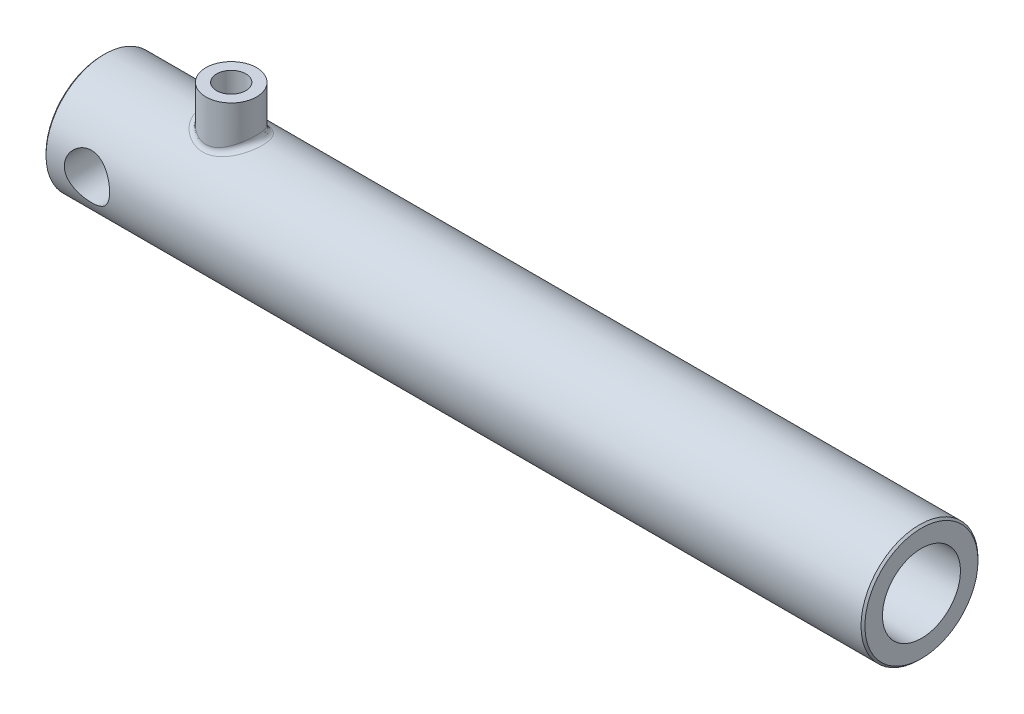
ISO-10303-21;
HEADER;
FILE_DESCRIPTION(('STEP AP214'),'2;1');
FILE_NAME('part.step','',(''),(''),'','','');
FILE_SCHEMA(('AUTOMOTIVE_DESIGN { 1 0 10303 214 1 1 1 1 }'));
ENDSEC;
DATA;
#1=APPLICATION_CONTEXT('core data for automotive mechanical design processes');
#2=APPLICATION_PROTOCOL_DEFINITION('international standard','automotive_design',2000,#1);
#3=PRODUCT_CONTEXT('',#1,'mechanical');
#4=PRODUCT('Part','Part','',(#3));
#5=PRODUCT_RELATED_PRODUCT_CATEGORY('part','',(#4));
#6=PRODUCT_DEFINITION_FORMATION('','',#4);
#7=PRODUCT_DEFINITION_CONTEXT('part definition',#1,'design');
#8=PRODUCT_DEFINITION('design','',#6,#7);
#9=PRODUCT_DEFINITION_SHAPE('','',#8);
#10=(LENGTH_UNIT() NAMED_UNIT(*) SI_UNIT(.MILLI.,.METRE.));
#11=(NAMED_UNIT(*) PLANE_ANGLE_UNIT() SI_UNIT($,.RADIAN.));
#12=(NAMED_UNIT(*) SI_UNIT($,.STERADIAN.) SOLID_ANGLE_UNIT());
#13=UNCERTAINTY_MEASURE_WITH_UNIT(LENGTH_MEASURE(1.E-05),#10,'distance_accuracy_value','');
#14=(GEOMETRIC_REPRESENTATION_CONTEXT(3) GLOBAL_UNCERTAINTY_ASSIGNED_CONTEXT((#13)) GLOBAL_UNIT_ASSIGNED_CONTEXT((#10,
#11,#12)) REPRESENTATION_CONTEXT('',''));
#15=CARTESIAN_POINT('',(0.,0.,0.));
#16=DIRECTION('',(0.,0.,1.));
#17=DIRECTION('',(1.,0.,0.));
#18=AXIS2_PLACEMENT_3D('',#15,#16,#17);
#19=CARTESIAN_POINT('',(320.,0.,0.));
#20=DIRECTION('',(-1.,0.,0.));
#21=DIRECTION('',(0.,0.,1.));
#22=AXIS2_PLACEMENT_3D('',#19,#20,#21);
#23=CYLINDRICAL_SURFACE('',#22,30.);
#24=CARTESIAN_POINT('',(-39.993595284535,26.7977398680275,-13.4863315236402));
#25=CARTESIAN_POINT('',(-39.2004137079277,27.5860929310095,-11.9198506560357));
#26=CARTESIAN_POINT('',(-38.8698065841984,29.477483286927,-12.0534220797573));
#27=CARTESIAN_POINT('',(-39.5681392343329,26.7190979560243,-13.6425965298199));
#28=CARTESIAN_POINT('',(-38.8379055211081,27.518264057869,-12.0773010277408));
#29=CARTESIAN_POINT('',(-38.5241228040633,29.3909772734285,-12.1930840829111));
#30=CARTESIAN_POINT('',(-39.13402769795,26.6468962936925,-13.7826762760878));
#31=CARTESIAN_POINT('',(-38.4647176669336,27.4552645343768,-12.2197453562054));
#32=CARTESIAN_POINT('',(-38.1714064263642,29.3115555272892,-12.3182804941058));
#33=CARTESIAN_POINT('',(-38.2515103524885,26.5181419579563,-14.0288089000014));
#34=CARTESIAN_POINT('',(-37.703483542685,27.3425800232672,-12.4703362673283));
#35=CARTESIAN_POINT('',(-37.4543595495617,29.1699259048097,-12.538261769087));
#36=CARTESIAN_POINT('',(-37.8031046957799,26.4615891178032,-14.134862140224));
#37=CARTESIAN_POINT('',(-37.3149859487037,27.2927441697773,-12.5788437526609));
#38=CARTESIAN_POINT('',(-37.0900291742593,29.1077178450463,-12.633046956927));
#39=CARTESIAN_POINT('',(-36.8961231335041,26.366543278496,-14.3113753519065));
#40=CARTESIAN_POINT('',(-36.5275665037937,27.2088772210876,-12.7594716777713));
#41=CARTESIAN_POINT('',(-36.3531050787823,29.0031675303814,-12.7908058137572));
#42=CARTESIAN_POINT('',(-36.4375591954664,26.328030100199,-14.3818751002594));
#43=CARTESIAN_POINT('',(-36.1281010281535,27.1747031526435,-12.8319118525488));
#44=CARTESIAN_POINT('',(-35.9805210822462,28.9608030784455,-12.8538150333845));
#45=CARTESIAN_POINT('',(-35.5139495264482,26.2706902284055,-14.4863534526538));
#46=CARTESIAN_POINT('',(-35.3228782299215,27.1238391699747,-12.9391763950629));
#47=CARTESIAN_POINT('',(-35.2300866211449,28.8977292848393,-12.9471926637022));
#48=CARTESIAN_POINT('',(-35.0489044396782,26.2518615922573,-14.5203356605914));
#49=CARTESIAN_POINT('',(-34.9164855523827,27.1070656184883,-12.9741789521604));
#50=CARTESIAN_POINT('',(-34.8522366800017,28.8770178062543,-12.9775642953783));
#51=CARTESIAN_POINT('',(-34.17153519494,26.2357504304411,-14.5494184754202));
#52=CARTESIAN_POINT('',(-34.150021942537,27.0927352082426,-13.0040890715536));
#53=CARTESIAN_POINT('',(-34.1393726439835,28.8592955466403,-13.0035570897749));
#54=CARTESIAN_POINT('',(-33.7594176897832,26.2362020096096,-14.5486080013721));
#55=CARTESIAN_POINT('',(-33.7896334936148,27.0931384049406,-13.0032528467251));
#56=CARTESIAN_POINT('',(-33.8045264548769,28.8597922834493,-13.0028327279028));
#57=CARTESIAN_POINT('',(-32.9369646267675,26.2530859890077,-14.5181194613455));
#58=CARTESIAN_POINT('',(-33.0712058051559,27.108153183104,-12.9719022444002));
#59=CARTESIAN_POINT('',(-33.1362819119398,28.878364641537,-12.9755835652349));
#60=CARTESIAN_POINT('',(-32.5266286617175,26.2695145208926,-14.4884483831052));
#61=CARTESIAN_POINT('',(-32.7127018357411,27.122780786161,-12.9413544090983));
#62=CARTESIAN_POINT('',(-32.8028832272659,28.896436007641,-12.9490650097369));
#63=CARTESIAN_POINT('',(-31.7108417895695,26.3177519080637,-14.4006396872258));
#64=CARTESIAN_POINT('',(-32.0013347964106,27.1655821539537,-12.8511885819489));
#65=CARTESIAN_POINT('',(-32.1400549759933,28.9494970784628,-12.8705859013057));
#66=CARTESIAN_POINT('',(-31.3053902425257,26.3495587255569,-14.3425058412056));
#67=CARTESIAN_POINT('',(-31.6480312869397,27.1938079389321,-12.7914600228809));
#68=CARTESIAN_POINT('',(-31.8106248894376,28.9844845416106,-12.8186287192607));
#69=CARTESIAN_POINT('',(-30.5019369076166,26.4274674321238,-14.1984386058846));
#70=CARTESIAN_POINT('',(-30.9498313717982,27.2626361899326,-12.6439244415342));
#71=CARTESIAN_POINT('',(-31.1578176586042,29.0701840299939,-12.6898684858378));
#72=CARTESIAN_POINT('',(-30.1039402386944,26.4735787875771,-14.1124868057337));
#73=CARTESIAN_POINT('',(-30.6045463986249,27.3033283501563,-12.5559191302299));
#74=CARTESIAN_POINT('',(-30.8344446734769,29.1209064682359,-12.6130489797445));
#75=CARTESIAN_POINT('',(-29.3302827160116,26.5769569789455,-13.9167955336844));
#76=CARTESIAN_POINT('',(-29.9357784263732,27.3940515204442,-12.3563496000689));
#77=CARTESIAN_POINT('',(-30.2058465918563,29.2346223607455,-12.4381497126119));
#78=CARTESIAN_POINT('',(-28.9543110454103,26.6338393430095,-13.8078643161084));
#79=CARTESIAN_POINT('',(-29.6115992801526,27.4438567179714,-12.2453606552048));
#80=CARTESIAN_POINT('',(-29.9003689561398,29.2971928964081,-12.340792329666));
#81=CARTESIAN_POINT('',(-28.2139186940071,26.757974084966,-13.5657408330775));
#82=CARTESIAN_POINT('',(-28.9758784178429,27.5518720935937,-11.9997383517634));
#83=CARTESIAN_POINT('',(-29.2987988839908,29.4337409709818,-12.1243942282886));
#84=CARTESIAN_POINT('',(-27.8495028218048,26.8252307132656,-13.4325386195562));
#85=CARTESIAN_POINT('',(-28.6641022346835,27.6101828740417,-11.8648501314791));
#86=CARTESIAN_POINT('',(-29.0027103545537,29.5077231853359,-12.0053446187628));
#87=CARTESIAN_POINT('',(-27.1339954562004,26.9683134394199,-13.1429125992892));
#88=CARTESIAN_POINT('',(-28.0550085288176,27.7333418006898,-11.5730252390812));
#89=CARTESIAN_POINT('',(-28.4213593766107,29.6651140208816,-11.7464910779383));
#90=CARTESIAN_POINT('',(-26.7829083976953,27.0441423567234,-12.9864811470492));
#91=CARTESIAN_POINT('',(-27.7575248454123,27.7982864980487,-11.4158161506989));
#92=CARTESIAN_POINT('',(-28.1361005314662,29.7485257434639,-11.6066803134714));
#93=CARTESIAN_POINT('',(-26.0956414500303,27.2024707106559,-12.6514784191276));
#94=CARTESIAN_POINT('',(-27.1785835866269,27.9327756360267,-11.0810613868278));
#95=CARTESIAN_POINT('',(-27.5776949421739,29.9226867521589,-11.3072712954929));
#96=CARTESIAN_POINT('',(-25.7594629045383,27.2849707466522,-12.4729051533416));
#97=CARTESIAN_POINT('',(-26.8970269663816,28.0024037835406,-10.9032425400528));
#98=CARTESIAN_POINT('',(-27.3045492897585,30.0134366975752,-11.1476712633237));
#99=CARTESIAN_POINT('',(-25.0683462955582,27.4637858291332,-12.0744804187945));
#100=CARTESIAN_POINT('',(-26.3218468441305,28.1519793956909,-10.5088779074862));
#101=CARTESIAN_POINT('',(-26.7430158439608,30.2101330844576,-10.7915787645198));
#102=CARTESIAN_POINT('',(-24.7152273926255,27.5606361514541,-11.8522579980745));
#103=CARTESIAN_POINT('',(-26.0303640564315,28.2322504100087,-10.2900670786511));
#104=CARTESIAN_POINT('',(-26.4561061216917,30.3166683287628,-10.5929672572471));
#105=CARTESIAN_POINT('',(-24.0307951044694,27.7575170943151,-11.3835316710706));
#106=CARTESIAN_POINT('',(-25.4702138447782,28.393516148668,-9.83229579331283));
#107=CARTESIAN_POINT('',(-25.9000036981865,30.533237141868,-10.1740426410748));
#108=CARTESIAN_POINT('',(-23.6994611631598,27.8575445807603,-11.1370512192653));
#109=CARTESIAN_POINT('',(-25.201581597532,28.474563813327,-9.59302855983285));
#110=CARTESIAN_POINT('',(-25.6307942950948,30.6432672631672,-9.95375049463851));
#111=CARTESIAN_POINT('',(-23.0594262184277,28.0584790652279,-10.6206669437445));
#112=CARTESIAN_POINT('',(-24.6876605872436,28.635244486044,-9.09631081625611));
#113=CARTESIAN_POINT('',(-25.1107647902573,30.8642949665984,-9.49223153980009));
#114=CARTESIAN_POINT('',(-22.7507464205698,28.1593867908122,-10.350741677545));
#115=CARTESIAN_POINT('',(-24.4425482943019,28.7148880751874,-8.83857551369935));
#116=CARTESIAN_POINT('',(-24.8599619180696,30.9752933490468,-9.25098556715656));
#117=CARTESIAN_POINT('',(-22.1577907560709,28.359600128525,-9.78887394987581));
#118=CARTESIAN_POINT('',(-23.9767548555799,28.8706302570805,-8.30747567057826));
#119=CARTESIAN_POINT('',(-24.3781844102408,31.1955277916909,-8.74881573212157));
#120=CARTESIAN_POINT('',(-21.8735219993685,28.4589052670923,-9.49692512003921));
#121=CARTESIAN_POINT('',(-23.7563166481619,28.9466981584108,-8.03391283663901));
#122=CARTESIAN_POINT('',(-24.1472155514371,31.30476333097,-8.4878861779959));
#123=CARTESIAN_POINT('',(-21.3089790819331,28.6614647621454,-8.8678233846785));
#124=CARTESIAN_POINT('',(-23.3234935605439,29.0994875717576,-7.45064210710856));
#125=CARTESIAN_POINT('',(-23.68852344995,31.5275785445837,-7.92562588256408));
#126=CARTESIAN_POINT('',(-21.0309066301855,28.764384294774,-8.52892499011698));
#127=CARTESIAN_POINT('',(-23.1137904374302,29.1756039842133,-7.13995684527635));
#128=CARTESIAN_POINT('',(-23.4625890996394,31.6407899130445,-7.62273510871));
#129=CARTESIAN_POINT('',(-20.5073006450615,28.9627465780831,-7.8288976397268));
#130=CARTESIAN_POINT('',(-22.7242376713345,29.3196646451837,-6.50637794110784));
#131=CARTESIAN_POINT('',(-23.0371583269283,31.8589881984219,-6.99708497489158));
#132=CARTESIAN_POINT('',(-20.2617656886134,29.0581896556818,-7.4677696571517));
#133=CARTESIAN_POINT('',(-22.5448368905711,29.3874757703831,-6.18351791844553));
#134=CARTESIAN_POINT('',(-22.8376607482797,31.9639754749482,-6.67432648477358));
#135=CARTESIAN_POINT('',(-19.8054042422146,29.2389040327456,-6.72549872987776));
#136=CARTESIAN_POINT('',(-22.2159933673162,29.5135019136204,-5.52862897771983));
#137=CARTESIAN_POINT('',(-22.4668662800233,32.1627610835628,-6.01092111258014));
#138=CARTESIAN_POINT('',(-19.5945685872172,29.324178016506,-6.3443611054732));
#139=CARTESIAN_POINT('',(-22.0670248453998,29.5715553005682,-5.19681018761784));
#140=CARTESIAN_POINT('',(-22.2955619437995,32.2565623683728,-5.67027898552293));
#141=CARTESIAN_POINT('',(-19.2096750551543,29.4821030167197,-5.56451420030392));
#142=CARTESIAN_POINT('',(-21.7986905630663,29.6771466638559,-4.52664913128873));
#143=CARTESIAN_POINT('',(-21.9828352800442,32.4302796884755,-4.97329004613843));
#144=CARTESIAN_POINT('',(-19.0356146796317,29.5547548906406,-5.16580611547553));
#145=CARTESIAN_POINT('',(-21.6797990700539,29.7245091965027,-4.18869750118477));
#146=CARTESIAN_POINT('',(-21.8414109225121,32.5101966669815,-4.61694430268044));
#147=CARTESIAN_POINT('',(-18.7339296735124,29.6820199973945,-4.37384337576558));
#148=CARTESIAN_POINT('',(-21.4761841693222,29.8061421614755,-3.52546631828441));
#149=CARTESIAN_POINT('',(-21.5962913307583,32.6501881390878,-3.90912682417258));
#150=CARTESIAN_POINT('',(-18.6044360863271,29.7373469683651,-3.98129208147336));
#151=CARTESIAN_POINT('',(-21.3904023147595,29.8408122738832,-3.20075072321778));
#152=CARTESIAN_POINT('',(-21.4910775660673,32.711047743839,-3.55828371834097));
#153=CARTESIAN_POINT('',(-18.3820278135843,29.8330410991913,-3.18591556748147));
#154=CARTESIAN_POINT('',(-21.2443392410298,29.9000660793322,-2.54891802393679));
#155=CARTESIAN_POINT('',(-21.3103704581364,32.8163111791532,-2.84741517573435));
#156=CARTESIAN_POINT('',(-18.2891120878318,29.8734086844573,-2.78309064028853));
#157=CARTESIAN_POINT('',(-21.1843591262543,29.9245292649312,-2.2224063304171));
#158=CARTESIAN_POINT('',(-21.2348762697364,32.860715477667,-2.48739000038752));
#159=CARTESIAN_POINT('',(-18.1410987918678,29.9379746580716,-1.97068919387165));
#160=CARTESIAN_POINT('',(-21.0892671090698,29.9633862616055,-1.56809514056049));
#161=CARTESIAN_POINT('',(-21.1146152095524,32.9317379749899,-1.76130540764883));
#162=CARTESIAN_POINT('',(-18.085979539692,29.9621823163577,-1.56111668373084));
#163=CARTESIAN_POINT('',(-21.0543518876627,29.9777000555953,-1.24099273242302));
#164=CARTESIAN_POINT('',(-21.069830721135,32.9583663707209,-1.39524957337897));
#165=CARTESIAN_POINT('',(-18.0142314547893,29.9937305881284,-0.738558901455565));
#166=CARTESIAN_POINT('',(-21.0088975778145,29.9963438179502,-0.58579919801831));
#167=CARTESIAN_POINT('',(-21.0115352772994,32.9930694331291,-0.660087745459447));
#168=CARTESIAN_POINT('',(-17.9975997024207,30.0010724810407,-0.325573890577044));
#169=CARTESIAN_POINT('',(-20.9984617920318,30.0006314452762,-0.25846138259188));
#170=CARTESIAN_POINT('',(-20.9980219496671,33.0011455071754,-0.29098198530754));
#171=CARTESIAN_POINT('',(-18.0027980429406,29.9987823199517,0.462709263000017));
#172=CARTESIAN_POINT('',(-21.001745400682,29.9992834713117,0.367263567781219));
#173=CARTESIAN_POINT('',(-21.0022456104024,32.9986263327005,0.413546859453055));
#174=CARTESIAN_POINT('',(-18.0212821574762,29.990626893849,0.838034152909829));
#175=CARTESIAN_POINT('',(-21.0133579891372,29.994513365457,0.664976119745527));
#176=CARTESIAN_POINT('',(-21.0172639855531,32.989655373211,0.748993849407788));
#177=CARTESIAN_POINT('',(-18.0900425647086,29.9603997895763,1.58568192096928));
#178=CARTESIAN_POINT('',(-21.0569375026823,29.9766406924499,1.26072694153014));
#179=CARTESIAN_POINT('',(-21.073131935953,32.9564055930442,1.41720477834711));
#180=CARTESIAN_POINT('',(-18.1403166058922,29.9383290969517,1.95800500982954));
#181=CARTESIAN_POINT('',(-21.0888197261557,29.9635728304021,1.55820058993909));
#182=CARTESIAN_POINT('',(-21.1139796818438,32.9321278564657,1.74996890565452));
#183=CARTESIAN_POINT('',(-18.2720875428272,29.8808235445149,2.69698986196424));
#184=CARTESIAN_POINT('',(-21.1734141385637,29.9289983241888,2.15303442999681));
#185=CARTESIAN_POINT('',(-21.2210437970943,32.8688718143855,2.41043734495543));
#186=CARTESIAN_POINT('',(-18.3535840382,29.8453888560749,3.06365169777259));
#187=CARTESIAN_POINT('',(-21.2259704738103,29.9075550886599,2.44986879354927));
#188=CARTESIAN_POINT('',(-21.2872598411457,32.8298936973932,2.73814172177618));
#189=CARTESIAN_POINT('',(-18.5469284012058,29.7620208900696,3.78884444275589));
#190=CARTESIAN_POINT('',(-21.3525305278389,29.856152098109,3.04264810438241));
#191=CARTESIAN_POINT('',(-21.4443524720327,32.7381890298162,3.38628345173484));
#192=CARTESIAN_POINT('',(-18.6587770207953,29.7140873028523,4.1473751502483));
#193=CARTESIAN_POINT('',(-21.4263163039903,29.8262797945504,3.33812839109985));
#194=CARTESIAN_POINT('',(-21.5352296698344,32.6854621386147,3.70672062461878));
#195=CARTESIAN_POINT('',(-18.9110824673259,29.6071256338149,4.85227477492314));
#196=CARTESIAN_POINT('',(-21.5955392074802,29.7582262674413,3.92554195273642));
#197=CARTESIAN_POINT('',(-21.7402282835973,32.5678044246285,4.33672535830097));
#198=CARTESIAN_POINT('',(-19.051393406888,29.5481542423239,5.19869555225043));
#199=CARTESIAN_POINT('',(-21.6905990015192,29.7201920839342,4.21709540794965));
#200=CARTESIAN_POINT('',(-21.8542311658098,32.502935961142,4.64633926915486));
#201=CARTESIAN_POINT('',(-19.3597634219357,29.4202762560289,5.87940015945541));
#202=CARTESIAN_POINT('',(-21.9031071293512,29.6359492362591,4.79669566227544));
#203=CARTESIAN_POINT('',(-22.1047823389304,32.3622703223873,5.25471968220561));
#204=CARTESIAN_POINT('',(-19.5278322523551,29.3513661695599,6.21367967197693));
#205=CARTESIAN_POINT('',(-22.0202684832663,29.5898489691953,5.08445431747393));
#206=CARTESIAN_POINT('',(-22.2413385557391,32.2864693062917,5.55348232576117));
#207=CARTESIAN_POINT('',(-19.8903287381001,29.2051366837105,6.86821520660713));
#208=CARTESIAN_POINT('',(-22.2772697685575,29.4899567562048,5.65451008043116));
#209=CARTESIAN_POINT('',(-22.535867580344,32.1256170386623,6.13847410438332));
#210=CARTESIAN_POINT('',(-20.0847513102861,29.1278189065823,7.18847391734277));
#211=CARTESIAN_POINT('',(-22.4167970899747,29.4362761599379,5.93661808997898));
#212=CARTESIAN_POINT('',(-22.6938362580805,32.0405675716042,6.42470564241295));
#213=CARTESIAN_POINT('',(-20.4986270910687,28.9663974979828,7.81359328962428));
#214=CARTESIAN_POINT('',(-22.7185846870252,29.3219987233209,6.49339598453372));
#215=CARTESIAN_POINT('',(-23.0301110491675,31.8630042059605,6.98340669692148));
#216=CARTESIAN_POINT('',(-20.7180893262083,28.8822914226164,8.11844834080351));
#217=CARTESIAN_POINT('',(-22.8805527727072,29.261497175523,6.76797478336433));
#218=CARTESIAN_POINT('',(-23.2084244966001,31.7704876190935,7.2558711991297));
#219=CARTESIAN_POINT('',(-21.4502224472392,28.6080506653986,9.05678838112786));
#220=CARTESIAN_POINT('',(-23.4260220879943,29.0616427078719,7.61724881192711));
#221=CARTESIAN_POINT('',(-23.8032839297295,31.4688230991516,8.09451353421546));
#222=CARTESIAN_POINT('',(-22.0068643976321,28.4084434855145,9.65979496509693));
#223=CARTESIAN_POINT('',(-23.8526374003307,28.9105907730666,8.17981074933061));
#224=CARTESIAN_POINT('',(-24.2555564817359,31.2492554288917,8.63345126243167));
#225=CARTESIAN_POINT('',(-23.2190386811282,28.0040194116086,10.7763013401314));
#226=CARTESIAN_POINT('',(-24.8088411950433,28.5943684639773,9.23856299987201));
#227=CARTESIAN_POINT('',(-25.2404501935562,30.8043894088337,9.63132993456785));
#228=CARTESIAN_POINT('',(-23.8746804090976,27.7991969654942,11.2897007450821));
#229=CARTESIAN_POINT('',(-25.3367338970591,28.4293682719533,9.73641026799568));
#230=CARTESIAN_POINT('',(-25.7731602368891,30.5790849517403,10.0901811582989));
#231=CARTESIAN_POINT('',(-24.948028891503,27.4962318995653,12.0012710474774));
#232=CARTESIAN_POINT('',(-26.2219330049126,28.1791073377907,10.4362646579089));
#233=CARTESIAN_POINT('',(-26.6452577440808,30.2458237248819,10.7261478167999));
#234=CARTESIAN_POINT('',(-25.3355348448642,27.3925626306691,12.2354158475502));
#235=CARTESIAN_POINT('',(-26.5430599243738,28.0927380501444,10.6675809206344));
#236=CARTESIAN_POINT('',(-26.9601070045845,30.1317876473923,10.9354149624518));
#237=CARTESIAN_POINT('',(-26.1332195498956,27.1929143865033,12.6729301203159));
#238=CARTESIAN_POINT('',(-27.2093742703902,27.92493993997,11.1018569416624));
#239=CARTESIAN_POINT('',(-27.6082272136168,29.9121748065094,11.3264437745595));
#240=CARTESIAN_POINT('',(-26.543388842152,27.0969322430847,12.8763123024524));
#241=CARTESIAN_POINT('',(-27.554638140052,27.843386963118,11.3052865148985));
#242=CARTESIAN_POINT('',(-27.9414904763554,29.806594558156,11.508216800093));
#243=CARTESIAN_POINT('',(-27.3832014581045,26.9161020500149,13.2501517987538));
#244=CARTESIAN_POINT('',(-28.2660059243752,27.6887115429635,11.6804887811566));
#245=CARTESIAN_POINT('',(-28.623839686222,29.6076815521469,11.8423362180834));
#246=CARTESIAN_POINT('',(-27.8128009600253,26.8312304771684,13.4206790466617));
#247=CARTESIAN_POINT('',(-28.632290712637,27.6154188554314,11.8527876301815));
#248=CARTESIAN_POINT('',(-28.9728900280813,29.5143229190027,11.9947451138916));
#249=CARTESIAN_POINT('',(-28.6893211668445,26.6755755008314,13.7274647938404));
#250=CARTESIAN_POINT('',(-29.3830996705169,27.4803854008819,12.16341925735));
#251=CARTESIAN_POINT('',(-29.6850642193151,29.3431026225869,12.2689351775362));
#252=CARTESIAN_POINT('',(-29.1362313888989,26.6047837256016,13.863743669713));
#253=CARTESIAN_POINT('',(-29.7679864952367,27.4184717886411,12.3022032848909));
#254=CARTESIAN_POINT('',(-30.0481795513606,29.2652317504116,12.3907345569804));
#255=CARTESIAN_POINT('',(-29.9788206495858,26.4890874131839,14.083371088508));
#256=CARTESIAN_POINT('',(-30.4961938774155,27.3169748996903,12.5261730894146));
#257=CARTESIAN_POINT('',(-30.7327847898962,29.1379659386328,12.5870267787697));
#258=CARTESIAN_POINT('',(-30.3726189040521,26.4419236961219,14.1715141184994));
#259=CARTESIAN_POINT('',(-30.8376381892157,27.275385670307,12.6163780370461));
#260=CARTESIAN_POINT('',(-31.0527465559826,29.0860859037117,12.6658046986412));
#261=CARTESIAN_POINT('',(-31.1681962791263,26.3614963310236,14.3205695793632));
#262=CARTESIAN_POINT('',(-31.5286564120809,27.2043764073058,12.7689624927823));
#263=CARTESIAN_POINT('',(-31.6991545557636,28.9976158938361,12.7990231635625));
#264=CARTESIAN_POINT('',(-31.5699766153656,26.3282348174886,14.3814778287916));
#265=CARTESIAN_POINT('',(-31.8786114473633,27.174876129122,12.8315197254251));
#266=CARTESIAN_POINT('',(-32.0256017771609,28.9610282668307,12.8534599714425));
#267=CARTESIAN_POINT('',(-32.376191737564,26.2769202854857,14.4750232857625));
#268=CARTESIAN_POINT('',(-32.5814127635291,27.1293621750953,12.9275535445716));
#269=CARTESIAN_POINT('',(-32.6806529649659,28.9045823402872,12.9370663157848));
#270=CARTESIAN_POINT('',(-32.7805957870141,26.2587765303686,14.5078291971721));
#271=CARTESIAN_POINT('',(-32.9346438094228,27.1132128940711,12.9613213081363));
#272=CARTESIAN_POINT('',(-33.0092319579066,28.8846242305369,12.9663866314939));
#273=CARTESIAN_POINT('',(-33.5916009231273,26.2379924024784,14.5453849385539));
#274=CARTESIAN_POINT('',(-33.642978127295,27.0947334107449,12.9999338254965));
#275=CARTESIAN_POINT('',(-33.6681750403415,28.8617617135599,12.9999521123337));
#276=CARTESIAN_POINT('',(-33.9982026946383,26.2353571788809,14.5501254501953));
#277=CARTESIAN_POINT('',(-33.9985263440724,27.0923845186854,13.0048176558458));
#278=CARTESIAN_POINT('',(-33.9985396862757,28.8588629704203,13.004188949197));
#279=CARTESIAN_POINT('',(-34.8108601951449,26.2457046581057,14.5314520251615));
#280=CARTESIAN_POINT('',(-34.7085000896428,27.1015878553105,12.9856145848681));
#281=CARTESIAN_POINT('',(-34.6588253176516,28.8702451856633,12.9874995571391));
#282=CARTESIAN_POINT('',(-35.2169147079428,26.2587058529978,14.5080047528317));
#283=CARTESIAN_POINT('',(-35.0633731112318,27.1131682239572,12.9614690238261));
#284=CARTESIAN_POINT('',(-34.9887453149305,28.8845464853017,12.966543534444));
#285=CARTESIAN_POINT('',(-36.0249165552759,26.2998938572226,14.4332045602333));
#286=CARTESIAN_POINT('',(-35.7683122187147,27.1497384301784,12.8846298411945));
#287=CARTESIAN_POINT('',(-35.6452482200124,28.9298532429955,12.8996907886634));
#288=CARTESIAN_POINT('',(-36.4268641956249,26.3280795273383,14.3818537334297));
#289=CARTESIAN_POINT('',(-36.1188096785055,27.1747725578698,12.831842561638));
#290=CARTESIAN_POINT('',(-35.9718313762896,28.9608574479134,12.8537959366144));
#291=CARTESIAN_POINT('',(-37.2225751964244,26.3985543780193,14.2520785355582));
#292=CARTESIAN_POINT('',(-36.8109177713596,27.237105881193,12.6988475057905));
#293=CARTESIAN_POINT('',(-36.6183479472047,29.0383797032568,12.7378092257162));
#294=CARTESIAN_POINT('',(-37.6163603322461,26.4407988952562,14.1737398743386));
#295=CARTESIAN_POINT('',(-37.1529448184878,27.2744392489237,12.6185671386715));
#296=CARTESIAN_POINT('',(-36.9382990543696,29.0848486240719,12.6677939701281));
#297=CARTESIAN_POINT('',(-38.3945208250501,26.5380414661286,13.9908207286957));
#298=CARTESIAN_POINT('',(-37.8266013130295,27.3599363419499,12.4318025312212));
#299=CARTESIAN_POINT('',(-37.570555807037,29.1918153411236,12.5043098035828));
#300=CARTESIAN_POINT('',(-38.7788959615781,26.5930398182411,13.8862396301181));
#301=CARTESIAN_POINT('',(-38.158563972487,27.4081921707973,12.325106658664));
#302=CARTESIAN_POINT('',(-37.8828612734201,29.2523134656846,12.4108403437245));
#303=CARTESIAN_POINT('',(-39.5359947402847,26.7141120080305,13.6518714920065));
#304=CARTESIAN_POINT('',(-38.8097557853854,27.5137730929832,12.0870276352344));
#305=CARTESIAN_POINT('',(-38.4980053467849,29.3854927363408,12.201373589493));
#306=CARTESIAN_POINT('',(-39.9087194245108,26.7801848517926,13.5220867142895));
#307=CARTESIAN_POINT('',(-39.1292537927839,27.5711984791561,11.9553967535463));
#308=CARTESIAN_POINT('',(-38.8008448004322,29.4581727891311,12.0853783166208));
#309=CARTESIAN_POINT('',(-40.6408205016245,26.9215744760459,13.2383513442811));
#310=CARTESIAN_POINT('',(-39.7537351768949,27.6932110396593,11.6690504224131));
#311=CARTESIAN_POINT('',(-39.3956781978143,29.6137012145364,11.8317895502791));
#312=CARTESIAN_POINT('',(-41.0001915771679,26.9968948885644,13.0843912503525));
#313=CARTESIAN_POINT('',(-40.0589073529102,27.7579011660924,11.5140518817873));
#314=CARTESIAN_POINT('',(-39.6876678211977,29.6965535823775,11.694187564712));
#315=CARTESIAN_POINT('',(-41.721715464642,27.1588107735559,12.7450421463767));
#316=CARTESIAN_POINT('',(-40.6681981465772,27.8958567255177,11.1742818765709));
#317=CARTESIAN_POINT('',(-40.2739072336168,29.8746608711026,11.3908939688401));
#318=CARTESIAN_POINT('',(-42.0830829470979,27.2457845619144,12.5584542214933));
#319=CARTESIAN_POINT('',(-40.9714975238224,27.9694669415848,10.9881406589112));
#320=CARTESIAN_POINT('',(-40.5675189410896,29.970331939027,11.2241308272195));
#321=CARTESIAN_POINT('',(-42.787563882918,27.4254459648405,12.1611038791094));
#322=CARTESIAN_POINT('',(-41.558620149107,28.1200318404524,10.5944388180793));
#323=CARTESIAN_POINT('',(-41.139910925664,30.1679592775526,10.8689985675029));
#324=CARTESIAN_POINT('',(-43.1306759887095,27.5181340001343,11.9503396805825));
#325=CARTESIAN_POINT('',(-41.8424901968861,28.1970692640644,10.3865543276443));
#326=CARTESIAN_POINT('',(-41.4186901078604,30.2699160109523,10.6806278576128));
#327=CARTESIAN_POINT('',(-43.7973227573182,27.7069661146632,11.5057537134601));
#328=CARTESIAN_POINT('',(-42.3895955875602,28.3522816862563,9.95140202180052));
#329=CARTESIAN_POINT('',(-41.9603417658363,30.477631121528,10.2832787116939));
#330=CARTESIAN_POINT('',(-44.1208493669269,27.8031115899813,11.2719225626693));
#331=CARTESIAN_POINT('',(-42.6527822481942,28.4305098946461,9.72382979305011));
#332=CARTESIAN_POINT('',(-42.2232076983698,30.5833910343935,10.0742918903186));
#333=CARTESIAN_POINT('',(-44.7468232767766,27.9965812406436,10.7824257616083));
#334=CARTESIAN_POINT('',(-43.157376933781,28.5859835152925,9.25151023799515));
#335=CARTESIAN_POINT('',(-42.7318125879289,30.7962074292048,9.63680364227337));
#336=CARTESIAN_POINT('',(-45.0492690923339,28.0939054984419,10.5267585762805));
#337=CARTESIAN_POINT('',(-43.3986619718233,28.6632473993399,9.00650838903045));
#338=CARTESIAN_POINT('',(-42.9775503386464,30.9032640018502,9.40830084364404));
#339=CARTESIAN_POINT('',(-45.6633899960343,28.2980766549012,9.96580809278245));
#340=CARTESIAN_POINT('',(-43.8838870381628,28.8232095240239,8.47375732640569));
#341=CARTESIAN_POINT('',(-43.4765246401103,31.1278520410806,8.90695079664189));
#342=CARTESIAN_POINT('',(-45.9724959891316,28.4048089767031,9.65815227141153));
#343=CARTESIAN_POINT('',(-44.1247190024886,28.9054657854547,8.1843301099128));
#344=CARTESIAN_POINT('',(-43.7276737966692,31.2452574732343,8.63198310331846));
#345=CARTESIAN_POINT('',(-46.5611256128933,28.6141243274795,9.01913995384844));
#346=CARTESIAN_POINT('',(-44.5776848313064,29.0641107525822,7.59016688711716));
#347=CARTESIAN_POINT('',(-44.2059363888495,31.4755041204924,8.06086521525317));
#348=CARTESIAN_POINT('',(-46.8406586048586,28.7167086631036,8.68779101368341));
#349=CARTESIAN_POINT('',(-44.7894702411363,29.1404242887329,7.28529468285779));
#350=CARTESIAN_POINT('',(-44.4330574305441,31.5883467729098,7.764721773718));
#351=CARTESIAN_POINT('',(-47.3684194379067,28.9150623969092,8.0028939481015));
#352=CARTESIAN_POINT('',(-45.1840429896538,29.285375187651,6.66297756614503));
#353=CARTESIAN_POINT('',(-44.8618640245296,31.8065356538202,7.1525943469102));
#354=CARTESIAN_POINT('',(-47.6166322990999,29.0108285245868,7.64933532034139));
#355=CARTESIAN_POINT('',(-45.3663887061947,29.3538857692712,6.34553467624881));
#356=CARTESIAN_POINT('',(-45.0635374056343,31.9118782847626,6.83660097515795));
#357=CARTESIAN_POINT('',(-48.0794326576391,29.1928311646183,6.92234951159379));
#358=CARTESIAN_POINT('',(-45.7017355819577,29.4817128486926,5.70127408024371));
#359=CARTESIAN_POINT('',(-45.4395635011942,32.1120809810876,6.18685669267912));
#360=CARTESIAN_POINT('',(-48.2940362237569,29.279072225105,6.54893194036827));
#361=CARTESIAN_POINT('',(-45.8542882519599,29.5408791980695,5.37463104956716));
#362=CARTESIAN_POINT('',(-45.6139292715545,32.206946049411,5.85311437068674));
#363=CARTESIAN_POINT('',(-48.6853575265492,29.4386954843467,5.78896808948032));
#364=CARTESIAN_POINT('',(-46.1287349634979,29.6484240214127,4.71845308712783));
#365=CARTESIAN_POINT('',(-45.9318785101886,32.3825314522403,5.17389593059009));
#366=CARTESIAN_POINT('',(-48.862494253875,29.5122180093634,5.40262994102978));
#367=CARTESIAN_POINT('',(-46.2505363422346,29.6967636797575,4.38929536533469));
#368=CARTESIAN_POINT('',(-46.0758024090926,32.4634061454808,4.8286058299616));
#369=CARTESIAN_POINT('',(-49.1801380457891,29.6455335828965,4.61537517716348));
#370=CARTESIAN_POINT('',(-46.4663506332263,29.7830048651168,3.72649764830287));
#371=CARTESIAN_POINT('',(-46.3338885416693,32.6100531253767,4.12499610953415));
#372=CARTESIAN_POINT('',(-49.3206449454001,29.7053265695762,4.21445849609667));
#373=CARTESIAN_POINT('',(-46.5599507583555,29.8207471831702,3.39335108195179));
#374=CARTESIAN_POINT('',(-46.4480506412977,32.6758253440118,3.7666764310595));
#375=CARTESIAN_POINT('',(-49.5632250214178,29.8093612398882,3.40144165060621));
#376=CARTESIAN_POINT('',(-46.7200339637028,29.8855695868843,2.72450145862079));
#377=CARTESIAN_POINT('',(-46.6451473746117,32.7902633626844,3.04004182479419));
#378=CARTESIAN_POINT('',(-49.6653249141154,29.8536137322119,2.9893494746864));
#379=CARTESIAN_POINT('',(-46.7861933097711,29.9125205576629,2.38943219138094));
#380=CARTESIAN_POINT('',(-46.7281037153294,32.8389410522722,2.67173403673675));
#381=CARTESIAN_POINT('',(-49.8298491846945,29.9252508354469,2.15723687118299));
#382=CARTESIAN_POINT('',(-46.892220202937,29.9558063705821,1.71761833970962));
#383=CARTESIAN_POINT('',(-46.8617799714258,32.9177417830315,1.92803257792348));
#384=CARTESIAN_POINT('',(-49.8922776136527,29.952637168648,1.73721725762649));
#385=CARTESIAN_POINT('',(-46.9318444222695,29.9720424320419,1.38161608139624));
#386=CARTESIAN_POINT('',(-46.9125031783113,32.9478667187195,1.55263963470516));
#387=CARTESIAN_POINT('',(-49.9725894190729,29.9879263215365,0.933070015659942));
#388=CARTESIAN_POINT('',(-46.9827798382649,29.9929278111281,0.74047970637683));
#389=CARTESIAN_POINT('',(-46.9777566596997,32.9866847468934,0.83393224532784));
#390=CARTESIAN_POINT('',(-49.9941317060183,29.9974287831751,0.54931066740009));
#391=CARTESIAN_POINT('',(-46.9963199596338,29.9984890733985,0.435999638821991));
#392=CARTESIAN_POINT('',(-46.9952598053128,32.9971374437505,0.490946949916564));
#393=CARTESIAN_POINT('',(-50.0037322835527,30.0016599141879,-0.218621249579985));
#394=CARTESIAN_POINT('',(-47.0023768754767,30.0009758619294,-0.173596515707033));
#395=CARTESIAN_POINT('',(-47.0030602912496,33.0017916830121,-0.195392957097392));
#396=CARTESIAN_POINT('',(-49.9917929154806,29.9963896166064,-0.602793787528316));
#397=CARTESIAN_POINT('',(-46.9948828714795,29.9978969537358,-0.478093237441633));
#398=CARTESIAN_POINT('',(-46.9933595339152,32.9959943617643,-0.538747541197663));
#399=CARTESIAN_POINT('',(-49.9345815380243,29.9712170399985,-1.36853872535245));
#400=CARTESIAN_POINT('',(-46.9586812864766,29.9830441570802,-1.08747144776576));
#401=CARTESIAN_POINT('',(-46.9468751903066,32.9683045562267,-1.22313283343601));
#402=CARTESIAN_POINT('',(-49.8893139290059,29.9513166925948,-1.75011146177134));
#403=CARTESIAN_POINT('',(-46.9300491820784,29.9713012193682,-1.39174357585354));
#404=CARTESIAN_POINT('',(-46.9100951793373,32.9464141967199,-1.56416384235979));
#405=CARTESIAN_POINT('',(-49.765989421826,29.8974083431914,-2.50783541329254));
#406=CARTESIAN_POINT('',(-46.851100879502,29.9390083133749,-2.00030279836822));
#407=CARTESIAN_POINT('',(-46.8098938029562,32.8871150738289,-2.24138037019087));
#408=CARTESIAN_POINT('',(-49.687932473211,29.8634003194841,-2.88398662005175));
#409=CARTESIAN_POINT('',(-46.8009378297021,29.9185207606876,-2.3040181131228));
#410=CARTESIAN_POINT('',(-46.7464723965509,32.8497062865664,-2.57756588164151));
#411=CARTESIAN_POINT('',(-49.5033905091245,29.7836531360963,-3.6144133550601));
#412=CARTESIAN_POINT('',(-46.6805372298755,29.8695611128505,-2.89952623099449));
#413=CARTESIAN_POINT('',(-46.5965317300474,32.7619844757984,-3.23038549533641));
#414=CARTESIAN_POINT('',(-49.3980615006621,29.7383934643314,-3.96898379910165));
#415=CARTESIAN_POINT('',(-46.6113245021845,29.8414984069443,-3.19082471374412));
#416=CARTESIAN_POINT('',(-46.5109517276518,32.7121988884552,-3.5472831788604));
#417=CARTESIAN_POINT('',(-49.1588012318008,29.636630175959,-4.66852554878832));
#418=CARTESIAN_POINT('',(-46.4515637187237,29.7771220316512,-3.77171878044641));
#419=CARTESIAN_POINT('',(-46.3165523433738,32.6002593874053,-4.17249930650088));
#420=CARTESIAN_POINT('',(-49.0248600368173,29.5801226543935,-5.01349347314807));
#421=CARTESIAN_POINT('',(-46.3612570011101,29.7409034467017,-4.06093237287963));
#422=CARTESIAN_POINT('',(-46.207724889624,32.5381011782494,-4.48081472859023));
#423=CARTESIAN_POINT('',(-48.7296245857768,29.4571498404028,-5.69166679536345));
#424=CARTESIAN_POINT('',(-46.1588282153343,29.6604158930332,-4.6360546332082));
#425=CARTESIAN_POINT('',(-45.9678455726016,32.4028312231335,-5.08693280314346));
#426=CARTESIAN_POINT('',(-48.5683368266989,29.3906869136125,-6.02487496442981));
#427=CARTESIAN_POINT('',(-46.0469934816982,29.6162561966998,-4.92166772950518));
#428=CARTESIAN_POINT('',(-45.8367989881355,32.3297220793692,-5.38473793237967));
#429=CARTESIAN_POINT('',(-48.2196072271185,29.2491980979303,-6.67803359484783));
#430=CARTESIAN_POINT('',(-45.8011091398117,29.5202793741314,-5.4880378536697));
#431=CARTESIAN_POINT('',(-45.5534555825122,32.1740845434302,-5.96849910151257));
#432=CARTESIAN_POINT('',(-48.0321552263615,29.1741688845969,-6.99797884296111));
#433=CARTESIAN_POINT('',(-45.6673482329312,29.4685665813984,-5.76859169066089));
#434=CARTESIAN_POINT('',(-45.4011505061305,32.0915524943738,-6.25445048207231));
#435=CARTESIAN_POINT('',(-47.6196791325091,29.0121068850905,-7.6429820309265));
#436=CARTESIAN_POINT('',(-45.3683382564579,29.3546727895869,-6.34036340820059));
#437=CARTESIAN_POINT('',(-45.0660129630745,31.9132844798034,-6.83092271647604));
#438=CARTESIAN_POINT('',(-47.3930194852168,28.9246134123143,-7.96705999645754));
#439=CARTESIAN_POINT('',(-45.2018736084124,29.2921129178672,-6.63117312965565));
#440=CARTESIAN_POINT('',(-44.8818516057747,31.8170417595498,-7.12056771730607));
#441=CARTESIAN_POINT('',(-46.9131357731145,28.7436993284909,-8.59692822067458));
#442=CARTESIAN_POINT('',(-44.8437688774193,29.1602201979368,-7.20263096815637));
#443=CARTESIAN_POINT('',(-44.4919452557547,31.6180364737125,-7.68351306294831));
#444=CARTESIAN_POINT('',(-46.6599025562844,28.6502766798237,-8.9027121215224));
#445=CARTESIAN_POINT('',(-44.6524498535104,29.0909808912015,-7.48326434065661));
#446=CARTESIAN_POINT('',(-44.2861928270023,31.5152716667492,-7.95680772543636));
#447=CARTESIAN_POINT('',(-46.128350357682,28.4596001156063,-9.49462389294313));
#448=CARTESIAN_POINT('',(-44.2450492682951,28.9471949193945,-8.03186781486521));
#449=CARTESIAN_POINT('',(-43.8543057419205,31.3055276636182,-8.48582945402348));
#450=CARTESIAN_POINT('',(-45.8500215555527,28.3623447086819,-9.78074399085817));
#451=CARTESIAN_POINT('',(-44.0292419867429,28.8727108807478,-8.29992670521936));
#452=CARTESIAN_POINT('',(-43.628163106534,31.1985468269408,-8.74154957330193));
#453=CARTESIAN_POINT('',(-45.2698186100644,28.1662290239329,-10.3319473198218));
#454=CARTESIAN_POINT('',(-43.5736405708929,28.7202298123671,-8.82078717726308));
#455=CARTESIAN_POINT('',(-43.1567472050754,30.982819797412,-9.23418809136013));
#456=CARTESIAN_POINT('',(-44.9679429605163,28.0673686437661,-10.5970292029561));
#457=CARTESIAN_POINT('',(-43.3340667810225,28.6422607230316,-9.07376984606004));
#458=CARTESIAN_POINT('',(-42.9114727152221,30.8740734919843,-9.47110528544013));
#459=CARTESIAN_POINT('',(-44.3139262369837,27.8614560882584,-11.1277760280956));
#460=CARTESIAN_POINT('',(-42.809539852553,28.4778246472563,-9.58377435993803));
#461=CARTESIAN_POINT('',(-42.3800829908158,30.647569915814,-9.94546078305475));
#462=CARTESIAN_POINT('',(-43.9597059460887,27.7544661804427,-11.3913523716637));
#463=CARTESIAN_POINT('',(-42.5223697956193,28.3911306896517,-9.83967675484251));
#464=CARTESIAN_POINT('',(-42.0922783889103,30.5298811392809,-10.1810323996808));
#465=CARTESIAN_POINT('',(-43.2269609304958,27.5443554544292,-11.8904071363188));
#466=CARTESIAN_POINT('',(-41.9223276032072,28.2189020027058,-10.3272960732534));
#467=CARTESIAN_POINT('',(-41.4969217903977,30.2987595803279,-10.6270630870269));
#468=CARTESIAN_POINT('',(-42.8484442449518,27.4412333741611,-12.125894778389));
#469=CARTESIAN_POINT('',(-41.609533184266,28.1333009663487,-10.5594177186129));
#470=CARTESIAN_POINT('',(-41.189376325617,30.1853254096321,-10.8375303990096));
#471=CARTESIAN_POINT('',(-42.0687370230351,27.2418798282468,-12.5673660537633));
#472=CARTESIAN_POINT('',(-40.9599196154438,27.9662993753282,-10.9967264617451));
#473=CARTESIAN_POINT('',(-40.5558628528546,29.9660367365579,-11.23209578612));
#474=CARTESIAN_POINT('',(-41.6675350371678,27.1456518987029,-12.7733345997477));
#475=CARTESIAN_POINT('',(-40.6230236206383,27.8847890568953,-11.2023392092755));
#476=CARTESIAN_POINT('',(-40.2298855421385,29.8601861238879,-11.4161803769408));
#477=CARTESIAN_POINT('',(-40.8450293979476,26.9633383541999,-13.1538166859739));
#478=CARTESIAN_POINT('',(-39.9278751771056,27.7292834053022,-11.5835308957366));
#479=CARTESIAN_POINT('',(-39.5615982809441,29.6596414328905,-11.7562366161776));
#480=CARTESIAN_POINT('',(-40.4237359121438,26.8772476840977,-13.3283459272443));
#481=CARTESIAN_POINT('',(-39.5694344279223,27.655140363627,-11.7595716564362));
#482=CARTESIAN_POINT('',(-39.2192965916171,29.5649417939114,-11.9122222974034));
#483=CARTESIAN_POINT('',(-39.993595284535,26.7977398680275,-13.4863315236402));
#484=CARTESIAN_POINT('',(-39.2004137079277,27.5860929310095,-11.9198506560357));
#485=CARTESIAN_POINT('',(-38.8698065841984,29.477483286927,-12.0534220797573));
#486=(BOUNDED_SURFACE() B_SPLINE_SURFACE(3,2,((#24,#25,#26),(#27,#28,#29),(#30,#31,#32),(#33,
#34,#35),(#36,#37,#38),(#39,#40,#41),(#42,#43,#44),(#45,#46,#47),(#48,#49,#50),(#51,#52,#53),
(#54,#55,#56),(#57,#58,#59),(#60,#61,#62),(#63,#64,#65),(#66,#67,#68),(#69,#70,#71),(#72,#73,
#74),(#75,#76,#77),(#78,#79,#80),(#81,#82,#83),(#84,#85,#86),(#87,#88,#89),(#90,#91,#92),(#93,
#94,#95),(#96,#97,#98),(#99,#100,#101),(#102,#103,#104),(#105,#106,#107),(#108,#109,#110),(#111,
#112,#113),(#114,#115,#116),(#117,#118,#119),(#120,#121,#122),(#123,#124,#125),(#126,#127,#128),
(#129,#130,#131),(#132,#133,#134),(#135,#136,#137),(#138,#139,#140),(#141,#142,#143),(#144,#145,
#146),(#147,#148,#149),(#150,#151,#152),(#153,#154,#155),(#156,#157,#158),(#159,#160,#161),
(#162,#163,#164),(#165,#166,#167),(#168,#169,#170),(#171,#172,#173),(#174,#175,#176),(#177,#178,
#179),(#180,#181,#182),(#183,#184,#185),(#186,#187,#188),(#189,#190,#191),(#192,#193,#194),
(#195,#196,#197),(#198,#199,#200),(#201,#202,#203),(#204,#205,#206),(#207,#208,#209),(#210,#211,
#212),(#213,#214,#215),(#216,#217,#218),(#219,#220,#221),(#222,#223,#224),(#225,#226,#227),
(#228,#229,#230),(#231,#232,#233),(#234,#235,#236),(#237,#238,#239),(#240,#241,#242),(#243,#244,
#245),(#246,#247,#248),(#249,#250,#251),(#252,#253,#254),(#255,#256,#257),(#258,#259,#260),
(#261,#262,#263),(#264,#265,#266),(#267,#268,#269),(#270,#271,#272),(#273,#274,#275),(#276,#277,
#278),(#279,#280,#281),(#282,#283,#284),(#285,#286,#287),(#288,#289,#290),(#291,#292,#293),
(#294,#295,#296),(#297,#298,#299),(#300,#301,#302),(#303,#304,#305),(#306,#307,#308),(#309,#310,
#311),(#312,#313,#314),(#315,#316,#317),(#318,#319,#320),(#321,#322,#323),(#324,#325,#326),
(#327,#328,#329),(#330,#331,#332),(#333,#334,#335),(#336,#337,#338),(#339,#340,#341),(#342,#343,
#344),(#345,#346,#347),(#348,#349,#350),(#351,#352,#353),(#354,#355,#356),(#357,#358,#359),
(#360,#361,#362),(#363,#364,#365),(#366,#367,#368),(#369,#370,#371),(#372,#373,#374),(#375,#376,
#377),(#378,#379,#380),(#381,#382,#383),(#384,#385,#386),(#387,#388,#389),(#390,#391,#392),
(#393,#394,#395),(#396,#397,#398),(#399,#400,#401),(#402,#403,#404),(#405,#406,#407),(#408,#409,
#410),(#411,#412,#413),(#414,#415,#416),(#417,#418,#419),(#420,#421,#422),(#423,#424,#425),
(#426,#427,#428),(#429,#430,#431),(#432,#433,#434),(#435,#436,#437),(#438,#439,#440),(#441,#442,
#443),(#444,#445,#446),(#447,#448,#449),(#450,#451,#452),(#453,#454,#455),(#456,#457,#458),
(#459,#460,#461),(#462,#463,#464),(#465,#466,#467),(#468,#469,#470),(#471,#472,#473),(#474,#475,
#476),(#477,#478,#479),(#480,#481,#482),(#483,#484,#485)),.UNSPECIFIED.,.T.,.F.,
.F.) B_SPLINE_SURFACE_WITH_KNOTS((4,2,2,2,2,2,2,2,2,2,2,2,2,2,2,2,2,2,2,2,2,2,2,2,2,2,2,2,2,2,2,
2,2,2,2,2,2,2,2,2,2,2,2,2,2,2,2,2,2,2,2,2,2,2,2,2,2,2,2,2,2,2,2,2,2,2,2,2,2,2,2,2,2,2,2,2,4),(3,
3),(0.,1.40037435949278,2.80073379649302,4.19952303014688,5.59817420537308,6.83295912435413,
8.06744515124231,9.30176763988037,10.5369087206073,11.7342600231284,12.9321031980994,
14.1303414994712,15.3286875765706,16.65474880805,17.9795402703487,19.305556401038,
20.6319574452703,22.0661425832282,23.5002649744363,24.9340079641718,26.367653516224,
27.730486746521,29.0932812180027,30.4552932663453,31.8172019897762,33.0558042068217,
34.2943187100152,35.532817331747,36.7713466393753,38.0036812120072,39.236449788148,
40.4689809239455,41.7019577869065,44.3699798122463,47.0409718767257,48.4766311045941,
49.9116955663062,51.3436708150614,52.774792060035,53.9999992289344,55.2253944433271,
56.4433807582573,57.6617714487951,58.8816044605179,60.101345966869,61.3172489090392,
62.5331803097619,63.7490026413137,64.9653040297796,66.2433659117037,67.521522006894,
68.8002001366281,70.0789682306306,71.4967092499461,72.9140001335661,74.3319663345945,
75.7492525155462,77.1497361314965,78.5502260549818,79.9497399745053,81.3491109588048,
82.6159462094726,83.8826928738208,85.1492723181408,86.4158537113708,87.6356712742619,
88.8559130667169,90.0758653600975,91.2962927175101,92.5947146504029,93.8935852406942,
95.1929663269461,96.4924305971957,97.9086786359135,99.3244604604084,100.740963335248,
102.156756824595),(0.,1.),
.UNSPECIFIED.) GEOMETRIC_REPRESENTATION_ITEM() RATIONAL_B_SPLINE_SURFACE(((1.,0.841668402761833,
1.),(1.,0.844537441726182,1.),(1.,0.847144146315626,1.),(1.,0.851760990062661,1.),(1.,
0.853771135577,1.),(1.,0.857133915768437,1.),(1.,0.85848728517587,1.),(1.,0.860497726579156,1.),
(1.,0.861154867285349,1.),(1.,0.86171721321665,1.),(1.,0.861701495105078,1.),(1.,
0.861112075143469,1.),(1.,0.860538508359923,1.),(1.,0.8588479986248,1.),(1.,0.857731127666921,
1.),(1.,0.854980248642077,1.),(1.,0.853345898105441,1.),(1.,0.849655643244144,1.),(1.,
0.847614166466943,1.),(1.,0.843122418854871,1.),(1.,0.840671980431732,1.),(1.,0.835410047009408,
1.),(1.,0.832598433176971,1.),(1.,0.826667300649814,1.),(1.,0.82354775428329,1.),(1.,
0.81671135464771,1.),(1.,0.812966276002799,1.),(1.,0.805254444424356,1.),(1.,0.801287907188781,
1.),(1.,0.793213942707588,1.),(1.,0.789106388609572,1.),(1.,0.780847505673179,1.),(1.,
0.776696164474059,1.),(1.,0.76811714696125,1.),(1.,0.763694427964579,1.),(1.,0.755055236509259,
1.),(1.,0.750838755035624,1.),(1.,0.74275659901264,1.),(1.,0.738890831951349,1.),(1.,
0.731654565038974,1.),(1.,0.728284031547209,1.),(1.,0.722328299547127,1.),(1.,0.719712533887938,
1.),(1.,0.71516036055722,1.),(1.,0.713223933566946,1.),(1.,0.710115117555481,1.),(1.,
0.708942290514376,1.),(1.,0.707412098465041,1.),(1.,0.707054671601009,1.),(1.,0.707165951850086,
1.),(1.,0.70756279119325,1.),(1.,0.709028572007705,1.),(1.,0.71009746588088,1.),(1.,
0.712867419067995,1.),(1.,0.714568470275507,1.),(1.,0.71854164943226,1.),(1.,0.720813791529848,
1.),(1.,0.725839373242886,1.),(1.,0.72859034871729,1.),(1.,0.734495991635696,1.),(1.,
0.737650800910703,1.),(1.,0.744271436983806,1.),(1.,0.747737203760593,1.),(1.,0.754888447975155,
1.),(1.,0.758574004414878,1.),(1.,0.770442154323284,1.),(1.,0.778866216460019,1.),(1.,
0.795471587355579,1.),(1.,0.803652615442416,1.),(1.,0.815464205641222,1.),(1.,0.819449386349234,
1.),(1.,0.827033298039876,1.),(1.,0.830632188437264,1.),(1.,0.837341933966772,1.),(1.,
0.840453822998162,1.),(1.,0.846112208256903,1.),(1.,0.848659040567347,1.),(1.,0.852794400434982,
1.),(1.,0.854468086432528,1.),(1.,0.857310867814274,1.),(1.,0.858479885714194,1.),(1.,
0.860279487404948,1.),(1.,0.860913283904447,1.),(1.,0.861639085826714,1.),(1.,0.861730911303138,
1.),(1.,0.861369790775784,1.),(1.,0.86091619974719,1.),(1.,0.859474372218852,1.),(1.,
0.858486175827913,1.),(1.,0.856002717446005,1.),(1.,0.854509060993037,1.),(1.,0.851047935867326,
1.),(1.,0.849080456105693,1.),(1.,0.844714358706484,1.),(1.,0.842315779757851,1.),(1.,
0.837135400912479,1.),(1.,0.834353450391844,1.),(1.,0.828311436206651,1.),(1.,0.825034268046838,
1.),(1.,0.818185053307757,1.),(1.,0.814612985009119,1.),(1.,0.807245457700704,1.),(1.,
0.803449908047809,1.),(1.,0.795714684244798,1.),(1.,0.791774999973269,1.),(1.,0.783403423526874,
1.),(1.,0.778964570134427,1.),(1.,0.770136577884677,1.),(1.,0.765747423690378,1.),(1.,
0.7571463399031,1.),(1.,0.752934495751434,1.),(1.,0.744830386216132,1.),(1.,0.740937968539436,
1.),(1.,0.733654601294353,1.),(1.,0.730258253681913,1.),(1.,0.724044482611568,1.),(1.,
0.721227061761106,1.),(1.,0.716291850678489,1.),(1.,0.714173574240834,1.),(1.,0.710729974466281,
1.),(1.,0.709404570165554,1.),(1.,0.707694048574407,1.),(1.,0.707231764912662,1.),(1.,
0.707026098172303,1.),(1.,0.7072826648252,1.),(1.,0.708504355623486,1.),(1.,0.709469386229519,
1.),(1.,0.712069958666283,1.),(1.,0.713705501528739,1.),(1.,0.717513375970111,1.),(1.,
0.719663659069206,1.),(1.,0.724457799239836,1.),(1.,0.727101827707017,1.),(1.,0.732799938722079,
1.),(1.,0.735853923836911,1.),(1.,0.742285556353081,1.),(1.,0.745663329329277,1.),(1.,
0.75287532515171,1.),(1.,0.756724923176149,1.),(1.,0.764582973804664,1.),(1.,0.7685914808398,
1.),(1.,0.776666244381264,1.),(1.,0.7807325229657,1.),(1.,0.788825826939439,1.),(1.,
0.79285284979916,1.),(1.,0.801134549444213,1.),(1.,0.805377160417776,1.),(1.,0.813600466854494,
1.),(1.,0.817581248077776,1.),(1.,0.825184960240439,1.),(1.,0.828807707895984,1.),(1.,
0.835599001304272,1.),(1.,0.838767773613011,1.),(1.,0.841668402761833,1.))) REPRESENTATION_ITEM('') SURFACE());
#487=CARTESIAN_POINT('',(-39.993595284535,26.7977398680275,-13.4863315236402));
#488=CARTESIAN_POINT('',(-39.5681392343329,26.7190979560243,-13.6425965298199));
#489=CARTESIAN_POINT('',(-39.13402769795,26.6468962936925,-13.7826762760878));
#490=CARTESIAN_POINT('',(-38.2515103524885,26.5181419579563,-14.0288089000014));
#491=CARTESIAN_POINT('',(-37.8031046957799,26.4615891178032,-14.134862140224));
#492=CARTESIAN_POINT('',(-36.8961231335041,26.366543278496,-14.3113753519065));
#493=CARTESIAN_POINT('',(-36.4375591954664,26.328030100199,-14.3818751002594));
#494=CARTESIAN_POINT('',(-35.5139495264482,26.2706902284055,-14.4863534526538));
#495=CARTESIAN_POINT('',(-35.0489044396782,26.2518615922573,-14.5203356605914));
#496=CARTESIAN_POINT('',(-34.17153519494,26.2357504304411,-14.5494184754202));
#497=CARTESIAN_POINT('',(-33.7594176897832,26.2362020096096,-14.5486080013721));
#498=CARTESIAN_POINT('',(-32.9369646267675,26.2530859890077,-14.5181194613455));
#499=CARTESIAN_POINT('',(-32.5266286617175,26.2695145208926,-14.4884483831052));
#500=CARTESIAN_POINT('',(-31.7108417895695,26.3177519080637,-14.4006396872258));
#501=CARTESIAN_POINT('',(-31.3053902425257,26.3495587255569,-14.3425058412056));
#502=CARTESIAN_POINT('',(-30.5019369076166,26.4274674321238,-14.1984386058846));
#503=CARTESIAN_POINT('',(-30.1039402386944,26.4735787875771,-14.1124868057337));
#504=CARTESIAN_POINT('',(-29.3302827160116,26.5769569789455,-13.9167955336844));
#505=CARTESIAN_POINT('',(-28.9543110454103,26.6338393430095,-13.8078643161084));
#506=CARTESIAN_POINT('',(-28.2139186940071,26.757974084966,-13.5657408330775));
#507=CARTESIAN_POINT('',(-27.8495028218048,26.8252307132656,-13.4325386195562));
#508=CARTESIAN_POINT('',(-27.1339954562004,26.9683134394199,-13.1429125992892));
#509=CARTESIAN_POINT('',(-26.7829083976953,27.0441423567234,-12.9864811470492));
#510=CARTESIAN_POINT('',(-26.0956414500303,27.2024707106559,-12.6514784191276));
#511=CARTESIAN_POINT('',(-25.7594629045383,27.2849707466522,-12.4729051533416));
#512=CARTESIAN_POINT('',(-25.0683462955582,27.4637858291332,-12.0744804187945));
#513=CARTESIAN_POINT('',(-24.7152273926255,27.5606361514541,-11.8522579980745));
#514=CARTESIAN_POINT('',(-24.0307951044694,27.7575170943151,-11.3835316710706));
#515=CARTESIAN_POINT('',(-23.6994611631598,27.8575445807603,-11.1370512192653));
#516=CARTESIAN_POINT('',(-23.0594262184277,28.0584790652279,-10.6206669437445));
#517=CARTESIAN_POINT('',(-22.7507464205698,28.1593867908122,-10.350741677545));
#518=CARTESIAN_POINT('',(-22.1577907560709,28.359600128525,-9.78887394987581));
#519=CARTESIAN_POINT('',(-21.8735219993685,28.4589052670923,-9.49692512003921));
#520=CARTESIAN_POINT('',(-21.3089790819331,28.6614647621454,-8.8678233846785));
#521=CARTESIAN_POINT('',(-21.0309066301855,28.764384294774,-8.52892499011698));
#522=CARTESIAN_POINT('',(-20.5073006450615,28.9627465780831,-7.8288976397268));
#523=CARTESIAN_POINT('',(-20.2617656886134,29.0581896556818,-7.4677696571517));
#524=CARTESIAN_POINT('',(-19.8054042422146,29.2389040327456,-6.72549872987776));
#525=CARTESIAN_POINT('',(-19.5945685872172,29.324178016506,-6.3443611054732));
#526=CARTESIAN_POINT('',(-19.2096750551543,29.4821030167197,-5.56451420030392));
#527=CARTESIAN_POINT('',(-19.0356146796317,29.5547548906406,-5.16580611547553));
#528=CARTESIAN_POINT('',(-18.7339296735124,29.6820199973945,-4.37384337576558));
#529=CARTESIAN_POINT('',(-18.6044360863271,29.7373469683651,-3.98129208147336));
#530=CARTESIAN_POINT('',(-18.3820278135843,29.8330410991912,-3.18591556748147));
#531=CARTESIAN_POINT('',(-18.2891120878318,29.8734086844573,-2.78309064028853));
#532=CARTESIAN_POINT('',(-18.1410987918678,29.9379746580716,-1.97068919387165));
#533=CARTESIAN_POINT('',(-18.085979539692,29.9621823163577,-1.56111668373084));
#534=CARTESIAN_POINT('',(-18.0142314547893,29.9937305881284,-0.738558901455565));
#535=CARTESIAN_POINT('',(-17.9975997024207,30.0010724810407,-0.325573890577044));
#536=CARTESIAN_POINT('',(-18.0027980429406,29.9987823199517,0.462709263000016));
#537=CARTESIAN_POINT('',(-18.0212821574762,29.990626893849,0.838034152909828));
#538=CARTESIAN_POINT('',(-18.0900425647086,29.9603997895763,1.58568192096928));
#539=CARTESIAN_POINT('',(-18.1403166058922,29.9383290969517,1.95800500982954));
#540=CARTESIAN_POINT('',(-18.2720875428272,29.8808235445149,2.69698986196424));
#541=CARTESIAN_POINT('',(-18.3535840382,29.8453888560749,3.06365169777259));
#542=CARTESIAN_POINT('',(-18.5469284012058,29.7620208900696,3.78884444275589));
#543=CARTESIAN_POINT('',(-18.6587770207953,29.7140873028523,4.1473751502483));
#544=CARTESIAN_POINT('',(-18.9110824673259,29.6071256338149,4.85227477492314));
#545=CARTESIAN_POINT('',(-19.051393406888,29.5481542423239,5.19869555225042));
#546=CARTESIAN_POINT('',(-19.3597634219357,29.4202762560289,5.87940015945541));
#547=CARTESIAN_POINT('',(-19.5278322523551,29.3513661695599,6.21367967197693));
#548=CARTESIAN_POINT('',(-19.8903287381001,29.2051366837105,6.86821520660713));
#549=CARTESIAN_POINT('',(-20.0847513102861,29.1278189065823,7.18847391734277));
#550=CARTESIAN_POINT('',(-20.4986270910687,28.9663974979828,7.81359328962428));
#551=CARTESIAN_POINT('',(-20.7180893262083,28.8822914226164,8.11844834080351));
#552=CARTESIAN_POINT('',(-21.4502224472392,28.6080506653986,9.05678838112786));
#553=CARTESIAN_POINT('',(-22.0068643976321,28.4084434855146,9.65979496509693));
#554=CARTESIAN_POINT('',(-23.2190386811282,28.0040194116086,10.7763013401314));
#555=CARTESIAN_POINT('',(-23.8746804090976,27.7991969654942,11.2897007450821));
#556=CARTESIAN_POINT('',(-24.948028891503,27.4962318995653,12.0012710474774));
#557=CARTESIAN_POINT('',(-25.3355348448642,27.3925626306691,12.2354158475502));
#558=CARTESIAN_POINT('',(-26.1332195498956,27.1929143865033,12.6729301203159));
#559=CARTESIAN_POINT('',(-26.543388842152,27.0969322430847,12.8763123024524));
#560=CARTESIAN_POINT('',(-27.3832014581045,26.9161020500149,13.2501517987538));
#561=CARTESIAN_POINT('',(-27.8128009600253,26.8312304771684,13.4206790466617));
#562=CARTESIAN_POINT('',(-28.6893211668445,26.6755755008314,13.7274647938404));
#563=CARTESIAN_POINT('',(-29.1362313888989,26.6047837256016,13.863743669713));
#564=CARTESIAN_POINT('',(-29.9788206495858,26.4890874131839,14.083371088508));
#565=CARTESIAN_POINT('',(-30.3726189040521,26.4419236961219,14.1715141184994));
#566=CARTESIAN_POINT('',(-31.1681962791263,26.3614963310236,14.3205695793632));
#567=CARTESIAN_POINT('',(-31.5699766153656,26.3282348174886,14.3814778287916));
#568=CARTESIAN_POINT('',(-32.376191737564,26.2769202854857,14.4750232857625));
#569=CARTESIAN_POINT('',(-32.7805957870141,26.2587765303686,14.5078291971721));
#570=CARTESIAN_POINT('',(-33.5916009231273,26.2379924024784,14.5453849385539));
#571=CARTESIAN_POINT('',(-33.9982026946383,26.2353571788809,14.5501254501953));
#572=CARTESIAN_POINT('',(-34.8108601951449,26.2457046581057,14.5314520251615));
#573=CARTESIAN_POINT('',(-35.2169147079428,26.2587058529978,14.5080047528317));
#574=CARTESIAN_POINT('',(-36.0249165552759,26.2998938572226,14.4332045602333));
#575=CARTESIAN_POINT('',(-36.4268641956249,26.3280795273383,14.3818537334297));
#576=CARTESIAN_POINT('',(-37.2225751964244,26.3985543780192,14.2520785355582));
#577=CARTESIAN_POINT('',(-37.6163603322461,26.4407988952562,14.1737398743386));
#578=CARTESIAN_POINT('',(-38.3945208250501,26.5380414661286,13.9908207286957));
#579=CARTESIAN_POINT('',(-38.7788959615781,26.5930398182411,13.8862396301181));
#580=CARTESIAN_POINT('',(-39.5359947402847,26.7141120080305,13.6518714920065));
#581=CARTESIAN_POINT('',(-39.9087194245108,26.7801848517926,13.5220867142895));
#582=CARTESIAN_POINT('',(-40.6408205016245,26.9215744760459,13.2383513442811));
#583=CARTESIAN_POINT('',(-41.0001915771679,26.9968948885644,13.0843912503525));
#584=CARTESIAN_POINT('',(-41.721715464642,27.1588107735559,12.7450421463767));
#585=CARTESIAN_POINT('',(-42.0830829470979,27.2457845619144,12.5584542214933));
#586=CARTESIAN_POINT('',(-42.787563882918,27.4254459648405,12.1611038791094));
#587=CARTESIAN_POINT('',(-43.1306759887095,27.5181340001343,11.9503396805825));
#588=CARTESIAN_POINT('',(-43.7973227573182,27.7069661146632,11.5057537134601));
#589=CARTESIAN_POINT('',(-44.1208493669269,27.8031115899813,11.2719225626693));
#590=CARTESIAN_POINT('',(-44.7468232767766,27.9965812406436,10.7824257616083));
#591=CARTESIAN_POINT('',(-45.0492690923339,28.0939054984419,10.5267585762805));
#592=CARTESIAN_POINT('',(-45.6633899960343,28.2980766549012,9.96580809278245));
#593=CARTESIAN_POINT('',(-45.9724959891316,28.4048089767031,9.65815227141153));
#594=CARTESIAN_POINT('',(-46.5611256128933,28.6141243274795,9.01913995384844));
#595=CARTESIAN_POINT('',(-46.8406586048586,28.7167086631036,8.68779101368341));
#596=CARTESIAN_POINT('',(-47.3684194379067,28.9150623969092,8.0028939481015));
#597=CARTESIAN_POINT('',(-47.6166322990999,29.0108285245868,7.64933532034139));
#598=CARTESIAN_POINT('',(-48.0794326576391,29.1928311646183,6.92234951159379));
#599=CARTESIAN_POINT('',(-48.2940362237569,29.279072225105,6.54893194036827));
#600=CARTESIAN_POINT('',(-48.6853575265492,29.4386954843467,5.78896808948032));
#601=CARTESIAN_POINT('',(-48.862494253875,29.5122180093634,5.40262994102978));
#602=CARTESIAN_POINT('',(-49.1801380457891,29.6455335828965,4.61537517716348));
#603=CARTESIAN_POINT('',(-49.3206449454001,29.7053265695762,4.21445849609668));
#604=CARTESIAN_POINT('',(-49.5632250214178,29.8093612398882,3.40144165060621));
#605=CARTESIAN_POINT('',(-49.6653249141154,29.8536137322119,2.9893494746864));
#606=CARTESIAN_POINT('',(-49.8298491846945,29.9252508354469,2.15723687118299));
#607=CARTESIAN_POINT('',(-49.8922776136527,29.952637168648,1.73721725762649));
#608=CARTESIAN_POINT('',(-49.9725894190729,29.9879263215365,0.933070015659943));
#609=CARTESIAN_POINT('',(-49.9941317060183,29.9974287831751,0.549310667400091));
#610=CARTESIAN_POINT('',(-50.0037322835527,30.0016599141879,-0.218621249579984));
#611=CARTESIAN_POINT('',(-49.9917929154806,29.9963896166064,-0.602793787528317));
#612=CARTESIAN_POINT('',(-49.9345815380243,29.9712170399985,-1.36853872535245));
#613=CARTESIAN_POINT('',(-49.8893139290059,29.9513166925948,-1.75011146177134));
#614=CARTESIAN_POINT('',(-49.765989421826,29.8974083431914,-2.50783541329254));
#615=CARTESIAN_POINT('',(-49.687932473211,29.8634003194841,-2.88398662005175));
#616=CARTESIAN_POINT('',(-49.5033905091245,29.7836531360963,-3.61441335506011));
#617=CARTESIAN_POINT('',(-49.3980615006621,29.7383934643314,-3.96898379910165));
#618=CARTESIAN_POINT('',(-49.1588012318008,29.636630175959,-4.66852554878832));
#619=CARTESIAN_POINT('',(-49.0248600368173,29.5801226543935,-5.01349347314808));
#620=CARTESIAN_POINT('',(-48.7296245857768,29.4571498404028,-5.69166679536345));
#621=CARTESIAN_POINT('',(-48.5683368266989,29.3906869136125,-6.0248749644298));
#622=CARTESIAN_POINT('',(-48.2196072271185,29.2491980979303,-6.67803359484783));
#623=CARTESIAN_POINT('',(-48.0321552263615,29.1741688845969,-6.99797884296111));
#624=CARTESIAN_POINT('',(-47.6196791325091,29.0121068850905,-7.6429820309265));
#625=CARTESIAN_POINT('',(-47.3930194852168,28.9246134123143,-7.96705999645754));
#626=CARTESIAN_POINT('',(-46.9131357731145,28.7436993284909,-8.59692822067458));
#627=CARTESIAN_POINT('',(-46.6599025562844,28.6502766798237,-8.9027121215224));
#628=CARTESIAN_POINT('',(-46.128350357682,28.4596001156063,-9.49462389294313));
#629=CARTESIAN_POINT('',(-45.8500215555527,28.3623447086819,-9.78074399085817));
#630=CARTESIAN_POINT('',(-45.2698186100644,28.1662290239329,-10.3319473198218));
#631=CARTESIAN_POINT('',(-44.9679429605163,28.0673686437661,-10.5970292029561));
#632=CARTESIAN_POINT('',(-44.3139262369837,27.8614560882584,-11.1277760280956));
#633=CARTESIAN_POINT('',(-43.9597059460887,27.7544661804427,-11.3913523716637));
#634=CARTESIAN_POINT('',(-43.2269609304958,27.5443554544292,-11.8904071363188));
#635=CARTESIAN_POINT('',(-42.8484442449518,27.4412333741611,-12.125894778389));
#636=CARTESIAN_POINT('',(-42.0687370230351,27.2418798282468,-12.5673660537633));
#637=CARTESIAN_POINT('',(-41.6675350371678,27.1456518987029,-12.7733345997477));
#638=CARTESIAN_POINT('',(-40.8450293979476,26.9633383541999,-13.1538166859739));
#639=CARTESIAN_POINT('',(-40.4237359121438,26.8772476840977,-13.3283459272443));
#640=CARTESIAN_POINT('',(-39.993595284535,26.7977398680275,-13.4863315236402));
#641=B_SPLINE_CURVE_WITH_KNOTS('',3,(#487,#488,#489,#490,#491,#492,#493,#494,#495,#496,#497,
#498,#499,#500,#501,#502,#503,#504,#505,#506,#507,#508,#509,#510,#511,#512,#513,#514,#515,#516,
#517,#518,#519,#520,#521,#522,#523,#524,#525,#526,#527,#528,#529,#530,#531,#532,#533,#534,#535,
#536,#537,#538,#539,#540,#541,#542,#543,#544,#545,#546,#547,#548,#549,#550,#551,#552,#553,#554,
#555,#556,#557,#558,#559,#560,#561,#562,#563,#564,#565,#566,#567,#568,#569,#570,#571,#572,#573,
#574,#575,#576,#577,#578,#579,#580,#581,#582,#583,#584,#585,#586,#587,#588,#589,#590,#591,#592,
#593,#594,#595,#596,#597,#598,#599,#600,#601,#602,#603,#604,#605,#606,#607,#608,#609,#610,#611,
#612,#613,#614,#615,#616,#617,#618,#619,#620,#621,#622,#623,#624,#625,#626,#627,#628,#629,#630,
#631,#632,#633,#634,#635,#636,#637,#638,#639,#640),.UNSPECIFIED.,.T.,.F.,(4,2,2,2,2,2,2,2,2,2,2,
2,2,2,2,2,2,2,2,2,2,2,2,2,2,2,2,2,2,2,2,2,2,2,2,2,2,2,2,2,2,2,2,2,2,2,2,2,2,2,2,2,2,2,2,2,2,2,2,
2,2,2,2,2,2,2,2,2,2,2,2,2,2,2,2,2,4),(0.,1.40037435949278,2.80073379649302,4.19952303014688,
5.59817420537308,6.83295912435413,8.06744515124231,9.30176763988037,10.5369087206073,
11.7342600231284,12.9321031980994,14.1303414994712,15.3286875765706,16.65474880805,
17.9795402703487,19.305556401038,20.6319574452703,22.0661425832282,23.5002649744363,
24.9340079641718,26.367653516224,27.730486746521,29.0932812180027,30.4552932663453,
31.8172019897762,33.0558042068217,34.2943187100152,35.532817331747,36.7713466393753,
38.0036812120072,39.236449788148,40.4689809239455,41.7019577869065,44.3699798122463,
47.0409718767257,48.4766311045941,49.9116955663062,51.3436708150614,52.774792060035,
53.9999992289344,55.2253944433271,56.4433807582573,57.6617714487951,58.8816044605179,
60.101345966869,61.3172489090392,62.5331803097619,63.7490026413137,64.9653040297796,
66.2433659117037,67.521522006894,68.8002001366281,70.0789682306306,71.4967092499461,
72.9140001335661,74.3319663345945,75.7492525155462,77.1497361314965,78.5502260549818,
79.9497399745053,81.3491109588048,82.6159462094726,83.8826928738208,85.1492723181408,
86.4158537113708,87.6356712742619,88.8559130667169,90.0758653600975,91.2962927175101,
92.5947146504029,93.8935852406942,95.1929663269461,96.4924305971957,97.9086786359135,
99.3244604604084,100.740963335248,102.156756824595),.UNSPECIFIED.);
#642=CARTESIAN_POINT('',(-39.993595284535,26.7977398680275,-13.4863315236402));
#643=VERTEX_POINT('',#642);
#644=EDGE_CURVE('E10',#643,#643,#641,.T.);
#645=ORIENTED_EDGE('',*,*,#644,.T.);
#646=EDGE_LOOP('',(#645));
#647=FACE_BOUND('',#646,.T.);
#648=CARTESIAN_POINT('',(319.,0.,0.));
#649=DIRECTION('',(1.,0.,0.));
#650=DIRECTION('',(0.,0.,-1.));
#651=AXIS2_PLACEMENT_3D('',#648,#649,#650);
#652=CIRCLE('',#651,30.);
#653=CARTESIAN_POINT('',(319.,0.,-30.));
#654=VERTEX_POINT('',#653);
#655=EDGE_CURVE('E155',#654,#654,#652,.F.);
#656=ORIENTED_EDGE('',*,*,#655,.T.);
#657=EDGE_LOOP('',(#656));
#658=FACE_BOUND('',#657,.T.);
#659=CARTESIAN_POINT('',(-98.9999999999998,0.,0.));
#660=DIRECTION('',(-1.,0.,0.));
#661=DIRECTION('',(0.,0.,1.));
#662=AXIS2_PLACEMENT_3D('',#659,#660,#661);
#663=CIRCLE('',#662,30.);
#664=CARTESIAN_POINT('',(-98.9999999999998,0.,30.));
#665=VERTEX_POINT('',#664);
#666=EDGE_CURVE('E145',#665,#665,#663,.F.);
#667=ORIENTED_EDGE('',*,*,#666,.T.);
#668=EDGE_LOOP('',(#667));
#669=FACE_BOUND('',#668,.T.);
#670=CARTESIAN_POINT('',(-66.3750000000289,0.,30.));
#671=CARTESIAN_POINT('',(-66.3749980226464,-0.314010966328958,30.0000014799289));
#672=CARTESIAN_POINT('',(-66.3877324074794,-0.627995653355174,29.9950594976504));
#673=CARTESIAN_POINT('',(-66.4385285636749,-1.25357800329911,29.9754305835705));
#674=CARTESIAN_POINT('',(-66.4765875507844,-1.56517592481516,29.9607447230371));
#675=CARTESIAN_POINT('',(-66.577630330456,-2.18363494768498,29.9220275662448));
#676=CARTESIAN_POINT('',(-66.6406087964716,-2.49049704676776,29.8979982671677));
#677=CARTESIAN_POINT('',(-66.7908728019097,-3.09738959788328,29.8412310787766));
#678=CARTESIAN_POINT('',(-66.8781591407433,-3.39741982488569,29.8084929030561));
#679=CARTESIAN_POINT('',(-67.076006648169,-3.98795047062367,29.7352414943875));
#680=CARTESIAN_POINT('',(-67.1865147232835,-4.27847091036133,29.6947460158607));
#681=CARTESIAN_POINT('',(-67.4300281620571,-4.84897461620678,29.6069380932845));
#682=CARTESIAN_POINT('',(-67.5630418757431,-5.12895392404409,29.5596231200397));
#683=CARTESIAN_POINT('',(-67.8505063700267,-5.67662353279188,29.4593526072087));
#684=CARTESIAN_POINT('',(-68.0049576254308,-5.94431356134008,29.4063969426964));
#685=CARTESIAN_POINT('',(-68.3342098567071,-6.46593078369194,29.2961228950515));
#686=CARTESIAN_POINT('',(-68.5090118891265,-6.71985726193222,29.2388042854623));
#687=CARTESIAN_POINT('',(-68.8853081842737,-7.22257184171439,29.1187897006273));
#688=CARTESIAN_POINT('',(-69.0875962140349,-7.4707364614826,29.0559699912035));
#689=CARTESIAN_POINT('',(-69.5117047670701,-7.94932104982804,28.92869889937));
#690=CARTESIAN_POINT('',(-69.7335256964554,-8.17974064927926,28.8642474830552));
#691=CARTESIAN_POINT('',(-70.1954565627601,-8.62159527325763,28.7353628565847));
#692=CARTESIAN_POINT('',(-70.4355713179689,-8.83302526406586,28.6709296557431));
#693=CARTESIAN_POINT('',(-70.9327177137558,-9.23560872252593,28.5437928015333));
#694=CARTESIAN_POINT('',(-71.189751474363,-9.42675964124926,28.481089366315));
#695=CARTESIAN_POINT('',(-71.7302894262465,-9.79503387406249,28.356598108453));
#696=CARTESIAN_POINT('',(-72.0144495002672,-9.97124562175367,28.2949563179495));
#697=CARTESIAN_POINT('',(-72.5976814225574,-10.2989033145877,28.1773471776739));
#698=CARTESIAN_POINT('',(-72.8967471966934,-10.4503592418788,28.1213775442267));
#699=CARTESIAN_POINT('',(-73.5079140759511,-10.7272698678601,28.0169162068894));
#700=CARTESIAN_POINT('',(-73.8200136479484,-10.8527276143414,27.9684236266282));
#701=CARTESIAN_POINT('',(-74.4550665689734,-11.0764336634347,27.8805860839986));
#702=CARTESIAN_POINT('',(-74.7780192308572,-11.1746836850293,27.8412405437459));
#703=CARTESIAN_POINT('',(-75.4181708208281,-11.3392787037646,27.7745981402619));
#704=CARTESIAN_POINT('',(-75.7350161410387,-11.4068180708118,27.7468544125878));
#705=CARTESIAN_POINT('',(-76.3739801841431,-11.5152802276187,27.7020176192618));
#706=CARTESIAN_POINT('',(-76.696098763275,-11.5562037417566,27.6849242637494));
#707=CARTESIAN_POINT('',(-77.3429065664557,-11.6109497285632,27.6620088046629));
#708=CARTESIAN_POINT('',(-77.6675947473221,-11.6247826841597,27.6561823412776));
#709=CARTESIAN_POINT('',(-78.3169852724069,-11.6252122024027,27.656002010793));
#710=CARTESIAN_POINT('',(-78.6416876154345,-11.6118099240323,27.6616476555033));
#711=CARTESIAN_POINT('',(-79.2674934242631,-11.5596804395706,27.6834699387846));
#712=CARTESIAN_POINT('',(-79.5687645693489,-11.522647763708,27.6989416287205));
#713=CARTESIAN_POINT('',(-80.1668649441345,-11.4252839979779,27.739244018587));
#714=CARTESIAN_POINT('',(-80.4636943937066,-11.3649540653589,27.7640742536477));
#715=CARTESIAN_POINT('',(-81.0509736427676,-11.2215670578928,27.8223365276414));
#716=CARTESIAN_POINT('',(-81.341422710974,-11.1385073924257,27.8557695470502));
#717=CARTESIAN_POINT('',(-81.9141044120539,-10.9503999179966,27.9302517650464));
#718=CARTESIAN_POINT('',(-82.1963367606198,-10.8453513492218,27.9713012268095));
#719=CARTESIAN_POINT('',(-82.7563412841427,-10.6118639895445,28.0607245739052));
#720=CARTESIAN_POINT('',(-83.0339198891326,-10.483009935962,28.1092254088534));
#721=CARTESIAN_POINT('',(-83.5773788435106,-10.2042527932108,28.2116158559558));
#722=CARTESIAN_POINT('',(-83.8432548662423,-10.054342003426,28.265507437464));
#723=CARTESIAN_POINT('',(-84.3618374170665,-9.73449885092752,28.3772483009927));
#724=CARTESIAN_POINT('',(-84.6145424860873,-9.56456427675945,28.4350980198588));
#725=CARTESIAN_POINT('',(-85.1054834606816,-9.20571510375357,28.5532921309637));
#726=CARTESIAN_POINT('',(-85.3437186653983,-9.01679958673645,28.6136366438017));
#727=CARTESIAN_POINT('',(-85.8212234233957,-8.60669366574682,28.7397652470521));
#728=CARTESIAN_POINT('',(-86.0593176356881,-8.38415659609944,28.8056267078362));
#729=CARTESIAN_POINT('',(-86.5159793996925,-7.91989284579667,28.9367145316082));
#730=CARTESIAN_POINT('',(-86.7345547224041,-7.67817387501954,29.0019411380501));
#731=CARTESIAN_POINT('',(-87.1510503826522,-7.17671185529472,29.1300842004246));
#732=CARTESIAN_POINT('',(-87.3489581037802,-6.91695795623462,29.1929992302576));
#733=CARTESIAN_POINT('',(-87.7225382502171,-6.38118202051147,29.3147735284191));
#734=CARTESIAN_POINT('',(-87.8982196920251,-6.10516664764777,29.3736344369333));
#735=CARTESIAN_POINT('',(-88.2290415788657,-5.53338512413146,29.4867439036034));
#736=CARTESIAN_POINT('',(-88.3837606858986,-5.2373548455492,29.5408917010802));
#737=CARTESIAN_POINT('',(-88.6675552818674,-4.63202183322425,29.6418372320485));
#738=CARTESIAN_POINT('',(-88.7966302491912,-4.32271882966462,29.6886348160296));
#739=CARTESIAN_POINT('',(-89.0278521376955,-3.69316967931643,29.773500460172));
#740=CARTESIAN_POINT('',(-89.130009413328,-3.37292779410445,29.8115718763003));
#741=CARTESIAN_POINT('',(-89.3063857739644,-2.72384766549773,29.877868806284));
#742=CARTESIAN_POINT('',(-89.3806066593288,-2.39500997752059,29.9060949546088));
#743=CARTESIAN_POINT('',(-89.4969193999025,-1.750066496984,29.9505562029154));
#744=CARTESIAN_POINT('',(-89.5405823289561,-1.4342836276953,29.9673759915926));
#745=CARTESIAN_POINT('',(-89.6018298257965,-0.799829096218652,29.9910157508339));
#746=CARTESIAN_POINT('',(-89.6194153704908,-0.481157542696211,29.9978360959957));
#747=CARTESIAN_POINT('',(-89.6283183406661,0.156538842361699,30.0012857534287));
#748=CARTESIAN_POINT('',(-89.6196412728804,0.475563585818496,29.9979172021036));
#749=CARTESIAN_POINT('',(-89.5761248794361,1.11155096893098,29.9810880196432));
#750=CARTESIAN_POINT('',(-89.5412860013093,1.42851364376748,29.9676275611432));
#751=CARTESIAN_POINT('',(-89.4478114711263,2.04482369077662,29.9317555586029));
#752=CARTESIAN_POINT('',(-89.3902281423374,2.34435465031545,29.9097404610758));
#753=CARTESIAN_POINT('',(-89.2519230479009,2.9372634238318,29.8573450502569));
#754=CARTESIAN_POINT('',(-89.1712020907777,3.23064145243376,29.8269650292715));
#755=CARTESIAN_POINT('',(-88.9873453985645,3.80933533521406,29.7585930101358));
#756=CARTESIAN_POINT('',(-88.8842117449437,4.09465193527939,29.7206017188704));
#757=CARTESIAN_POINT('',(-88.6563330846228,4.65562968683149,29.6379071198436));
#758=CARTESIAN_POINT('',(-88.5315798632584,4.93128712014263,29.5932012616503));
#759=CARTESIAN_POINT('',(-88.2574196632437,5.47928822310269,29.4967300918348));
#760=CARTESIAN_POINT('',(-88.1073909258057,5.75129079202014,29.4447946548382));
#761=CARTESIAN_POINT('',(-87.7864890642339,6.28183178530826,29.336188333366));
#762=CARTESIAN_POINT('',(-87.6156087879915,6.54036554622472,29.2795158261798));
#763=CARTESIAN_POINT('',(-87.2541453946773,7.0425235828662,29.1628072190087));
#764=CARTESIAN_POINT('',(-87.0635591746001,7.28614550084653,29.1027705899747));
#765=CARTESIAN_POINT('',(-86.6638533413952,7.75717014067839,28.9807783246));
#766=CARTESIAN_POINT('',(-86.4547329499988,7.98457218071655,28.918822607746));
#767=CARTESIAN_POINT('',(-86.0055628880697,8.43558400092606,28.7906105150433));
#768=CARTESIAN_POINT('',(-85.7643983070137,8.65807705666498,28.7243264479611));
#769=CARTESIAN_POINT('',(-85.2639982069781,9.08198490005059,28.5931246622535));
#770=CARTESIAN_POINT('',(-85.004768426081,9.28340633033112,28.5282065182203));
#771=CARTESIAN_POINT('',(-84.4695318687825,9.66404024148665,28.4015244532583));
#772=CARTESIAN_POINT('',(-84.19351621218,9.84324081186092,28.3397622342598));
#773=CARTESIAN_POINT('',(-83.6265879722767,10.1779389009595,28.2212876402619));
#774=CARTESIAN_POINT('',(-83.3356817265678,10.3334463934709,28.164573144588));
#775=CARTESIAN_POINT('',(-82.7385781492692,10.6205936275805,28.0575595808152));
#776=CARTESIAN_POINT('',(-82.4322877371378,10.752057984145,28.0073083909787));
#777=CARTESIAN_POINT('',(-81.8083953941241,10.988540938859,27.9153735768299));
#778=CARTESIAN_POINT('',(-81.4907933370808,11.0935592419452,27.8736900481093));
#779=CARTESIAN_POINT('',(-80.8468087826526,11.2760026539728,27.8003856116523));
#780=CARTESIAN_POINT('',(-80.520431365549,11.3534433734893,27.7687590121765));
#781=CARTESIAN_POINT('',(-79.8613438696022,11.4799213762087,27.7167116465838));
#782=CARTESIAN_POINT('',(-79.5286342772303,11.5289608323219,27.6962900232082));
#783=CARTESIAN_POINT('',(-78.882517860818,11.5956876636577,27.6684157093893));
#784=CARTESIAN_POINT('',(-78.5693408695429,11.6152839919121,27.6601740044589));
#785=CARTESIAN_POINT('',(-77.9423358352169,11.6290849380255,27.6543748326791));
#786=CARTESIAN_POINT('',(-77.628507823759,11.6232907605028,27.6568168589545));
#787=CARTESIAN_POINT('',(-77.0026464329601,11.5863788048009,27.6723005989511));
#788=CARTESIAN_POINT('',(-76.6906128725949,11.5552636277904,27.6853412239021));
#789=CARTESIAN_POINT('',(-76.070659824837,11.468053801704,27.7215794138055));
#790=CARTESIAN_POINT('',(-75.7627403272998,11.4119592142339,27.7447769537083));
#791=CARTESIAN_POINT('',(-75.16394664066,11.2777766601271,27.7995827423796));
#792=CARTESIAN_POINT('',(-74.8728535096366,11.2005297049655,27.8308672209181));
#793=CARTESIAN_POINT('',(-74.2982982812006,11.0239912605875,27.9012659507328));
#794=CARTESIAN_POINT('',(-74.0148388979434,10.9246920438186,27.9403829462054));
#795=CARTESIAN_POINT('',(-73.4573679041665,10.7048997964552,28.0253276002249));
#796=CARTESIAN_POINT('',(-73.1833547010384,10.5844103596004,28.0711541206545));
#797=CARTESIAN_POINT('',(-72.646111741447,10.3230702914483,28.1683093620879));
#798=CARTESIAN_POINT('',(-72.382886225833,10.1822117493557,28.2196402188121));
#799=CARTESIAN_POINT('',(-71.854648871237,9.87289190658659,28.3293906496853));
#800=CARTESIAN_POINT('',(-71.5903211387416,9.7033448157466,28.3880440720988));
#801=CARTESIAN_POINT('',(-71.0765860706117,9.34373203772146,28.5084308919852));
#802=CARTESIAN_POINT('',(-70.8271855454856,9.15365709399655,28.5701656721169));
#803=CARTESIAN_POINT('',(-70.3447355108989,8.75417847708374,28.6950892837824));
#804=CARTESIAN_POINT('',(-70.1116872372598,8.54477334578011,28.7582782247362));
#805=CARTESIAN_POINT('',(-69.6632222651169,8.10782219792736,28.8845102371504));
#806=CARTESIAN_POINT('',(-69.4478059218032,7.88027581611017,28.9475533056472));
#807=CARTESIAN_POINT('',(-69.0235321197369,7.39417532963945,29.075643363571));
#808=CARTESIAN_POINT('',(-68.8158324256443,7.1345812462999,29.140585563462));
#809=CARTESIAN_POINT('',(-68.4231173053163,6.59806208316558,29.2667299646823));
#810=CARTESIAN_POINT('',(-68.2380935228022,6.3211434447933,29.3279335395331));
#811=CARTESIAN_POINT('',(-67.8919295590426,5.75140878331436,29.4449639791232));
#812=CARTESIAN_POINT('',(-67.7308049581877,5.45858255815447,29.5007873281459));
#813=CARTESIAN_POINT('',(-67.4340119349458,4.85924884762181,29.6054082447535));
#814=CARTESIAN_POINT('',(-67.2983329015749,4.55274713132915,29.6542087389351));
#815=CARTESIAN_POINT('',(-67.0447467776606,3.90543756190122,29.7466298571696));
#816=CARTESIAN_POINT('',(-66.928838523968,3.56375280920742,29.7896193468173));
#817=CARTESIAN_POINT('',(-66.7290400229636,2.86991713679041,29.864449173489));
#818=CARTESIAN_POINT('',(-66.6451523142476,2.51776538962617,29.8962886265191));
#819=CARTESIAN_POINT('',(-66.5105168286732,1.80647416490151,29.9476831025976));
#820=CARTESIAN_POINT('',(-66.4597524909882,1.44733827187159,29.967244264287));
#821=CARTESIAN_POINT('',(-66.3919978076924,0.725456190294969,29.9934008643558));
#822=CARTESIAN_POINT('',(-66.3750022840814,0.362710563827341,29.9999982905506));
#823=CARTESIAN_POINT('',(-66.3750000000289,0.,30.));
#824=B_SPLINE_CURVE_WITH_KNOTS('',3,(#670,#671,#672,#673,#674,#675,#676,#677,#678,#679,#680,
#681,#682,#683,#684,#685,#686,#687,#688,#689,#690,#691,#692,#693,#694,#695,#696,#697,#698,#699,
#700,#701,#702,#703,#704,#705,#706,#707,#708,#709,#710,#711,#712,#713,#714,#715,#716,#717,#718,
#719,#720,#721,#722,#723,#724,#725,#726,#727,#728,#729,#730,#731,#732,#733,#734,#735,#736,#737,
#738,#739,#740,#741,#742,#743,#744,#745,#746,#747,#748,#749,#750,#751,#752,#753,#754,#755,#756,
#757,#758,#759,#760,#761,#762,#763,#764,#765,#766,#767,#768,#769,#770,#771,#772,#773,#774,#775,
#776,#777,#778,#779,#780,#781,#782,#783,#784,#785,#786,#787,#788,#789,#790,#791,#792,#793,#794,
#795,#796,#797,#798,#799,#800,#801,#802,#803,#804,#805,#806,#807,#808,#809,#810,#811,#812,#813,
#814,#815,#816,#817,#818,#819,#820,#821,#822,#823),.UNSPECIFIED.,.T.,.F.,(4,2,2,2,2,2,2,2,2,2,2,
2,2,2,2,2,2,2,2,2,2,2,2,2,2,2,2,2,2,2,2,2,2,2,2,2,2,2,2,2,2,2,2,2,2,2,2,2,2,2,2,2,2,2,2,2,2,2,2,
2,2,2,2,2,2,2,2,2,2,2,2,2,2,2,2,2,4),(0.,0.941692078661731,1.88328064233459,2.8246680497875,
3.76608642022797,4.70537533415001,5.64501350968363,6.58467249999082,7.5243802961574,
8.50210510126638,9.47985023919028,10.45785379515,11.4359801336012,12.4547056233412,
13.4730193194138,14.4912135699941,15.5093434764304,16.4835149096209,17.4576598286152,
18.4314277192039,19.4051541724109,20.3158839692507,21.2265685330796,22.1373569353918,
23.048176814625,23.9767151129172,24.9055938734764,25.8345753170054,26.7636017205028,
27.7599300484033,28.7558599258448,29.7523942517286,30.7485230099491,31.7623845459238,
32.7762667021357,33.7897582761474,34.8031845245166,35.7596628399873,36.7161053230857,
37.672347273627,38.6285728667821,39.5449447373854,40.4612845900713,41.3775393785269,
42.2941430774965,43.2379478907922,44.182077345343,45.1263556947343,46.0706737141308,
47.0737596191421,48.0765283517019,49.0798322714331,50.0827126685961,51.0926398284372,
52.1025782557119,53.1119440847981,54.1212326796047,55.0617354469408,56.0021935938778,
56.9425551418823,57.8829143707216,58.790269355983,59.6979427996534,60.605462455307,
61.5133355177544,62.4706746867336,63.4284473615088,64.3862923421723,65.3441566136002,
66.3591589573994,67.3737861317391,68.3890718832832,69.4039333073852,70.492296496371,
71.5807459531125,72.6686507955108,73.7563888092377),.UNSPECIFIED.);
#825=CARTESIAN_POINT('',(-66.3750000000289,0.,30.));
#826=VERTEX_POINT('',#825);
#827=EDGE_CURVE('E81',#826,#826,#824,.T.);
#828=ORIENTED_EDGE('',*,*,#827,.T.);
#829=EDGE_LOOP('',(#828));
#830=FACE_BOUND('',#829,.T.);
#831=CARTESIAN_POINT('',(-66.3750000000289,0.,-30.));
#832=CARTESIAN_POINT('',(-66.3749980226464,0.314010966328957,-30.000001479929));
#833=CARTESIAN_POINT('',(-66.3877324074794,0.627995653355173,-29.9950594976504));
#834=CARTESIAN_POINT('',(-66.4385285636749,1.25357800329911,-29.9754305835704));
#835=CARTESIAN_POINT('',(-66.4765875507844,1.56517592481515,-29.9607447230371));
#836=CARTESIAN_POINT('',(-66.577630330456,2.18363494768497,-29.9220275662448));
#837=CARTESIAN_POINT('',(-66.6406087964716,2.49049704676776,-29.8979982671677));
#838=CARTESIAN_POINT('',(-66.7908728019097,3.09738959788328,-29.8412310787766));
#839=CARTESIAN_POINT('',(-66.8781591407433,3.39741982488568,-29.8084929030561));
#840=CARTESIAN_POINT('',(-67.076006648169,3.98795047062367,-29.7352414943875));
#841=CARTESIAN_POINT('',(-67.1865147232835,4.27847091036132,-29.6947460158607));
#842=CARTESIAN_POINT('',(-67.4300281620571,4.84897461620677,-29.6069380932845));
#843=CARTESIAN_POINT('',(-67.5630418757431,5.12895392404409,-29.5596231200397));
#844=CARTESIAN_POINT('',(-67.8505063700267,5.67662353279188,-29.4593526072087));
#845=CARTESIAN_POINT('',(-68.0049576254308,5.94431356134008,-29.4063969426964));
#846=CARTESIAN_POINT('',(-68.3342098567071,6.46593078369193,-29.2961228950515));
#847=CARTESIAN_POINT('',(-68.5090118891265,6.71985726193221,-29.2388042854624));
#848=CARTESIAN_POINT('',(-68.8853081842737,7.22257184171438,-29.1187897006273));
#849=CARTESIAN_POINT('',(-69.0875962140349,7.4707364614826,-29.0559699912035));
#850=CARTESIAN_POINT('',(-69.5117047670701,7.94932104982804,-28.92869889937));
#851=CARTESIAN_POINT('',(-69.7335256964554,8.17974064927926,-28.8642474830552));
#852=CARTESIAN_POINT('',(-70.1954565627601,8.62159527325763,-28.7353628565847));
#853=CARTESIAN_POINT('',(-70.4355713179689,8.83302526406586,-28.6709296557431));
#854=CARTESIAN_POINT('',(-70.9327177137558,9.23560872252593,-28.5437928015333));
#855=CARTESIAN_POINT('',(-71.189751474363,9.42675964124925,-28.481089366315));
#856=CARTESIAN_POINT('',(-71.7302894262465,9.79503387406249,-28.356598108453));
#857=CARTESIAN_POINT('',(-72.0144495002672,9.97124562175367,-28.2949563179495));
#858=CARTESIAN_POINT('',(-72.5976814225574,10.2989033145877,-28.1773471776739));
#859=CARTESIAN_POINT('',(-72.8967471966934,10.4503592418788,-28.1213775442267));
#860=CARTESIAN_POINT('',(-73.5079140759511,10.7272698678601,-28.0169162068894));
#861=CARTESIAN_POINT('',(-73.8200136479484,10.8527276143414,-27.9684236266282));
#862=CARTESIAN_POINT('',(-74.4550665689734,11.0764336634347,-27.8805860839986));
#863=CARTESIAN_POINT('',(-74.7780192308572,11.1746836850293,-27.8412405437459));
#864=CARTESIAN_POINT('',(-75.4181708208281,11.3392787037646,-27.7745981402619));
#865=CARTESIAN_POINT('',(-75.7350161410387,11.4068180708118,-27.7468544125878));
#866=CARTESIAN_POINT('',(-76.3739801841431,11.5152802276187,-27.7020176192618));
#867=CARTESIAN_POINT('',(-76.696098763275,11.5562037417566,-27.6849242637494));
#868=CARTESIAN_POINT('',(-77.3429065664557,11.6109497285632,-27.6620088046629));
#869=CARTESIAN_POINT('',(-77.6675947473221,11.6247826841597,-27.6561823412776));
#870=CARTESIAN_POINT('',(-78.3169852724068,11.6252122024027,-27.656002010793));
#871=CARTESIAN_POINT('',(-78.6416876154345,11.6118099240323,-27.6616476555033));
#872=CARTESIAN_POINT('',(-79.2674934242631,11.5596804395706,-27.6834699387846));
#873=CARTESIAN_POINT('',(-79.5687645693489,11.522647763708,-27.6989416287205));
#874=CARTESIAN_POINT('',(-80.1668649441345,11.4252839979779,-27.739244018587));
#875=CARTESIAN_POINT('',(-80.4636943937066,11.3649540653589,-27.7640742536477));
#876=CARTESIAN_POINT('',(-81.0509736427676,11.2215670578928,-27.8223365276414));
#877=CARTESIAN_POINT('',(-81.341422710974,11.1385073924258,-27.8557695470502));
#878=CARTESIAN_POINT('',(-81.9141044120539,10.9503999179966,-27.9302517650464));
#879=CARTESIAN_POINT('',(-82.1963367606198,10.8453513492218,-27.9713012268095));
#880=CARTESIAN_POINT('',(-82.7563412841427,10.6118639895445,-28.0607245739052));
#881=CARTESIAN_POINT('',(-83.0339198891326,10.483009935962,-28.1092254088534));
#882=CARTESIAN_POINT('',(-83.5773788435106,10.2042527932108,-28.2116158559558));
#883=CARTESIAN_POINT('',(-83.8432548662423,10.054342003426,-28.265507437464));
#884=CARTESIAN_POINT('',(-84.3618374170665,9.73449885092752,-28.3772483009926));
#885=CARTESIAN_POINT('',(-84.6145424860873,9.56456427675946,-28.4350980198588));
#886=CARTESIAN_POINT('',(-85.1054834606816,9.20571510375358,-28.5532921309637));
#887=CARTESIAN_POINT('',(-85.3437186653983,9.01679958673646,-28.6136366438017));
#888=CARTESIAN_POINT('',(-85.8212234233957,8.60669366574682,-28.7397652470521));
#889=CARTESIAN_POINT('',(-86.0593176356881,8.38415659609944,-28.8056267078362));
#890=CARTESIAN_POINT('',(-86.5159793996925,7.91989284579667,-28.9367145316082));
#891=CARTESIAN_POINT('',(-86.7345547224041,7.67817387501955,-29.0019411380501));
#892=CARTESIAN_POINT('',(-87.1510503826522,7.17671185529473,-29.1300842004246));
#893=CARTESIAN_POINT('',(-87.3489581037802,6.91695795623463,-29.1929992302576));
#894=CARTESIAN_POINT('',(-87.7225382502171,6.38118202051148,-29.3147735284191));
#895=CARTESIAN_POINT('',(-87.8982196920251,6.10516664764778,-29.3736344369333));
#896=CARTESIAN_POINT('',(-88.2290415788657,5.53338512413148,-29.4867439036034));
#897=CARTESIAN_POINT('',(-88.3837606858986,5.23735484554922,-29.5408917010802));
#898=CARTESIAN_POINT('',(-88.6675552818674,4.63202183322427,-29.6418372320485));
#899=CARTESIAN_POINT('',(-88.7966302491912,4.32271882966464,-29.6886348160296));
#900=CARTESIAN_POINT('',(-89.0278521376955,3.69316967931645,-29.773500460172));
#901=CARTESIAN_POINT('',(-89.130009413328,3.37292779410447,-29.8115718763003));
#902=CARTESIAN_POINT('',(-89.3063857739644,2.72384766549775,-29.877868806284));
#903=CARTESIAN_POINT('',(-89.3806066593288,2.39500997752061,-29.9060949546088));
#904=CARTESIAN_POINT('',(-89.4969193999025,1.75006649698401,-29.9505562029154));
#905=CARTESIAN_POINT('',(-89.5405823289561,1.43428362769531,-29.9673759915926));
#906=CARTESIAN_POINT('',(-89.6018298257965,0.799829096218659,-29.9910157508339));
#907=CARTESIAN_POINT('',(-89.6194153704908,0.481157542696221,-29.9978360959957));
#908=CARTESIAN_POINT('',(-89.6283183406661,-0.156538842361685,-30.0012857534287));
#909=CARTESIAN_POINT('',(-89.6196412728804,-0.475563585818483,-29.9979172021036));
#910=CARTESIAN_POINT('',(-89.5761248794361,-1.11155096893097,-29.9810880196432));
#911=CARTESIAN_POINT('',(-89.5412860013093,-1.42851364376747,-29.9676275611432));
#912=CARTESIAN_POINT('',(-89.4478114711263,-2.04482369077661,-29.9317555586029));
#913=CARTESIAN_POINT('',(-89.3902281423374,-2.34435465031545,-29.9097404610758));
#914=CARTESIAN_POINT('',(-89.2519230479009,-2.93726342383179,-29.8573450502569));
#915=CARTESIAN_POINT('',(-89.1712020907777,-3.23064145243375,-29.8269650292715));
#916=CARTESIAN_POINT('',(-88.9873453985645,-3.80933533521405,-29.7585930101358));
#917=CARTESIAN_POINT('',(-88.8842117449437,-4.09465193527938,-29.7206017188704));
#918=CARTESIAN_POINT('',(-88.6563330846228,-4.65562968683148,-29.6379071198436));
#919=CARTESIAN_POINT('',(-88.5315798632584,-4.93128712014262,-29.5932012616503));
#920=CARTESIAN_POINT('',(-88.2574196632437,-5.47928822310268,-29.4967300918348));
#921=CARTESIAN_POINT('',(-88.1073909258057,-5.75129079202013,-29.4447946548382));
#922=CARTESIAN_POINT('',(-87.7864890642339,-6.28183178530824,-29.336188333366));
#923=CARTESIAN_POINT('',(-87.6156087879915,-6.5403655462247,-29.2795158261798));
#924=CARTESIAN_POINT('',(-87.2541453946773,-7.04252358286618,-29.1628072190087));
#925=CARTESIAN_POINT('',(-87.0635591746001,-7.28614550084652,-29.1027705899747));
#926=CARTESIAN_POINT('',(-86.6638533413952,-7.75717014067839,-28.9807783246));
#927=CARTESIAN_POINT('',(-86.4547329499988,-7.98457218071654,-28.918822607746));
#928=CARTESIAN_POINT('',(-86.0055628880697,-8.43558400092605,-28.7906105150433));
#929=CARTESIAN_POINT('',(-85.7643983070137,-8.65807705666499,-28.7243264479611));
#930=CARTESIAN_POINT('',(-85.2639982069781,-9.0819849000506,-28.5931246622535));
#931=CARTESIAN_POINT('',(-85.004768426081,-9.28340633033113,-28.5282065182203));
#932=CARTESIAN_POINT('',(-84.4695318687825,-9.66404024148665,-28.4015244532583));
#933=CARTESIAN_POINT('',(-84.19351621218,-9.84324081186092,-28.3397622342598));
#934=CARTESIAN_POINT('',(-83.6265879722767,-10.1779389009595,-28.2212876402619));
#935=CARTESIAN_POINT('',(-83.3356817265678,-10.3334463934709,-28.164573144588));
#936=CARTESIAN_POINT('',(-82.7385781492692,-10.6205936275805,-28.0575595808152));
#937=CARTESIAN_POINT('',(-82.4322877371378,-10.752057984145,-28.0073083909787));
#938=CARTESIAN_POINT('',(-81.8083953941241,-10.988540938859,-27.9153735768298));
#939=CARTESIAN_POINT('',(-81.4907933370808,-11.0935592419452,-27.8736900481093));
#940=CARTESIAN_POINT('',(-80.8468087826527,-11.2760026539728,-27.8003856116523));
#941=CARTESIAN_POINT('',(-80.520431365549,-11.3534433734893,-27.7687590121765));
#942=CARTESIAN_POINT('',(-79.8613438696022,-11.4799213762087,-27.7167116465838));
#943=CARTESIAN_POINT('',(-79.5286342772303,-11.5289608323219,-27.6962900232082));
#944=CARTESIAN_POINT('',(-78.882517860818,-11.5956876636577,-27.6684157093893));
#945=CARTESIAN_POINT('',(-78.5693408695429,-11.6152839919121,-27.6601740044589));
#946=CARTESIAN_POINT('',(-77.9423358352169,-11.6290849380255,-27.6543748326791));
#947=CARTESIAN_POINT('',(-77.628507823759,-11.6232907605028,-27.6568168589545));
#948=CARTESIAN_POINT('',(-77.0026464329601,-11.5863788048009,-27.6723005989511));
#949=CARTESIAN_POINT('',(-76.6906128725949,-11.5552636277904,-27.6853412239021));
#950=CARTESIAN_POINT('',(-76.070659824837,-11.468053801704,-27.7215794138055));
#951=CARTESIAN_POINT('',(-75.7627403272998,-11.4119592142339,-27.7447769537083));
#952=CARTESIAN_POINT('',(-75.16394664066,-11.2777766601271,-27.7995827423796));
#953=CARTESIAN_POINT('',(-74.8728535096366,-11.2005297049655,-27.8308672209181));
#954=CARTESIAN_POINT('',(-74.2982982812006,-11.0239912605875,-27.9012659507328));
#955=CARTESIAN_POINT('',(-74.0148388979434,-10.9246920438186,-27.9403829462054));
#956=CARTESIAN_POINT('',(-73.4573679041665,-10.7048997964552,-28.0253276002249));
#957=CARTESIAN_POINT('',(-73.1833547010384,-10.5844103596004,-28.0711541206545));
#958=CARTESIAN_POINT('',(-72.646111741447,-10.3230702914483,-28.1683093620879));
#959=CARTESIAN_POINT('',(-72.382886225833,-10.1822117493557,-28.2196402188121));
#960=CARTESIAN_POINT('',(-71.854648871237,-9.87289190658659,-28.3293906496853));
#961=CARTESIAN_POINT('',(-71.5903211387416,-9.70334481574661,-28.3880440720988));
#962=CARTESIAN_POINT('',(-71.0765860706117,-9.34373203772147,-28.5084308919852));
#963=CARTESIAN_POINT('',(-70.8271855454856,-9.15365709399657,-28.5701656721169));
#964=CARTESIAN_POINT('',(-70.3447355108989,-8.75417847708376,-28.6950892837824));
#965=CARTESIAN_POINT('',(-70.1116872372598,-8.54477334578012,-28.7582782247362));
#966=CARTESIAN_POINT('',(-69.6632222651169,-8.10782219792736,-28.8845102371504));
#967=CARTESIAN_POINT('',(-69.4478059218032,-7.88027581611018,-28.9475533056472));
#968=CARTESIAN_POINT('',(-69.0235321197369,-7.39417532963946,-29.075643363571));
#969=CARTESIAN_POINT('',(-68.8158324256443,-7.13458124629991,-29.140585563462));
#970=CARTESIAN_POINT('',(-68.4231173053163,-6.59806208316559,-29.2667299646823));
#971=CARTESIAN_POINT('',(-68.2380935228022,-6.32114344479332,-29.3279335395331));
#972=CARTESIAN_POINT('',(-67.8919295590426,-5.75140878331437,-29.4449639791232));
#973=CARTESIAN_POINT('',(-67.7308049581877,-5.45858255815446,-29.5007873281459));
#974=CARTESIAN_POINT('',(-67.4340119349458,-4.8592488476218,-29.6054082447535));
#975=CARTESIAN_POINT('',(-67.298332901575,-4.55274713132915,-29.6542087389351));
#976=CARTESIAN_POINT('',(-67.0447467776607,-3.90543756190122,-29.7466298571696));
#977=CARTESIAN_POINT('',(-66.928838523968,-3.56375280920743,-29.7896193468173));
#978=CARTESIAN_POINT('',(-66.7290400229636,-2.86991713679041,-29.864449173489));
#979=CARTESIAN_POINT('',(-66.6451523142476,-2.51776538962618,-29.8962886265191));
#980=CARTESIAN_POINT('',(-66.5105168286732,-1.80647416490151,-29.9476831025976));
#981=CARTESIAN_POINT('',(-66.4597524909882,-1.44733827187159,-29.967244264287));
#982=CARTESIAN_POINT('',(-66.3919978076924,-0.725456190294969,-29.9934008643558));
#983=CARTESIAN_POINT('',(-66.3750022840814,-0.362710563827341,-29.9999982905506));
#984=CARTESIAN_POINT('',(-66.3750000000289,0.,-30.));
#985=B_SPLINE_CURVE_WITH_KNOTS('',3,(#831,#832,#833,#834,#835,#836,#837,#838,#839,#840,#841,
#842,#843,#844,#845,#846,#847,#848,#849,#850,#851,#852,#853,#854,#855,#856,#857,#858,#859,#860,
#861,#862,#863,#864,#865,#866,#867,#868,#869,#870,#871,#872,#873,#874,#875,#876,#877,#878,#879,
#880,#881,#882,#883,#884,#885,#886,#887,#888,#889,#890,#891,#892,#893,#894,#895,#896,#897,#898,
#899,#900,#901,#902,#903,#904,#905,#906,#907,#908,#909,#910,#911,#912,#913,#914,#915,#916,#917,
#918,#919,#920,#921,#922,#923,#924,#925,#926,#927,#928,#929,#930,#931,#932,#933,#934,#935,#936,
#937,#938,#939,#940,#941,#942,#943,#944,#945,#946,#947,#948,#949,#950,#951,#952,#953,#954,#955,
#956,#957,#958,#959,#960,#961,#962,#963,#964,#965,#966,#967,#968,#969,#970,#971,#972,#973,#974,
#975,#976,#977,#978,#979,#980,#981,#982,#983,#984),.UNSPECIFIED.,.T.,.F.,(4,2,2,2,2,2,2,2,2,2,2,
2,2,2,2,2,2,2,2,2,2,2,2,2,2,2,2,2,2,2,2,2,2,2,2,2,2,2,2,2,2,2,2,2,2,2,2,2,2,2,2,2,2,2,2,2,2,2,2,
2,2,2,2,2,2,2,2,2,2,2,2,2,2,2,2,2,4),(0.,0.94169207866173,1.88328064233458,2.8246680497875,
3.76608642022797,4.70537533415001,5.64501350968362,6.58467249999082,7.5243802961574,
8.50210510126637,9.47985023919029,10.45785379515,11.4359801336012,12.4547056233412,
13.4730193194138,14.4912135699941,15.5093434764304,16.4835149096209,17.4576598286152,
18.4314277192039,19.4051541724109,20.3158839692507,21.2265685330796,22.1373569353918,
23.048176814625,23.9767151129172,24.9055938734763,25.8345753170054,26.7636017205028,
27.7599300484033,28.7558599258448,29.7523942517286,30.7485230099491,31.7623845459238,
32.7762667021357,33.7897582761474,34.8031845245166,35.7596628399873,36.7161053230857,
37.672347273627,38.6285728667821,39.5449447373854,40.4612845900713,41.3775393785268,
42.2941430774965,43.2379478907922,44.182077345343,45.1263556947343,46.0706737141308,
47.0737596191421,48.0765283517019,49.0798322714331,50.0827126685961,51.0926398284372,
52.1025782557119,53.111944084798,54.1212326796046,55.0617354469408,56.0021935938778,
56.9425551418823,57.8829143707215,58.790269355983,59.6979427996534,60.605462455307,
61.5133355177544,62.4706746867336,63.4284473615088,64.3862923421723,65.3441566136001,
66.3591589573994,67.3737861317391,68.3890718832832,69.4039333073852,70.492296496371,
71.5807459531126,72.6686507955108,73.7563888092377),.UNSPECIFIED.);
#986=CARTESIAN_POINT('',(-66.3750000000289,0.,-30.));
#987=VERTEX_POINT('',#986);
#988=EDGE_CURVE('E86',#987,#987,#985,.T.);
#989=ORIENTED_EDGE('',*,*,#988,.T.);
#990=EDGE_LOOP('',(#989));
#991=FACE_BOUND('',#990,.T.);
#992=ADVANCED_FACE('F31',(#647,#658,#669,#830,#991),#23,.T.);
#993=CARTESIAN_POINT('',(-99.9999999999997,0.,0.));
#994=DIRECTION('',(-1.,0.,0.));
#995=DIRECTION('',(0.,0.,1.));
#996=AXIS2_PLACEMENT_3D('',#993,#994,#995);
#997=CYLINDRICAL_SURFACE('',#996,3.39999999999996);
#998=CARTESIAN_POINT('',(-51.9999999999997,0.,0.));
#999=DIRECTION('',(-1.,0.,0.));
#1000=DIRECTION('',(0.,0.,1.));
#1001=AXIS2_PLACEMENT_3D('',#998,#999,#1000);
#1002=CIRCLE('',#1001,3.39999999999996);
#1003=CARTESIAN_POINT('',(-51.9999999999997,0.,3.39999999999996));
#1004=VERTEX_POINT('',#1003);
#1005=EDGE_CURVE('E142',#1004,#1004,#1002,.F.);
#1006=ORIENTED_EDGE('',*,*,#1005,.T.);
#1007=EDGE_LOOP('',(#1006));
#1008=FACE_BOUND('',#1007,.T.);
#1009=CARTESIAN_POINT('',(-66.3750000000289,0.,3.39999999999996));
#1010=CARTESIAN_POINT('',(-66.3750019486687,-0.186735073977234,3.39999717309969));
#1011=CARTESIAN_POINT('',(-66.3795426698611,-0.373498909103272,3.38456502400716));
#1012=CARTESIAN_POINT('',(-66.3972135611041,-0.74160147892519,3.3233818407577));
#1013=CARTESIAN_POINT('',(-66.4103466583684,-0.922938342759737,3.27762047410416));
#1014=CARTESIAN_POINT('',(-66.4437607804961,-1.27482359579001,3.15742750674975));
#1015=CARTESIAN_POINT('',(-66.4640315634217,-1.44538703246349,3.08303697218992));
#1016=CARTESIAN_POINT('',(-66.5096059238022,-1.7716192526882,2.90786200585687));
#1017=CARTESIAN_POINT('',(-66.5349100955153,-1.92728627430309,2.80707445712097));
#1018=CARTESIAN_POINT('',(-66.5886204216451,-2.22357613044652,2.57905235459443));
#1019=CARTESIAN_POINT('',(-66.6170877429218,-2.363732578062,2.45122621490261));
#1020=CARTESIAN_POINT('',(-66.6735446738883,-2.62095637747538,2.17401713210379));
#1021=CARTESIAN_POINT('',(-66.7015342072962,-2.73802007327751,2.02463078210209));
#1022=CARTESIAN_POINT('',(-66.7545084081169,-2.94814666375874,1.70464842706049));
#1023=CARTESIAN_POINT('',(-66.7794167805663,-3.04064804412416,1.53366987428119));
#1024=CARTESIAN_POINT('',(-66.8224976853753,-3.19539753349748,1.17773853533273));
#1025=CARTESIAN_POINT('',(-66.8406717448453,-3.25765250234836,0.992788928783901));
#1026=CARTESIAN_POINT('',(-66.8675902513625,-3.34847474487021,0.619386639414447));
#1027=CARTESIAN_POINT('',(-66.8765739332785,-3.37789860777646,0.431160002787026));
#1028=CARTESIAN_POINT('',(-66.8848069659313,-3.40489731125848,0.052244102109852));
#1029=CARTESIAN_POINT('',(-66.8840585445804,-3.40247944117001,-0.138444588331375));
#1030=CARTESIAN_POINT('',(-66.87312445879,-3.3665378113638,-0.509973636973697));
#1031=CARTESIAN_POINT('',(-66.8632616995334,-3.33407831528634,-0.690928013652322));
#1032=CARTESIAN_POINT('',(-66.8357313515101,-3.24069081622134,-1.04470180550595));
#1033=CARTESIAN_POINT('',(-66.8180630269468,-3.17976012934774,-1.21752045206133));
#1034=CARTESIAN_POINT('',(-66.7766485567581,-3.03035670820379,-1.5527601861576));
#1035=CARTESIAN_POINT('',(-66.7528255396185,-2.94153231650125,-1.71501465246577));
#1036=CARTESIAN_POINT('',(-66.7018239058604,-2.73910746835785,-2.02267603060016));
#1037=CARTESIAN_POINT('',(-66.6746445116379,-2.62550126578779,-2.16807902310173));
#1038=CARTESIAN_POINT('',(-66.6186747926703,-2.37141522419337,-2.44395717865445));
#1039=CARTESIAN_POINT('',(-66.589863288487,-2.23004961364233,-2.573613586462));
#1040=CARTESIAN_POINT('',(-66.534831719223,-1.92722371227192,-2.80756458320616));
#1041=CARTESIAN_POINT('',(-66.5086118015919,-1.76576227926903,-2.91185772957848));
#1042=CARTESIAN_POINT('',(-66.4614979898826,-1.42589208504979,-3.09258592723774));
#1043=CARTESIAN_POINT('',(-66.4406375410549,-1.24738600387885,-3.16884726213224));
#1044=CARTESIAN_POINT('',(-66.4068340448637,-0.879331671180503,-3.29002817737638));
#1045=CARTESIAN_POINT('',(-66.3938889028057,-0.689786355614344,-3.33495605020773));
#1046=CARTESIAN_POINT('',(-66.3777025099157,-0.312000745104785,-3.39084995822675));
#1047=CARTESIAN_POINT('',(-66.374144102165,-0.123938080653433,-3.40292642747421));
#1048=CARTESIAN_POINT('',(-66.3762060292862,0.251535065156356,-3.39587633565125));
#1049=CARTESIAN_POINT('',(-66.3818252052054,0.438945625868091,-3.37675371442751));
#1050=CARTESIAN_POINT('',(-66.4014038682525,0.803657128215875,-3.3087495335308));
#1051=CARTESIAN_POINT('',(-66.4151833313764,0.981088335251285,-3.26050989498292));
#1052=CARTESIAN_POINT('',(-66.4494963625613,1.32530589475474,-3.13640699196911));
#1053=CARTESIAN_POINT('',(-66.4700307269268,1.49209098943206,-3.06054047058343));
#1054=CARTESIAN_POINT('',(-66.516288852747,1.81442191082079,-2.88142799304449));
#1055=CARTESIAN_POINT('',(-66.5421183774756,1.96963306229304,-2.7776077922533));
#1056=CARTESIAN_POINT('',(-66.5959955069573,2.26081174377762,-2.54623825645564));
#1057=CARTESIAN_POINT('',(-66.6240436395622,2.39677467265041,-2.41868326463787));
#1058=CARTESIAN_POINT('',(-66.6804027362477,2.65043910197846,-2.13825357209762));
#1059=CARTESIAN_POINT('',(-66.708689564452,2.76735174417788,-1.98465895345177));
#1060=CARTESIAN_POINT('',(-66.7612905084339,2.97378943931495,-1.65941814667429));
#1061=CARTESIAN_POINT('',(-66.7856047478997,3.06331534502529,-1.48777252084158));
#1062=CARTESIAN_POINT('',(-66.8272247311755,3.21180185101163,-1.13194220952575));
#1063=CARTESIAN_POINT('',(-66.8445656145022,3.27091613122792,-0.947825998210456));
#1064=CARTESIAN_POINT('',(-66.870207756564,3.35714346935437,-0.571656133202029));
#1065=CARTESIAN_POINT('',(-66.8785119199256,3.38426681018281,-0.379605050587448));
#1066=CARTESIAN_POINT('',(-66.8848641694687,3.40506733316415,-0.00118295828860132));
#1067=CARTESIAN_POINT('',(-66.883305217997,3.40002594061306,0.18511197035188));
#1068=CARTESIAN_POINT('',(-66.8710458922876,3.35967859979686,0.554073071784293));
#1069=CARTESIAN_POINT('',(-66.8603458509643,3.32437375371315,0.736739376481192));
#1070=CARTESIAN_POINT('',(-66.8312668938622,3.22531014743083,1.09127724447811));
#1071=CARTESIAN_POINT('',(-66.8129753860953,3.16187473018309,1.26324684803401));
#1072=CARTESIAN_POINT('',(-66.7707866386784,3.00860134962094,1.59423892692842));
#1073=CARTESIAN_POINT('',(-66.7468883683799,2.91875853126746,1.75325901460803));
#1074=CARTESIAN_POINT('',(-66.6951400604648,2.71155493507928,2.05982507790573));
#1075=CARTESIAN_POINT('',(-66.6671814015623,2.5933449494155,2.206778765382));
#1076=CARTESIAN_POINT('',(-66.6110074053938,2.33431129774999,2.47917939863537));
#1077=CARTESIAN_POINT('',(-66.5827920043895,2.19348186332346,2.60462084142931));
#1078=CARTESIAN_POINT('',(-66.5283603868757,1.8885728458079,2.83383990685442));
#1079=CARTESIAN_POINT('',(-66.502219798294,1.72396339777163,2.93693244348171));
#1080=CARTESIAN_POINT('',(-66.4557703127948,1.37898364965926,3.11382946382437));
#1081=CARTESIAN_POINT('',(-66.4354584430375,1.19862144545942,3.18764888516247));
#1082=CARTESIAN_POINT('',(-66.4049327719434,0.84967413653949,3.29656483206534));
#1083=CARTESIAN_POINT('',(-66.3937980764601,0.682282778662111,3.33525160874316));
#1084=CARTESIAN_POINT('',(-66.3788313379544,0.343268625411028,3.38696858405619));
#1085=CARTESIAN_POINT('',(-66.3749982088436,0.171646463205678,3.40000259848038));
#1086=CARTESIAN_POINT('',(-66.3750000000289,0.,3.39999999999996));
#1087=B_SPLINE_CURVE_WITH_KNOTS('',3,(#1009,#1010,#1011,#1012,#1013,#1014,#1015,#1016,#1017,
#1018,#1019,#1020,#1021,#1022,#1023,#1024,#1025,#1026,#1027,#1028,#1029,#1030,#1031,#1032,#1033,
#1034,#1035,#1036,#1037,#1038,#1039,#1040,#1041,#1042,#1043,#1044,#1045,#1046,#1047,#1048,#1049,
#1050,#1051,#1052,#1053,#1054,#1055,#1056,#1057,#1058,#1059,#1060,#1061,#1062,#1063,#1064,#1065,
#1066,#1067,#1068,#1069,#1070,#1071,#1072,#1073,#1074,#1075,#1076,#1077,#1078,#1079,#1080,#1081,
#1082,#1083,#1084,#1085,#1086),.UNSPECIFIED.,.T.,.F.,(4,2,2,2,2,2,2,2,2,2,2,2,2,2,2,2,2,2,2,2,2,
2,2,2,2,2,2,2,2,2,2,2,2,2,2,2,2,2,4),(0.,0.559574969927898,1.11934067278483,1.67830641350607,
2.2373381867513,2.81017373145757,3.38309989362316,3.96817375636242,4.55311486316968,
5.12240897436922,5.69157276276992,6.24131457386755,6.79110821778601,7.34813198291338,
7.90528504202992,8.48449289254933,9.06373367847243,9.64650586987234,10.2291237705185,
10.7917880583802,11.3543812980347,11.9050027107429,12.4556890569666,13.018688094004,
13.5818214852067,14.1643220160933,14.7468044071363,15.3263136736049,15.9056366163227,
16.4620277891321,17.0183986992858,17.5685338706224,18.1187702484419,18.6881648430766,
19.2577048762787,19.8427968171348,20.4275898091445,20.942026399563,21.4563864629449),.UNSPECIFIED.);
#1088=CARTESIAN_POINT('',(-66.3750000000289,0.,3.39999999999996));
#1089=VERTEX_POINT('',#1088);
#1090=EDGE_CURVE('E35',#1089,#1089,#1087,.T.);
#1091=ORIENTED_EDGE('',*,*,#1090,.F.);
#1092=EDGE_LOOP('',(#1091));
#1093=FACE_BOUND('',#1092,.T.);
#1094=ADVANCED_FACE('F69',(#1008,#1093),#997,.F.);
#1095=CARTESIAN_POINT('',(-99.9999999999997,0.,0.));
#1096=DIRECTION('',(-1.,0.,0.));
#1097=DIRECTION('',(0.,0.,1.));
#1098=AXIS2_PLACEMENT_3D('',#1095,#1096,#1097);
#1099=CIRCLE('',#1098,3.39999999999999);
#1100=CARTESIAN_POINT('',(-99.9999999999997,0.,3.39999999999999));
#1101=VERTEX_POINT('',#1100);
#1102=EDGE_CURVE('E139',#1101,#1101,#1099,.T.);
#1103=ORIENTED_EDGE('',*,*,#1102,.T.);
#1104=EDGE_LOOP('',(#1103));
#1105=FACE_BOUND('',#1104,.T.);
#1106=CARTESIAN_POINT('',(-89.6250000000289,0.,3.39999999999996));
#1107=CARTESIAN_POINT('',(-89.6249980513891,0.186735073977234,3.39999717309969));
#1108=CARTESIAN_POINT('',(-89.6204573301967,0.373498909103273,3.38456502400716));
#1109=CARTESIAN_POINT('',(-89.6027864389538,0.74160147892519,3.3233818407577));
#1110=CARTESIAN_POINT('',(-89.5896533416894,0.922938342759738,3.27762047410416));
#1111=CARTESIAN_POINT('',(-89.5562392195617,1.27482359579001,3.15742750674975));
#1112=CARTESIAN_POINT('',(-89.5359684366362,1.44538703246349,3.08303697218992));
#1113=CARTESIAN_POINT('',(-89.4903940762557,1.7716192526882,2.90786200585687));
#1114=CARTESIAN_POINT('',(-89.4650899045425,1.92728627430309,2.80707445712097));
#1115=CARTESIAN_POINT('',(-89.4113795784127,2.22357613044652,2.57905235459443));
#1116=CARTESIAN_POINT('',(-89.3829122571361,2.363732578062,2.45122621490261));
#1117=CARTESIAN_POINT('',(-89.3264553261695,2.62095637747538,2.17401713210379));
#1118=CARTESIAN_POINT('',(-89.2984657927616,2.73802007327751,2.02463078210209));
#1119=CARTESIAN_POINT('',(-89.2454915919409,2.94814666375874,1.70464842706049));
#1120=CARTESIAN_POINT('',(-89.2205832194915,3.04064804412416,1.53366987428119));
#1121=CARTESIAN_POINT('',(-89.1775023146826,3.19539753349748,1.17773853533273));
#1122=CARTESIAN_POINT('',(-89.1593282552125,3.25765250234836,0.992788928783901));
#1123=CARTESIAN_POINT('',(-89.1324097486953,3.34847474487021,0.619386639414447));
#1124=CARTESIAN_POINT('',(-89.1234260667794,3.37789860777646,0.431160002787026));
#1125=CARTESIAN_POINT('',(-89.1151930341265,3.40489731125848,0.052244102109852));
#1126=CARTESIAN_POINT('',(-89.1159414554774,3.40247944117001,-0.138444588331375));
#1127=CARTESIAN_POINT('',(-89.1268755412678,3.3665378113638,-0.509973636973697));
#1128=CARTESIAN_POINT('',(-89.1367383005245,3.33407831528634,-0.690928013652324));
#1129=CARTESIAN_POINT('',(-89.1642686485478,3.24069081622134,-1.04470180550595));
#1130=CARTESIAN_POINT('',(-89.181936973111,3.17976012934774,-1.21752045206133));
#1131=CARTESIAN_POINT('',(-89.2233514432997,3.03035670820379,-1.5527601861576));
#1132=CARTESIAN_POINT('',(-89.2471744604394,2.94153231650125,-1.71501465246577));
#1133=CARTESIAN_POINT('',(-89.2981760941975,2.73910746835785,-2.02267603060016));
#1134=CARTESIAN_POINT('',(-89.3253554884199,2.62550126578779,-2.16807902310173));
#1135=CARTESIAN_POINT('',(-89.3813252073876,2.37141522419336,-2.44395717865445));
#1136=CARTESIAN_POINT('',(-89.4101367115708,2.23004961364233,-2.573613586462));
#1137=CARTESIAN_POINT('',(-89.4651682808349,1.92722371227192,-2.80756458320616));
#1138=CARTESIAN_POINT('',(-89.4913881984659,1.76576227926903,-2.91185772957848));
#1139=CARTESIAN_POINT('',(-89.5385020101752,1.42589208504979,-3.09258592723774));
#1140=CARTESIAN_POINT('',(-89.559362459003,1.24738600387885,-3.16884726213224));
#1141=CARTESIAN_POINT('',(-89.5931659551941,0.879331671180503,-3.29002817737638));
#1142=CARTESIAN_POINT('',(-89.6061110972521,0.689786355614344,-3.33495605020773));
#1143=CARTESIAN_POINT('',(-89.6222974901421,0.312000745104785,-3.39084995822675));
#1144=CARTESIAN_POINT('',(-89.6258558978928,0.123938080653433,-3.40292642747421));
#1145=CARTESIAN_POINT('',(-89.6237939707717,-0.251535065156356,-3.39587633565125));
#1146=CARTESIAN_POINT('',(-89.6181747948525,-0.438945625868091,-3.37675371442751));
#1147=CARTESIAN_POINT('',(-89.5985961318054,-0.803657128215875,-3.3087495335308));
#1148=CARTESIAN_POINT('',(-89.5848166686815,-0.981088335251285,-3.26050989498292));
#1149=CARTESIAN_POINT('',(-89.5505036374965,-1.32530589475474,-3.13640699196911));
#1150=CARTESIAN_POINT('',(-89.529969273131,-1.49209098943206,-3.06054047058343));
#1151=CARTESIAN_POINT('',(-89.4837111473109,-1.81442191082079,-2.88142799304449));
#1152=CARTESIAN_POINT('',(-89.4578816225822,-1.96963306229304,-2.7776077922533));
#1153=CARTESIAN_POINT('',(-89.4040044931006,-2.26081174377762,-2.54623825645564));
#1154=CARTESIAN_POINT('',(-89.3759563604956,-2.39677467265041,-2.41868326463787));
#1155=CARTESIAN_POINT('',(-89.3195972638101,-2.65043910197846,-2.13825357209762));
#1156=CARTESIAN_POINT('',(-89.2913104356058,-2.76735174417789,-1.98465895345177));
#1157=CARTESIAN_POINT('',(-89.2387094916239,-2.97378943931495,-1.65941814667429));
#1158=CARTESIAN_POINT('',(-89.2143952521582,-3.06331534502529,-1.48777252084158));
#1159=CARTESIAN_POINT('',(-89.1727752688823,-3.21180185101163,-1.13194220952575));
#1160=CARTESIAN_POINT('',(-89.1554343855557,-3.27091613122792,-0.947825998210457));
#1161=CARTESIAN_POINT('',(-89.1297922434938,-3.35714346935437,-0.571656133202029));
#1162=CARTESIAN_POINT('',(-89.1214880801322,-3.38426681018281,-0.379605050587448));
#1163=CARTESIAN_POINT('',(-89.1151358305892,-3.40506733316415,-0.00118295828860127));
#1164=CARTESIAN_POINT('',(-89.1166947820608,-3.40002594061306,0.18511197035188));
#1165=CARTESIAN_POINT('',(-89.1289541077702,-3.35967859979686,0.554073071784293));
#1166=CARTESIAN_POINT('',(-89.1396541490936,-3.32437375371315,0.736739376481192));
#1167=CARTESIAN_POINT('',(-89.1687331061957,-3.22531014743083,1.09127724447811));
#1168=CARTESIAN_POINT('',(-89.1870246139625,-3.16187473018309,1.26324684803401));
#1169=CARTESIAN_POINT('',(-89.2292133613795,-3.00860134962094,1.59423892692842));
#1170=CARTESIAN_POINT('',(-89.2531116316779,-2.91875853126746,1.75325901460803));
#1171=CARTESIAN_POINT('',(-89.304859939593,-2.71155493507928,2.05982507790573));
#1172=CARTESIAN_POINT('',(-89.3328185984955,-2.5933449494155,2.206778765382));
#1173=CARTESIAN_POINT('',(-89.388992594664,-2.33431129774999,2.47917939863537));
#1174=CARTESIAN_POINT('',(-89.4172079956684,-2.19348186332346,2.60462084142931));
#1175=CARTESIAN_POINT('',(-89.4716396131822,-1.8885728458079,2.83383990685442));
#1176=CARTESIAN_POINT('',(-89.4977802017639,-1.72396339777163,2.93693244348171));
#1177=CARTESIAN_POINT('',(-89.544229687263,-1.37898364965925,3.11382946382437));
#1178=CARTESIAN_POINT('',(-89.5645415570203,-1.19862144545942,3.18764888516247));
#1179=CARTESIAN_POINT('',(-89.5950672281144,-0.84967413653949,3.29656483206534));
#1180=CARTESIAN_POINT('',(-89.6062019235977,-0.682282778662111,3.33525160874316));
#1181=CARTESIAN_POINT('',(-89.6211686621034,-0.343268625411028,3.38696858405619));
#1182=CARTESIAN_POINT('',(-89.6250017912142,-0.171646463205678,3.40000259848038));
#1183=CARTESIAN_POINT('',(-89.6250000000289,0.,3.39999999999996));
#1184=B_SPLINE_CURVE_WITH_KNOTS('',3,(#1106,#1107,#1108,#1109,#1110,#1111,#1112,#1113,#1114,
#1115,#1116,#1117,#1118,#1119,#1120,#1121,#1122,#1123,#1124,#1125,#1126,#1127,#1128,#1129,#1130,
#1131,#1132,#1133,#1134,#1135,#1136,#1137,#1138,#1139,#1140,#1141,#1142,#1143,#1144,#1145,#1146,
#1147,#1148,#1149,#1150,#1151,#1152,#1153,#1154,#1155,#1156,#1157,#1158,#1159,#1160,#1161,#1162,
#1163,#1164,#1165,#1166,#1167,#1168,#1169,#1170,#1171,#1172,#1173,#1174,#1175,#1176,#1177,#1178,
#1179,#1180,#1181,#1182,#1183),.UNSPECIFIED.,.T.,.F.,(4,2,2,2,2,2,2,2,2,2,2,2,2,2,2,2,2,2,2,2,2,
2,2,2,2,2,2,2,2,2,2,2,2,2,2,2,2,2,4),(0.,0.559574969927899,1.11934067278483,1.67830641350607,
2.2373381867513,2.81017373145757,3.38309989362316,3.96817375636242,4.55311486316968,
5.12240897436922,5.69157276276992,6.24131457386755,6.79110821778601,7.34813198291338,
7.90528504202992,8.48449289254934,9.06373367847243,9.64650586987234,10.2291237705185,
10.7917880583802,11.3543812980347,11.9050027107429,12.4556890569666,13.018688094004,
13.5818214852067,14.1643220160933,14.7468044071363,15.3263136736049,15.9056366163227,
16.4620277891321,17.0183986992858,17.5685338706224,18.1187702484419,18.6881648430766,
19.2577048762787,19.8427968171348,20.4275898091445,20.942026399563,21.4563864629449),.UNSPECIFIED.);
#1185=CARTESIAN_POINT('',(-89.6250000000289,0.,3.39999999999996));
#1186=VERTEX_POINT('',#1185);
#1187=EDGE_CURVE('E105',#1186,#1186,#1184,.T.);
#1188=ORIENTED_EDGE('',*,*,#1187,.F.);
#1189=EDGE_LOOP('',(#1188));
#1190=FACE_BOUND('',#1189,.T.);
#1191=ADVANCED_FACE('F114',(#1105,#1190),#997,.F.);
#1192=CARTESIAN_POINT('',(320.,30.,0.));
#1193=DIRECTION('',(1.,0.,0.));
#1194=DIRECTION('',(0.,0.,-1.));
#1195=AXIS2_PLACEMENT_3D('',#1192,#1193,#1194);
#1196=PLANE('',#1195);
#1197=CARTESIAN_POINT('',(320.,0.,0.));
#1198=DIRECTION('',(1.,0.,0.));
#1199=DIRECTION('',(0.,0.,-1.));
#1200=AXIS2_PLACEMENT_3D('',#1197,#1198,#1199);
#1201=CIRCLE('',#1200,29.0000000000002);
#1202=CARTESIAN_POINT('',(320.,0.,-29.0000000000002));
#1203=VERTEX_POINT('',#1202);
#1204=EDGE_CURVE('E158',#1203,#1203,#1201,.T.);
#1205=ORIENTED_EDGE('',*,*,#1204,.T.);
#1206=EDGE_LOOP('',(#1205));
#1207=FACE_BOUND('',#1206,.T.);
#1208=CARTESIAN_POINT('',(320.,0.,0.));
#1209=DIRECTION('',(1.,0.,0.));
#1210=DIRECTION('',(0.,0.,-1.));
#1211=AXIS2_PLACEMENT_3D('',#1208,#1209,#1210);
#1212=CIRCLE('',#1211,20.);
#1213=CARTESIAN_POINT('',(320.,0.,-20.));
#1214=VERTEX_POINT('',#1213);
#1215=EDGE_CURVE('E176',#1214,#1214,#1212,.T.);
#1216=ORIENTED_EDGE('',*,*,#1215,.F.);
#1217=EDGE_LOOP('',(#1216));
#1218=FACE_BOUND('',#1217,.T.);
#1219=ADVANCED_FACE('F70',(#1207,#1218),#1196,.T.);
#1220=CARTESIAN_POINT('',(-99.9999999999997,0.,0.));
#1221=DIRECTION('',(-1.,0.,0.));
#1222=DIRECTION('',(0.,0.,1.));
#1223=AXIS2_PLACEMENT_3D('',#1220,#1221,#1222);
#1224=PLANE('',#1223);
#1225=CARTESIAN_POINT('',(-99.9999999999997,0.,0.));
#1226=DIRECTION('',(-1.,0.,0.));
#1227=DIRECTION('',(0.,0.,1.));
#1228=AXIS2_PLACEMENT_3D('',#1225,#1226,#1227);
#1229=CIRCLE('',#1228,29.0000000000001);
#1230=CARTESIAN_POINT('',(-99.9999999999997,0.,29.0000000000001));
#1231=VERTEX_POINT('',#1230);
#1232=EDGE_CURVE('E48',#1231,#1231,#1229,.T.);
#1233=ORIENTED_EDGE('',*,*,#1232,.T.);
#1234=EDGE_LOOP('',(#1233));
#1235=FACE_BOUND('',#1234,.T.);
#1236=ORIENTED_EDGE('',*,*,#1102,.F.);
#1237=EDGE_LOOP('',(#1236));
#1238=FACE_BOUND('',#1237,.T.);
#1239=ADVANCED_FACE('F125',(#1235,#1238),#1224,.T.);
#1240=CARTESIAN_POINT('',(-34.0000000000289,50.0000000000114,0.));
#1241=DIRECTION('',(0.,-1.,0.));
#1242=DIRECTION('',(0.,0.,-1.));
#1243=AXIS2_PLACEMENT_3D('',#1240,#1241,#1242);
#1244=CYLINDRICAL_SURFACE('',#1243,13.);
#1245=CARTESIAN_POINT('',(-38.8698065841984,29.477483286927,-12.0534220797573));
#1246=CARTESIAN_POINT('',(-39.2192965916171,29.5649417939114,-11.9122222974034));
#1247=CARTESIAN_POINT('',(-39.5615982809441,29.6596414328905,-11.7562366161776));
#1248=CARTESIAN_POINT('',(-40.2298855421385,29.8601861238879,-11.4161803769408));
#1249=CARTESIAN_POINT('',(-40.5558628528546,29.9660367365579,-11.23209578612));
#1250=CARTESIAN_POINT('',(-41.189376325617,30.1853254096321,-10.8375303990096));
#1251=CARTESIAN_POINT('',(-41.4969217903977,30.2987595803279,-10.6270630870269));
#1252=CARTESIAN_POINT('',(-42.0922783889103,30.5298811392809,-10.1810323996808));
#1253=CARTESIAN_POINT('',(-42.3800829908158,30.647569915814,-9.94546078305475));
#1254=CARTESIAN_POINT('',(-42.9114727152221,30.8740734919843,-9.47110528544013));
#1255=CARTESIAN_POINT('',(-43.1567472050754,30.982819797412,-9.23418809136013));
#1256=CARTESIAN_POINT('',(-43.628163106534,31.1985468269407,-8.74154957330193));
#1257=CARTESIAN_POINT('',(-43.8543057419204,31.3055276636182,-8.48582945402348));
#1258=CARTESIAN_POINT('',(-44.2861928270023,31.5152716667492,-7.95680772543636));
#1259=CARTESIAN_POINT('',(-44.4919452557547,31.6180364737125,-7.68351306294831));
#1260=CARTESIAN_POINT('',(-44.8818516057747,31.8170417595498,-7.12056771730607));
#1261=CARTESIAN_POINT('',(-45.0660129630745,31.9132844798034,-6.83092271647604));
#1262=CARTESIAN_POINT('',(-45.4011505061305,32.0915524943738,-6.25445048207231));
#1263=CARTESIAN_POINT('',(-45.5534555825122,32.1740845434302,-5.96849910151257));
#1264=CARTESIAN_POINT('',(-45.8367989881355,32.3297220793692,-5.38473793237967));
#1265=CARTESIAN_POINT('',(-45.9678455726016,32.4028312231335,-5.08693280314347));
#1266=CARTESIAN_POINT('',(-46.207724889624,32.5381011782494,-4.48081472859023));
#1267=CARTESIAN_POINT('',(-46.3165523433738,32.6002593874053,-4.17249930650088));
#1268=CARTESIAN_POINT('',(-46.5109517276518,32.7121988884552,-3.5472831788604));
#1269=CARTESIAN_POINT('',(-46.5965317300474,32.7619844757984,-3.23038549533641));
#1270=CARTESIAN_POINT('',(-46.7464723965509,32.8497062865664,-2.57756588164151));
#1271=CARTESIAN_POINT('',(-46.8098938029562,32.8871150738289,-2.24138037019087));
#1272=CARTESIAN_POINT('',(-46.9100951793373,32.9464141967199,-1.56416384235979));
#1273=CARTESIAN_POINT('',(-46.9468751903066,32.9683045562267,-1.22313283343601));
#1274=CARTESIAN_POINT('',(-46.9933595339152,32.9959943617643,-0.538747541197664));
#1275=CARTESIAN_POINT('',(-47.0030602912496,33.0017916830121,-0.195392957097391));
#1276=CARTESIAN_POINT('',(-46.9952598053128,32.9971374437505,0.490946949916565));
#1277=CARTESIAN_POINT('',(-46.9777566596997,32.9866847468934,0.833932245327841));
#1278=CARTESIAN_POINT('',(-46.9125031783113,32.9478667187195,1.55263963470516));
#1279=CARTESIAN_POINT('',(-46.8617799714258,32.9177417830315,1.92803257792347));
#1280=CARTESIAN_POINT('',(-46.7281037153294,32.8389410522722,2.67173403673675));
#1281=CARTESIAN_POINT('',(-46.6451473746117,32.7902633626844,3.0400418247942));
#1282=CARTESIAN_POINT('',(-46.4480506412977,32.6758253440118,3.76667643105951));
#1283=CARTESIAN_POINT('',(-46.3338885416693,32.6100531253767,4.12499610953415));
#1284=CARTESIAN_POINT('',(-46.0758024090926,32.4634061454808,4.8286058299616));
#1285=CARTESIAN_POINT('',(-45.9318785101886,32.3825314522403,5.17389593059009));
#1286=CARTESIAN_POINT('',(-45.6139292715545,32.206946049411,5.85311437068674));
#1287=CARTESIAN_POINT('',(-45.4395635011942,32.1120809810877,6.18685669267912));
#1288=CARTESIAN_POINT('',(-45.0635374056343,31.9118782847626,6.83660097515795));
#1289=CARTESIAN_POINT('',(-44.8618640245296,31.8065356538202,7.1525943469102));
#1290=CARTESIAN_POINT('',(-44.433057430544,31.5883467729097,7.764721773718));
#1291=CARTESIAN_POINT('',(-44.2059363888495,31.4755041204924,8.06086521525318));
#1292=CARTESIAN_POINT('',(-43.7276737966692,31.2452574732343,8.63198310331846));
#1293=CARTESIAN_POINT('',(-43.4765246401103,31.1278520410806,8.90695079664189));
#1294=CARTESIAN_POINT('',(-42.9775503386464,30.9032640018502,9.40830084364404));
#1295=CARTESIAN_POINT('',(-42.7318125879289,30.7962074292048,9.63680364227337));
#1296=CARTESIAN_POINT('',(-42.2232076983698,30.5833910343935,10.0742918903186));
#1297=CARTESIAN_POINT('',(-41.9603417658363,30.477631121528,10.2832787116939));
#1298=CARTESIAN_POINT('',(-41.4186901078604,30.2699160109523,10.6806278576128));
#1299=CARTESIAN_POINT('',(-41.139910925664,30.1679592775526,10.8689985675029));
#1300=CARTESIAN_POINT('',(-40.5675189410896,29.970331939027,11.2241308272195));
#1301=CARTESIAN_POINT('',(-40.2739072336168,29.8746608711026,11.3908939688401));
#1302=CARTESIAN_POINT('',(-39.6876678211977,29.6965535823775,11.694187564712));
#1303=CARTESIAN_POINT('',(-39.3956781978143,29.6137012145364,11.8317895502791));
#1304=CARTESIAN_POINT('',(-38.8008448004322,29.4581727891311,12.0853783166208));
#1305=CARTESIAN_POINT('',(-38.4980053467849,29.3854927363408,12.201373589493));
#1306=CARTESIAN_POINT('',(-37.8828612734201,29.2523134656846,12.4108403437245));
#1307=CARTESIAN_POINT('',(-37.570555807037,29.1918153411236,12.5043098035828));
#1308=CARTESIAN_POINT('',(-36.9382990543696,29.0848486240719,12.6677939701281));
#1309=CARTESIAN_POINT('',(-36.6183479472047,29.0383797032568,12.7378092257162));
#1310=CARTESIAN_POINT('',(-35.9718313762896,28.9608574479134,12.8537959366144));
#1311=CARTESIAN_POINT('',(-35.6452482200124,28.9298532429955,12.8996907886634));
#1312=CARTESIAN_POINT('',(-34.9887453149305,28.8845464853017,12.966543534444));
#1313=CARTESIAN_POINT('',(-34.6588253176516,28.8702451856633,12.9874995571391));
#1314=CARTESIAN_POINT('',(-33.9985396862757,28.8588629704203,13.004188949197));
#1315=CARTESIAN_POINT('',(-33.6681750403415,28.8617617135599,12.9999521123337));
#1316=CARTESIAN_POINT('',(-33.0092319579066,28.8846242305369,12.9663866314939));
#1317=CARTESIAN_POINT('',(-32.6806529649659,28.9045823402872,12.9370663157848));
#1318=CARTESIAN_POINT('',(-32.0256017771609,28.9610282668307,12.8534599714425));
#1319=CARTESIAN_POINT('',(-31.6991545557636,28.9976158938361,12.7990231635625));
#1320=CARTESIAN_POINT('',(-31.0527465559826,29.0860859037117,12.6658046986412));
#1321=CARTESIAN_POINT('',(-30.7327847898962,29.1379659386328,12.5870267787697));
#1322=CARTESIAN_POINT('',(-30.0481795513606,29.2652317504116,12.3907345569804));
#1323=CARTESIAN_POINT('',(-29.6850642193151,29.3431026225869,12.2689351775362));
#1324=CARTESIAN_POINT('',(-28.9728900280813,29.5143229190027,11.9947451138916));
#1325=CARTESIAN_POINT('',(-28.623839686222,29.6076815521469,11.8423362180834));
#1326=CARTESIAN_POINT('',(-27.9414904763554,29.806594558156,11.508216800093));
#1327=CARTESIAN_POINT('',(-27.6082272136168,29.9121748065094,11.3264437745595));
#1328=CARTESIAN_POINT('',(-26.9601070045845,30.1317876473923,10.9354149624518));
#1329=CARTESIAN_POINT('',(-26.6452577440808,30.2458237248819,10.7261478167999));
#1330=CARTESIAN_POINT('',(-25.7731602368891,30.5790849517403,10.0901811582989));
#1331=CARTESIAN_POINT('',(-25.2404501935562,30.8043894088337,9.63132993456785));
#1332=CARTESIAN_POINT('',(-24.2555564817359,31.2492554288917,8.63345126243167));
#1333=CARTESIAN_POINT('',(-23.8032839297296,31.4688230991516,8.09451353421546));
#1334=CARTESIAN_POINT('',(-23.2084244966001,31.7704876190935,7.2558711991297));
#1335=CARTESIAN_POINT('',(-23.0301110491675,31.8630042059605,6.98340669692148));
#1336=CARTESIAN_POINT('',(-22.6938362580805,32.0405675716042,6.42470564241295));
#1337=CARTESIAN_POINT('',(-22.535867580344,32.1256170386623,6.13847410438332));
#1338=CARTESIAN_POINT('',(-22.2413385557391,32.2864693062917,5.55348232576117));
#1339=CARTESIAN_POINT('',(-22.1047823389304,32.3622703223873,5.25471968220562));
#1340=CARTESIAN_POINT('',(-21.8542311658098,32.502935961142,4.64633926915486));
#1341=CARTESIAN_POINT('',(-21.7402282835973,32.5678044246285,4.33672535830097));
#1342=CARTESIAN_POINT('',(-21.5352296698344,32.6854621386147,3.70672062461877));
#1343=CARTESIAN_POINT('',(-21.4443524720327,32.7381890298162,3.38628345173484));
#1344=CARTESIAN_POINT('',(-21.2872598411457,32.8298936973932,2.73814172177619));
#1345=CARTESIAN_POINT('',(-21.2210437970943,32.8688718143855,2.41043734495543));
#1346=CARTESIAN_POINT('',(-21.1139796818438,32.9321278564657,1.74996890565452));
#1347=CARTESIAN_POINT('',(-21.073131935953,32.9564055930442,1.4172047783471));
#1348=CARTESIAN_POINT('',(-21.0172639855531,32.989655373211,0.748993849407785));
#1349=CARTESIAN_POINT('',(-21.0022456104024,32.9986263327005,0.413546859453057));
#1350=CARTESIAN_POINT('',(-20.9980219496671,33.0011455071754,-0.290981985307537));
#1351=CARTESIAN_POINT('',(-21.0115352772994,32.9930694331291,-0.660087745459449));
#1352=CARTESIAN_POINT('',(-21.069830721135,32.9583663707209,-1.39524957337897));
#1353=CARTESIAN_POINT('',(-21.1146152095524,32.9317379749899,-1.76130540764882));
#1354=CARTESIAN_POINT('',(-21.2348762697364,32.860715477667,-2.48739000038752));
#1355=CARTESIAN_POINT('',(-21.3103704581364,32.8163111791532,-2.84741517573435));
#1356=CARTESIAN_POINT('',(-21.4910775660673,32.711047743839,-3.55828371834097));
#1357=CARTESIAN_POINT('',(-21.5962913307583,32.6501881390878,-3.90912682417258));
#1358=CARTESIAN_POINT('',(-21.8414109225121,32.5101966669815,-4.61694430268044));
#1359=CARTESIAN_POINT('',(-21.9828352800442,32.4302796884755,-4.97329004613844));
#1360=CARTESIAN_POINT('',(-22.2955619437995,32.2565623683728,-5.67027898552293));
#1361=CARTESIAN_POINT('',(-22.4668662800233,32.1627610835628,-6.01092111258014));
#1362=CARTESIAN_POINT('',(-22.8376607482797,31.9639754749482,-6.67432648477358));
#1363=CARTESIAN_POINT('',(-23.0371583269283,31.8589881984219,-6.99708497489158));
#1364=CARTESIAN_POINT('',(-23.4625890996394,31.6407899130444,-7.62273510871));
#1365=CARTESIAN_POINT('',(-23.68852344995,31.5275785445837,-7.92562588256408));
#1366=CARTESIAN_POINT('',(-24.1472155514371,31.30476333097,-8.4878861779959));
#1367=CARTESIAN_POINT('',(-24.3781844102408,31.1955277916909,-8.74881573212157));
#1368=CARTESIAN_POINT('',(-24.8599619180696,30.9752933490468,-9.25098556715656));
#1369=CARTESIAN_POINT('',(-25.1107647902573,30.8642949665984,-9.49223153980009));
#1370=CARTESIAN_POINT('',(-25.6307942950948,30.6432672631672,-9.95375049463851));
#1371=CARTESIAN_POINT('',(-25.9000036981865,30.533237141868,-10.1740426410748));
#1372=CARTESIAN_POINT('',(-26.4561061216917,30.3166683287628,-10.5929672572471));
#1373=CARTESIAN_POINT('',(-26.7430158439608,30.2101330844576,-10.7915787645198));
#1374=CARTESIAN_POINT('',(-27.3045492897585,30.0134366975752,-11.1476712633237));
#1375=CARTESIAN_POINT('',(-27.5776949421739,29.9226867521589,-11.3072712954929));
#1376=CARTESIAN_POINT('',(-28.1361005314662,29.7485257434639,-11.6066803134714));
#1377=CARTESIAN_POINT('',(-28.4213593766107,29.6651140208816,-11.7464910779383));
#1378=CARTESIAN_POINT('',(-29.0027103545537,29.5077231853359,-12.0053446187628));
#1379=CARTESIAN_POINT('',(-29.2987988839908,29.4337409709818,-12.1243942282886));
#1380=CARTESIAN_POINT('',(-29.9003689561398,29.2971928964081,-12.340792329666));
#1381=CARTESIAN_POINT('',(-30.2058465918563,29.2346223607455,-12.4381497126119));
#1382=CARTESIAN_POINT('',(-30.8344446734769,29.1209064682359,-12.6130489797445));
#1383=CARTESIAN_POINT('',(-31.1578176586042,29.0701840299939,-12.6898684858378));
#1384=CARTESIAN_POINT('',(-31.8106248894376,28.9844845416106,-12.8186287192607));
#1385=CARTESIAN_POINT('',(-32.1400549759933,28.9494970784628,-12.8705859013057));
#1386=CARTESIAN_POINT('',(-32.8028832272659,28.896436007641,-12.9490650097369));
#1387=CARTESIAN_POINT('',(-33.1362819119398,28.878364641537,-12.9755835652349));
#1388=CARTESIAN_POINT('',(-33.8045264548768,28.8597922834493,-13.0028327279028));
#1389=CARTESIAN_POINT('',(-34.1393726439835,28.8592955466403,-13.0035570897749));
#1390=CARTESIAN_POINT('',(-34.8522366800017,28.8770178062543,-12.9775642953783));
#1391=CARTESIAN_POINT('',(-35.2300866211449,28.8977292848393,-12.9471926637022));
#1392=CARTESIAN_POINT('',(-35.9805210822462,28.9608030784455,-12.8538150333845));
#1393=CARTESIAN_POINT('',(-36.3531050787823,29.0031675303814,-12.7908058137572));
#1394=CARTESIAN_POINT('',(-37.0900291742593,29.1077178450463,-12.633046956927));
#1395=CARTESIAN_POINT('',(-37.4543595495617,29.1699259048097,-12.538261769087));
#1396=CARTESIAN_POINT('',(-38.1714064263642,29.3115555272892,-12.3182804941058));
#1397=CARTESIAN_POINT('',(-38.5241228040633,29.3909772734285,-12.1930840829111));
#1398=CARTESIAN_POINT('',(-38.8698065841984,29.477483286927,-12.0534220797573));
#1399=B_SPLINE_CURVE_WITH_KNOTS('',3,(#1245,#1246,#1247,#1248,#1249,#1250,#1251,#1252,#1253,
#1254,#1255,#1256,#1257,#1258,#1259,#1260,#1261,#1262,#1263,#1264,#1265,#1266,#1267,#1268,#1269,
#1270,#1271,#1272,#1273,#1274,#1275,#1276,#1277,#1278,#1279,#1280,#1281,#1282,#1283,#1284,#1285,
#1286,#1287,#1288,#1289,#1290,#1291,#1292,#1293,#1294,#1295,#1296,#1297,#1298,#1299,#1300,#1301,
#1302,#1303,#1304,#1305,#1306,#1307,#1308,#1309,#1310,#1311,#1312,#1313,#1314,#1315,#1316,#1317,
#1318,#1319,#1320,#1321,#1322,#1323,#1324,#1325,#1326,#1327,#1328,#1329,#1330,#1331,#1332,#1333,
#1334,#1335,#1336,#1337,#1338,#1339,#1340,#1341,#1342,#1343,#1344,#1345,#1346,#1347,#1348,#1349,
#1350,#1351,#1352,#1353,#1354,#1355,#1356,#1357,#1358,#1359,#1360,#1361,#1362,#1363,#1364,#1365,
#1366,#1367,#1368,#1369,#1370,#1371,#1372,#1373,#1374,#1375,#1376,#1377,#1378,#1379,#1380,#1381,
#1382,#1383,#1384,#1385,#1386,#1387,#1388,#1389,#1390,#1391,#1392,#1393,#1394,#1395,#1396,#1397,
#1398),.UNSPECIFIED.,.T.,.F.,(4,2,2,2,2,2,2,2,2,2,2,2,2,2,2,2,2,2,2,2,2,2,2,2,2,2,2,2,2,2,2,2,2,
2,2,2,2,2,2,2,2,2,2,2,2,2,2,2,2,2,2,2,2,2,2,2,2,2,2,2,2,2,2,2,2,2,2,2,2,2,2,2,2,2,2,2,4),(0.,
1.41579348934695,2.83229636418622,4.24807818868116,5.66432622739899,6.96379049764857,
8.26317158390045,9.56204217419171,10.8604641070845,12.0808914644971,13.3008437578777,
14.5210855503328,15.7409031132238,17.0074845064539,18.2740639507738,19.540810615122,
20.8076458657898,22.2070168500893,23.6065307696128,25.0070206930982,26.4075043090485,
27.8247904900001,29.2427566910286,30.6600475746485,32.0777885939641,33.3565566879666,
34.6352348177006,35.9133909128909,37.1914527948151,38.4077541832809,39.6235765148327,
40.8395079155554,42.0554108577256,43.2751523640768,44.4949853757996,45.7133760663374,
46.9313623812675,48.1567575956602,49.3819647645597,50.8130860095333,52.2450612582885,
53.6801257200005,55.115784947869,57.7867770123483,60.4547990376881,61.6877759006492,
62.9203070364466,64.1530756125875,65.3854101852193,66.6239394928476,67.8624381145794,
69.100952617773,70.3395548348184,71.7014635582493,73.0634756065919,74.4262700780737,
75.7891033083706,77.2227488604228,78.6564918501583,80.0906142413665,81.5247993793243,
82.8512004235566,84.177216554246,85.5020080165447,86.828069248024,88.0264153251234,
89.2246536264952,90.4224968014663,91.6198481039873,92.8549891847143,94.0893116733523,
95.3237977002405,96.5585826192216,97.9572337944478,99.3560230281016,100.756382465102,
102.156756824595),.UNSPECIFIED.);
#1400=CARTESIAN_POINT('',(-38.8698065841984,29.477483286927,-12.0534220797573));
#1401=VERTEX_POINT('',#1400);
#1402=EDGE_CURVE('E43',#1401,#1401,#1399,.T.);
#1403=ORIENTED_EDGE('',*,*,#1402,.T.);
#1404=EDGE_LOOP('',(#1403));
#1405=FACE_BOUND('',#1404,.T.);
#1406=CARTESIAN_POINT('',(-34.0000000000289,50.0000000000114,0.));
#1407=DIRECTION('',(0.,-1.,0.));
#1408=DIRECTION('',(0.,0.,-1.));
#1409=AXIS2_PLACEMENT_3D('',#1406,#1407,#1408);
#1410=CIRCLE('',#1409,13.);
#1411=CARTESIAN_POINT('',(-34.0000000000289,50.0000000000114,-13.));
#1412=VERTEX_POINT('',#1411);
#1413=EDGE_CURVE('E141',#1412,#1412,#1410,.T.);
#1414=ORIENTED_EDGE('',*,*,#1413,.T.);
#1415=EDGE_LOOP('',(#1414));
#1416=FACE_BOUND('',#1415,.T.);
#1417=ADVANCED_FACE('F121',(#1405,#1416),#1244,.T.);
#1418=CARTESIAN_POINT('',(-34.0000000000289,50.0000000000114,-13.));
#1419=DIRECTION('',(0.,1.,0.));
#1420=DIRECTION('',(0.,0.,1.));
#1421=AXIS2_PLACEMENT_3D('',#1418,#1419,#1420);
#1422=PLANE('',#1421);
#1423=CARTESIAN_POINT('',(-34.0000000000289,50.0000000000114,0.));
#1424=DIRECTION('',(0.,1.,0.));
#1425=DIRECTION('',(0.,0.,1.));
#1426=AXIS2_PLACEMENT_3D('',#1423,#1424,#1425);
#1427=CIRCLE('',#1426,7.5);
#1428=CARTESIAN_POINT('',(-34.0000000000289,50.0000000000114,7.5));
#1429=VERTEX_POINT('',#1428);
#1430=EDGE_CURVE('E87',#1429,#1429,#1427,.T.);
#1431=ORIENTED_EDGE('',*,*,#1430,.F.);
#1432=EDGE_LOOP('',(#1431));
#1433=FACE_BOUND('',#1432,.T.);
#1434=ORIENTED_EDGE('',*,*,#1413,.F.);
#1435=EDGE_LOOP('',(#1434));
#1436=FACE_BOUND('',#1435,.T.);
#1437=ADVANCED_FACE('F118',(#1433,#1436),#1422,.T.);
#1438=CARTESIAN_POINT('',(-51.9999999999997,0.,0.));
#1439=DIRECTION('',(-1.,0.,0.));
#1440=DIRECTION('',(0.,0.,1.));
#1441=AXIS2_PLACEMENT_3D('',#1438,#1439,#1440);
#1442=PLANE('',#1441);
#1443=CARTESIAN_POINT('',(-51.9999999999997,0.,0.));
#1444=DIRECTION('',(1.,0.,0.));
#1445=DIRECTION('',(0.,0.,-1.));
#1446=AXIS2_PLACEMENT_3D('',#1443,#1444,#1445);
#1447=CIRCLE('',#1446,24.9999999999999);
#1448=CARTESIAN_POINT('',(-51.9999999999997,0.,-24.9999999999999));
#1449=VERTEX_POINT('',#1448);
#1450=EDGE_CURVE('E148',#1449,#1449,#1447,.T.);
#1451=ORIENTED_EDGE('',*,*,#1450,.T.);
#1452=EDGE_LOOP('',(#1451));
#1453=FACE_BOUND('',#1452,.T.);
#1454=ORIENTED_EDGE('',*,*,#1005,.F.);
#1455=EDGE_LOOP('',(#1454));
#1456=FACE_BOUND('',#1455,.T.);
#1457=ADVANCED_FACE('F116',(#1453,#1456),#1442,.F.);
#1458=CARTESIAN_POINT('',(320.,0.,0.));
#1459=DIRECTION('',(1.,0.,0.));
#1460=DIRECTION('',(0.,0.,-1.));
#1461=AXIS2_PLACEMENT_3D('',#1458,#1459,#1460);
#1462=CYLINDRICAL_SURFACE('',#1461,24.9999999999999);
#1463=CARTESIAN_POINT('',(-34.0000000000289,23.8484800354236,7.5));
#1464=CARTESIAN_POINT('',(-34.2054944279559,23.8484803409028,7.4999995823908));
#1465=CARTESIAN_POINT('',(-34.4109959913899,23.8511432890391,7.49154724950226));
#1466=CARTESIAN_POINT('',(-34.8204813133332,23.8617117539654,7.45781606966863));
#1467=CARTESIAN_POINT('',(-35.024465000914,23.8696175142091,7.43253644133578));
#1468=CARTESIAN_POINT('',(-35.4294420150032,23.8904249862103,7.36538031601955));
#1469=CARTESIAN_POINT('',(-35.6304350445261,23.9033271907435,7.32350218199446));
#1470=CARTESIAN_POINT('',(-36.0280558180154,23.9337353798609,7.22350591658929));
#1471=CARTESIAN_POINT('',(-36.2246819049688,23.9512430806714,7.16538173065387));
#1472=CARTESIAN_POINT('',(-36.6117612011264,23.9902961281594,7.03352028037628));
#1473=CARTESIAN_POINT('',(-36.8022263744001,24.0118330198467,6.95981566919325));
#1474=CARTESIAN_POINT('',(-37.1761988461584,24.0583403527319,6.79730728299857));
#1475=CARTESIAN_POINT('',(-37.3597034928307,24.0833120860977,6.70849782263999));
#1476=CARTESIAN_POINT('',(-37.8978869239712,24.1623252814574,6.42042028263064));
#1477=CARTESIAN_POINT('',(-38.2405850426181,24.2205020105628,6.19938315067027));
#1478=CARTESIAN_POINT('',(-38.89442942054,24.3433568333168,5.69816478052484));
#1479=CARTESIAN_POINT('',(-39.204389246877,24.4081735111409,5.41646942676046));
#1480=CARTESIAN_POINT('',(-39.6310096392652,24.5038572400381,4.95837130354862));
#1481=CARTESIAN_POINT('',(-39.7668983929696,24.5355130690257,4.79964241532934));
#1482=CARTESIAN_POINT('',(-40.0250625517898,24.5974732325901,4.47126137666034));
#1483=CARTESIAN_POINT('',(-40.1473430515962,24.62777807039,4.30161335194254));
#1484=CARTESIAN_POINT('',(-40.379887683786,24.6868394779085,3.94875089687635));
#1485=CARTESIAN_POINT('',(-40.4898433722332,24.7155498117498,3.76532557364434));
#1486=CARTESIAN_POINT('',(-40.6938202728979,24.7698923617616,3.38946393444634));
#1487=CARTESIAN_POINT('',(-40.7878473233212,24.7955257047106,3.19703095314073));
#1488=CARTESIAN_POINT('',(-40.9592453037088,24.8429931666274,2.80442256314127));
#1489=CARTESIAN_POINT('',(-41.0366158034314,24.8648271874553,2.60424695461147));
#1490=CARTESIAN_POINT('',(-41.1740202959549,24.9040604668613,2.19760910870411));
#1491=CARTESIAN_POINT('',(-41.2340548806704,24.9214598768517,1.99114708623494));
#1492=CARTESIAN_POINT('',(-41.3347733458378,24.9508847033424,1.57946655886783));
#1493=CARTESIAN_POINT('',(-41.3759614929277,24.963049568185,1.37438132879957));
#1494=CARTESIAN_POINT('',(-41.4410823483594,24.9823685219,0.961258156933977));
#1495=CARTESIAN_POINT('',(-41.465015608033,24.9895227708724,0.753220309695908));
#1496=CARTESIAN_POINT('',(-41.4954003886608,24.9986162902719,0.335794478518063));
#1497=CARTESIAN_POINT('',(-41.5018549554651,25.0005564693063,0.126406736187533));
#1498=CARTESIAN_POINT('',(-41.4972292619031,24.9991688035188,-0.292155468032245));
#1499=CARTESIAN_POINT('',(-41.4861493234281,24.9958410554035,-0.501329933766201));
#1500=CARTESIAN_POINT('',(-41.4471972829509,24.9842033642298,-0.911186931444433));
#1501=CARTESIAN_POINT('',(-41.4198751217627,24.9760566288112,-1.11192666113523));
#1502=CARTESIAN_POINT('',(-41.3491312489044,24.9551315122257,-1.51037210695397));
#1503=CARTESIAN_POINT('',(-41.3057041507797,24.9423515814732,-1.70807678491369));
#1504=CARTESIAN_POINT('',(-41.2031362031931,24.9125022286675,-2.09896295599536));
#1505=CARTESIAN_POINT('',(-41.1440004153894,24.895434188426,-2.29214588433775));
#1506=CARTESIAN_POINT('',(-41.0104629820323,24.8574434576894,-2.67284816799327));
#1507=CARTESIAN_POINT('',(-40.9360555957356,24.8365193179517,-2.86036536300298));
#1508=CARTESIAN_POINT('',(-40.771637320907,24.7911024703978,-3.23054262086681));
#1509=CARTESIAN_POINT('',(-40.6814600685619,24.7665722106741,-3.41312415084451));
#1510=CARTESIAN_POINT('',(-40.4867237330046,24.7147481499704,-3.77011574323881));
#1511=CARTESIAN_POINT('',(-40.3821597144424,24.6874534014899,-3.94452297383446));
#1512=CARTESIAN_POINT('',(-40.1593951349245,24.6308048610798,-4.2840493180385));
#1513=CARTESIAN_POINT('',(-40.041194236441,24.6014510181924,-4.44916820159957));
#1514=CARTESIAN_POINT('',(-39.7919283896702,24.5414303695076,-4.76914015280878));
#1515=CARTESIAN_POINT('',(-39.6608630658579,24.5107635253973,-4.92399292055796));
#1516=CARTESIAN_POINT('',(-39.3813647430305,24.4476960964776,-5.2283105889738));
#1517=CARTESIAN_POINT('',(-39.2324554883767,24.4152743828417,-5.37733404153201));
#1518=CARTESIAN_POINT('',(-38.9226473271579,24.3507600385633,-5.66231662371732));
#1519=CARTESIAN_POINT('',(-38.7617522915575,24.3186673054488,-5.79827993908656));
#1520=CARTESIAN_POINT('',(-38.4288673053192,24.255682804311,-6.0563609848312));
#1521=CARTESIAN_POINT('',(-38.2568721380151,24.2247916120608,-6.17847212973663));
#1522=CARTESIAN_POINT('',(-37.9030161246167,24.1651223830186,-6.40787855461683));
#1523=CARTESIAN_POINT('',(-37.7211591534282,24.1363435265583,-6.51517959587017));
#1524=CARTESIAN_POINT('',(-37.3468226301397,24.0814577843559,-6.71522621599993));
#1525=CARTESIAN_POINT('',(-37.1542547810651,24.055380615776,-6.80781489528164));
#1526=CARTESIAN_POINT('',(-36.7615841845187,24.0070491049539,-6.9763372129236));
#1527=CARTESIAN_POINT('',(-36.5614843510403,23.9847933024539,-7.05227721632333));
#1528=CARTESIAN_POINT('',(-36.1551260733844,23.9448052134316,-7.18687957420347));
#1529=CARTESIAN_POINT('',(-35.9488680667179,23.9270726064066,-7.24554315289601));
#1530=CARTESIAN_POINT('',(-35.5317300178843,23.8967139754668,-7.34505097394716));
#1531=CARTESIAN_POINT('',(-35.3208501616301,23.8840877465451,-7.38589593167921));
#1532=CARTESIAN_POINT('',(-34.9040347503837,23.8647347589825,-7.44818479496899));
#1533=CARTESIAN_POINT('',(-34.698208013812,23.8578055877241,-7.47029529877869));
#1534=CARTESIAN_POINT('',(-34.2853228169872,23.8492938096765,-7.49742553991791));
#1535=CARTESIAN_POINT('',(-34.0782643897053,23.8477110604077,-7.50244573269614));
#1536=CARTESIAN_POINT('',(-33.6644980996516,23.8499426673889,-7.49534840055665));
#1537=CARTESIAN_POINT('',(-33.457790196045,23.853756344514,-7.48323303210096));
#1538=CARTESIAN_POINT('',(-33.046248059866,23.8666575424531,-7.44198383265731));
#1539=CARTESIAN_POINT('',(-32.8414138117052,23.8757450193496,-7.41285014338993));
#1540=CARTESIAN_POINT('',(-32.4404557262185,23.8986017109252,-7.33882080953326));
#1541=CARTESIAN_POINT('',(-32.2442443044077,23.912241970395,-7.2943583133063));
#1542=CARTESIAN_POINT('',(-31.8562858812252,23.9438534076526,-7.18991367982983));
#1543=CARTESIAN_POINT('',(-31.6645403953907,23.9618260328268,-7.12992635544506));
#1544=CARTESIAN_POINT('',(-31.2868738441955,24.001578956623,-6.99493760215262));
#1545=CARTESIAN_POINT('',(-31.1009513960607,24.0233583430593,-6.91993976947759));
#1546=CARTESIAN_POINT('',(-30.735969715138,24.0701291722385,-6.75545633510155));
#1547=CARTESIAN_POINT('',(-30.5569131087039,24.095121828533,-6.66596525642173));
#1548=CARTESIAN_POINT('',(-30.2021659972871,24.148332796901,-6.47059032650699));
#1549=CARTESIAN_POINT('',(-30.0266901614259,24.1766189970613,-6.36433516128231));
#1550=CARTESIAN_POINT('',(-29.6851841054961,24.2350844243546,-6.137943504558));
#1551=CARTESIAN_POINT('',(-29.5191571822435,24.2652643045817,-6.01780221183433));
#1552=CARTESIAN_POINT('',(-29.19759884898,24.3266961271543,-5.76444636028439));
#1553=CARTESIAN_POINT('',(-29.0420678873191,24.3579481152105,-5.63123124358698));
#1554=CARTESIAN_POINT('',(-28.7424393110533,24.4206977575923,-5.35256167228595));
#1555=CARTESIAN_POINT('',(-28.5983418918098,24.4521954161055,-5.20710700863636));
#1556=CARTESIAN_POINT('',(-28.3172177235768,24.5158022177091,-4.89909116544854));
#1557=CARTESIAN_POINT('',(-28.1806674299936,24.547889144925,-4.73609007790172));
#1558=CARTESIAN_POINT('',(-27.921814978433,24.6105376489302,-4.39895645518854));
#1559=CARTESIAN_POINT('',(-27.7995079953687,24.6410997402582,-4.2248277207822));
#1560=CARTESIAN_POINT('',(-27.5699278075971,24.6998685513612,-3.86645450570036));
#1561=CARTESIAN_POINT('',(-27.4626600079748,24.7280744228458,-3.68220642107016));
#1562=CARTESIAN_POINT('',(-27.2640769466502,24.7813136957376,-3.30495953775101));
#1563=CARTESIAN_POINT('',(-27.1727551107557,24.8063484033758,-3.11196438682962));
#1564=CARTESIAN_POINT('',(-27.0073593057,24.8523793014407,-2.71991051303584));
#1565=CARTESIAN_POINT('',(-26.9331656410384,24.8734033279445,-2.52090558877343));
#1566=CARTESIAN_POINT('',(-26.8018527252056,24.9110289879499,-2.11701409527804));
#1567=CARTESIAN_POINT('',(-26.7447268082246,24.9276323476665,-1.91212985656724));
#1568=CARTESIAN_POINT('',(-26.6480328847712,24.9559468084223,-1.49793328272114));
#1569=CARTESIAN_POINT('',(-26.6084641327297,24.9676581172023,-1.2886211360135));
#1570=CARTESIAN_POINT('',(-26.547258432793,24.985845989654,-0.867168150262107));
#1571=CARTESIAN_POINT('',(-26.525620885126,24.992322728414,-0.655027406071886));
#1572=CARTESIAN_POINT('',(-26.5009710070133,24.9997061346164,-0.2377865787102));
#1573=CARTESIAN_POINT('',(-26.4972728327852,25.0008179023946,-0.0327303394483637));
#1574=CARTESIAN_POINT('',(-26.5066775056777,24.9979971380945,0.376960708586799));
#1575=CARTESIAN_POINT('',(-26.5197801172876,24.9940646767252,0.581595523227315));
#1576=CARTESIAN_POINT('',(-26.5626655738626,24.9812635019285,0.988937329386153));
#1577=CARTESIAN_POINT('',(-26.5924473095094,24.9723951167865,1.19164444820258));
#1578=CARTESIAN_POINT('',(-26.6684246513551,24.9499635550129,1.59369298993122));
#1579=CARTESIAN_POINT('',(-26.7146203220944,24.9364003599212,1.79303439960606));
#1580=CARTESIAN_POINT('',(-26.8224324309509,24.9051168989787,2.18479941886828));
#1581=CARTESIAN_POINT('',(-26.8838743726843,24.8874438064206,2.37727489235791));
#1582=CARTESIAN_POINT('',(-27.02195318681,24.8483149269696,2.75636935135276));
#1583=CARTESIAN_POINT('',(-27.0985951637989,24.8268578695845,2.94298634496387));
#1584=CARTESIAN_POINT('',(-27.2664595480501,24.7807195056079,3.3090746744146));
#1585=CARTESIAN_POINT('',(-27.3576787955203,24.7560388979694,3.48854754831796));
#1586=CARTESIAN_POINT('',(-27.5540908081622,24.7040639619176,3.83935973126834));
#1587=CARTESIAN_POINT('',(-27.6592885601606,24.6767687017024,4.01069610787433));
#1588=CARTESIAN_POINT('',(-27.8864880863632,24.6193535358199,4.34946904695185));
#1589=CARTESIAN_POINT('',(-28.0089181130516,24.5891713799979,4.51660794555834));
#1590=CARTESIAN_POINT('',(-28.2670527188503,24.5275555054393,4.84005492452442));
#1591=CARTESIAN_POINT('',(-28.4027576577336,24.4961217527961,4.99636271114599));
#1592=CARTESIAN_POINT('',(-28.6866312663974,24.4328209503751,5.29725501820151));
#1593=CARTESIAN_POINT('',(-28.8348053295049,24.4009537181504,5.44183441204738));
#1594=CARTESIAN_POINT('',(-29.1425936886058,24.3376606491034,5.71824934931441));
#1595=CARTESIAN_POINT('',(-29.302204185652,24.3062346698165,5.85008909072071));
#1596=CARTESIAN_POINT('',(-29.6369261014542,24.2437327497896,6.10401811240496));
#1597=CARTESIAN_POINT('',(-29.8123602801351,24.2126961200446,6.22569207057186));
#1598=CARTESIAN_POINT('',(-30.1731783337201,24.1529072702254,6.4537562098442));
#1599=CARTESIAN_POINT('',(-30.3585585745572,24.1241542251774,6.56015192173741));
#1600=CARTESIAN_POINT('',(-30.7380528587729,24.0697953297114,6.75687576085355));
#1601=CARTESIAN_POINT('',(-30.9321650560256,24.0441888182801,6.84720726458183));
#1602=CARTESIAN_POINT('',(-31.3278072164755,23.9969177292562,7.01107840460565));
#1603=CARTESIAN_POINT('',(-31.5293364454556,23.9752527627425,7.08461969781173));
#1604=CARTESIAN_POINT('',(-31.9162642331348,23.9386499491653,7.20726545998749));
#1605=CARTESIAN_POINT('',(-32.1010556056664,23.9232383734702,7.25815090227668));
#1606=CARTESIAN_POINT('',(-32.4742699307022,23.896510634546,7.345670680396));
#1607=CARTESIAN_POINT('',(-32.6626926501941,23.8851942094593,7.38230592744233));
#1608=CARTESIAN_POINT('',(-33.0420082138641,23.8669617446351,7.44104058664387));
#1609=CARTESIAN_POINT('',(-33.2329011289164,23.8600458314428,7.46313958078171));
#1610=CARTESIAN_POINT('',(-33.6158609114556,23.8508056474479,7.4926168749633));
#1611=CARTESIAN_POINT('',(-33.8079273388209,23.8484797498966,7.50000039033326));
#1612=CARTESIAN_POINT('',(-34.0000000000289,23.8484800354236,7.5));
#1613=B_SPLINE_CURVE_WITH_KNOTS('',3,(#1463,#1464,#1465,#1466,#1467,#1468,#1469,#1470,#1471,
#1472,#1473,#1474,#1475,#1476,#1477,#1478,#1479,#1480,#1481,#1482,#1483,#1484,#1485,#1486,#1487,
#1488,#1489,#1490,#1491,#1492,#1493,#1494,#1495,#1496,#1497,#1498,#1499,#1500,#1501,#1502,#1503,
#1504,#1505,#1506,#1507,#1508,#1509,#1510,#1511,#1512,#1513,#1514,#1515,#1516,#1517,#1518,#1519,
#1520,#1521,#1522,#1523,#1524,#1525,#1526,#1527,#1528,#1529,#1530,#1531,#1532,#1533,#1534,#1535,
#1536,#1537,#1538,#1539,#1540,#1541,#1542,#1543,#1544,#1545,#1546,#1547,#1548,#1549,#1550,#1551,
#1552,#1553,#1554,#1555,#1556,#1557,#1558,#1559,#1560,#1561,#1562,#1563,#1564,#1565,#1566,#1567,
#1568,#1569,#1570,#1571,#1572,#1573,#1574,#1575,#1576,#1577,#1578,#1579,#1580,#1581,#1582,#1583,
#1584,#1585,#1586,#1587,#1588,#1589,#1590,#1591,#1592,#1593,#1594,#1595,#1596,#1597,#1598,#1599,
#1600,#1601,#1602,#1603,#1604,#1605,#1606,#1607,#1608,#1609,#1610,#1611,#1612),.UNSPECIFIED.,
.T.,.F.,(4,2,2,2,2,2,2,2,2,2,2,2,2,2,2,2,2,2,2,2,2,2,2,2,2,2,2,2,2,2,2,2,2,2,2,2,2,2,2,2,2,2,2,
2,2,2,2,2,2,2,2,2,2,2,2,2,2,2,2,2,2,2,2,2,2,2,2,2,2,2,2,2,2,2,4),(0.,0.616305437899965,
1.23263949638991,1.84903435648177,2.46565924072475,3.08100440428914,3.69658169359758,
4.92663474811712,6.19195712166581,6.82536258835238,7.45853011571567,8.1050743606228,
8.7513811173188,9.39770456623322,10.0440059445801,10.6718254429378,11.299624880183,
11.9273149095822,12.5549934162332,13.1625415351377,13.7702930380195,14.3778489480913,
14.9856336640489,15.6002665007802,16.2151107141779,16.8299701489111,17.4448475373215,
18.0835566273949,18.7220603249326,19.3608663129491,19.9994230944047,20.6443889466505,
21.2891077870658,21.9337809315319,22.5784281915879,23.1990393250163,23.8196339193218,
24.4401504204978,25.0606617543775,25.6649089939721,26.269358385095,26.8736631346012,
27.4781967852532,28.0987376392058,28.7194936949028,29.3402762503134,29.9610694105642,
30.6054421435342,31.2495959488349,31.8939806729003,32.5380990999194,33.1775699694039,
33.8167907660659,34.4559844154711,35.0951566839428,35.709688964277,36.324212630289,
36.9386954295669,37.5531806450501,38.1609335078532,38.7688908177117,39.3767165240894,
39.9847596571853,40.6121544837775,41.2395663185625,41.8672509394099,42.4947280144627,
43.1411766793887,43.7873907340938,44.4334688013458,45.0794830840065,45.6557593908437,
46.2319988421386,46.8082548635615,47.3843066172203),.UNSPECIFIED.);
#1614=CARTESIAN_POINT('',(-34.0000000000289,23.8484800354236,7.5));
#1615=VERTEX_POINT('',#1614);
#1616=EDGE_CURVE('E203',#1615,#1615,#1613,.T.);
#1617=ORIENTED_EDGE('',*,*,#1616,.F.);
#1618=EDGE_LOOP('',(#1617));
#1619=FACE_BOUND('',#1618,.T.);
#1620=ORIENTED_EDGE('',*,*,#1450,.F.);
#1621=EDGE_LOOP('',(#1620));
#1622=FACE_BOUND('',#1621,.T.);
#1623=CARTESIAN_POINT('',(261.,0.,0.));
#1624=DIRECTION('',(1.,0.,0.));
#1625=DIRECTION('',(0.,0.,-1.));
#1626=AXIS2_PLACEMENT_3D('',#1623,#1624,#1625);
#1627=CIRCLE('',#1626,25.);
#1628=CARTESIAN_POINT('',(261.,0.,-25.));
#1629=VERTEX_POINT('',#1628);
#1630=EDGE_CURVE('E182',#1629,#1629,#1627,.T.);
#1631=ORIENTED_EDGE('',*,*,#1630,.T.);
#1632=EDGE_LOOP('',(#1631));
#1633=FACE_BOUND('',#1632,.T.);
#1634=ADVANCED_FACE('F192',(#1619,#1622,#1633),#1462,.F.);
#1635=CARTESIAN_POINT('',(261.,25.,0.));
#1636=DIRECTION('',(1.,0.,0.));
#1637=DIRECTION('',(0.,0.,-1.));
#1638=AXIS2_PLACEMENT_3D('',#1635,#1636,#1637);
#1639=PLANE('',#1638);
#1640=ORIENTED_EDGE('',*,*,#1630,.F.);
#1641=EDGE_LOOP('',(#1640));
#1642=FACE_BOUND('',#1641,.T.);
#1643=CARTESIAN_POINT('',(261.,0.,0.));
#1644=DIRECTION('',(1.,0.,0.));
#1645=DIRECTION('',(0.,0.,-1.));
#1646=AXIS2_PLACEMENT_3D('',#1643,#1644,#1645);
#1647=CIRCLE('',#1646,20.);
#1648=CARTESIAN_POINT('',(261.,0.,-20.));
#1649=VERTEX_POINT('',#1648);
#1650=EDGE_CURVE('E178',#1649,#1649,#1647,.T.);
#1651=ORIENTED_EDGE('',*,*,#1650,.T.);
#1652=EDGE_LOOP('',(#1651));
#1653=FACE_BOUND('',#1652,.T.);
#1654=ADVANCED_FACE('F194',(#1642,#1653),#1639,.F.);
#1655=CARTESIAN_POINT('',(320.,0.,0.));
#1656=DIRECTION('',(1.,0.,0.));
#1657=DIRECTION('',(0.,0.,-1.));
#1658=AXIS2_PLACEMENT_3D('',#1655,#1656,#1657);
#1659=CYLINDRICAL_SURFACE('',#1658,20.);
#1660=ORIENTED_EDGE('',*,*,#1650,.F.);
#1661=EDGE_LOOP('',(#1660));
#1662=FACE_BOUND('',#1661,.T.);
#1663=ORIENTED_EDGE('',*,*,#1215,.T.);
#1664=EDGE_LOOP('',(#1663));
#1665=FACE_BOUND('',#1664,.T.);
#1666=ADVANCED_FACE('F101',(#1662,#1665),#1659,.F.);
#1667=CARTESIAN_POINT('',(319.,0.,0.));
#1668=DIRECTION('',(-1.,0.,0.));
#1669=DIRECTION('',(0.,0.,1.));
#1670=AXIS2_PLACEMENT_3D('',#1667,#1668,#1669);
#1671=CONICAL_SURFACE('',#1670,30.,0.785398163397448);
#1672=ORIENTED_EDGE('',*,*,#1204,.F.);
#1673=EDGE_LOOP('',(#1672));
#1674=FACE_BOUND('',#1673,.T.);
#1675=ORIENTED_EDGE('',*,*,#655,.F.);
#1676=EDGE_LOOP('',(#1675));
#1677=FACE_BOUND('',#1676,.T.);
#1678=ADVANCED_FACE('F72',(#1674,#1677),#1671,.T.);
#1679=CARTESIAN_POINT('',(-99.9999999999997,0.,0.));
#1680=DIRECTION('',(1.,0.,0.));
#1681=DIRECTION('',(0.,0.,-1.));
#1682=AXIS2_PLACEMENT_3D('',#1679,#1680,#1681);
#1683=CONICAL_SURFACE('',#1682,29.0000000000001,0.785398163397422);
#1684=ORIENTED_EDGE('',*,*,#666,.F.);
#1685=EDGE_LOOP('',(#1684));
#1686=FACE_BOUND('',#1685,.T.);
#1687=ORIENTED_EDGE('',*,*,#1232,.F.);
#1688=EDGE_LOOP('',(#1687));
#1689=FACE_BOUND('',#1688,.T.);
#1690=ADVANCED_FACE('F165',(#1686,#1689),#1683,.T.);
#1691=CARTESIAN_POINT('',(-39.993595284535,29.477483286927,-14.834949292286));
#1692=DIRECTION('',(-0.911136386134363,0.18525946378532,0.368116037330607));
#1693=DIRECTION('',(0.,-0.893257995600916,0.449544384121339));
#1694=AXIS2_PLACEMENT_3D('',#1691,#1692,#1693);
#1695=CIRCLE('',#1694,2.99996577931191);
#1696=EDGE_CURVE('',#643,#1401,#1695,.T.);
#1697=ORIENTED_EDGE('',*,*,#644,.F.);
#1698=ORIENTED_EDGE('',*,*,#1402,.F.);
#1699=ORIENTED_EDGE('',*,*,#1696,.T.);
#1700=ORIENTED_EDGE('',*,*,#1696,.F.);
#1701=EDGE_LOOP('',(#1697,#1699,#1698,#1700));
#1702=FACE_BOUND('',#1701,.T.);
#1703=ADVANCED_FACE('F78',(#1702),#486,.F.);
#1704=CARTESIAN_POINT('',(-78.0000000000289,0.,36.3757452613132));
#1705=DIRECTION('',(0.,0.,1.));
#1706=DIRECTION('',(1.,0.,0.));
#1707=AXIS2_PLACEMENT_3D('',#1704,#1705,#1706);
#1708=CYLINDRICAL_SURFACE('',#1707,11.625);
#1709=ORIENTED_EDGE('',*,*,#827,.F.);
#1710=EDGE_LOOP('',(#1709));
#1711=FACE_BOUND('',#1710,.T.);
#1712=ORIENTED_EDGE('',*,*,#988,.F.);
#1713=EDGE_LOOP('',(#1712));
#1714=FACE_BOUND('',#1713,.T.);
#1715=ORIENTED_EDGE('',*,*,#1187,.T.);
#1716=EDGE_LOOP('',(#1715));
#1717=FACE_BOUND('',#1716,.T.);
#1718=ORIENTED_EDGE('',*,*,#1090,.T.);
#1719=EDGE_LOOP('',(#1718));
#1720=FACE_BOUND('',#1719,.T.);
#1721=ADVANCED_FACE('F92',(#1711,#1714,#1717,#1720),#1708,.F.);
#1722=CARTESIAN_POINT('',(-34.0000000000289,-30.001,0.));
#1723=DIRECTION('',(0.,1.,0.));
#1724=DIRECTION('',(0.,0.,1.));
#1725=AXIS2_PLACEMENT_3D('',#1722,#1723,#1724);
#1726=CYLINDRICAL_SURFACE('',#1725,7.5);
#1727=ORIENTED_EDGE('',*,*,#1430,.T.);
#1728=EDGE_LOOP('',(#1727));
#1729=FACE_BOUND('',#1728,.T.);
#1730=ORIENTED_EDGE('',*,*,#1616,.T.);
#1731=EDGE_LOOP('',(#1730));
#1732=FACE_BOUND('',#1731,.T.);
#1733=ADVANCED_FACE('F97',(#1729,#1732),#1726,.F.);
#1734=CLOSED_SHELL('',(#992,#1094,#1191,#1219,#1239,#1417,#1437,#1457,#1634,#1654,#1666,#1678,
#1690,#1703,#1721,#1733));
#1735=MANIFOLD_SOLID_BREP('B2',#1734);
#1736=ADVANCED_BREP_SHAPE_REPRESENTATION('',(#18,#1735),#14);
#1737=SHAPE_DEFINITION_REPRESENTATION(#9,#1736);
ENDSEC;
END-ISO-10303-21;
